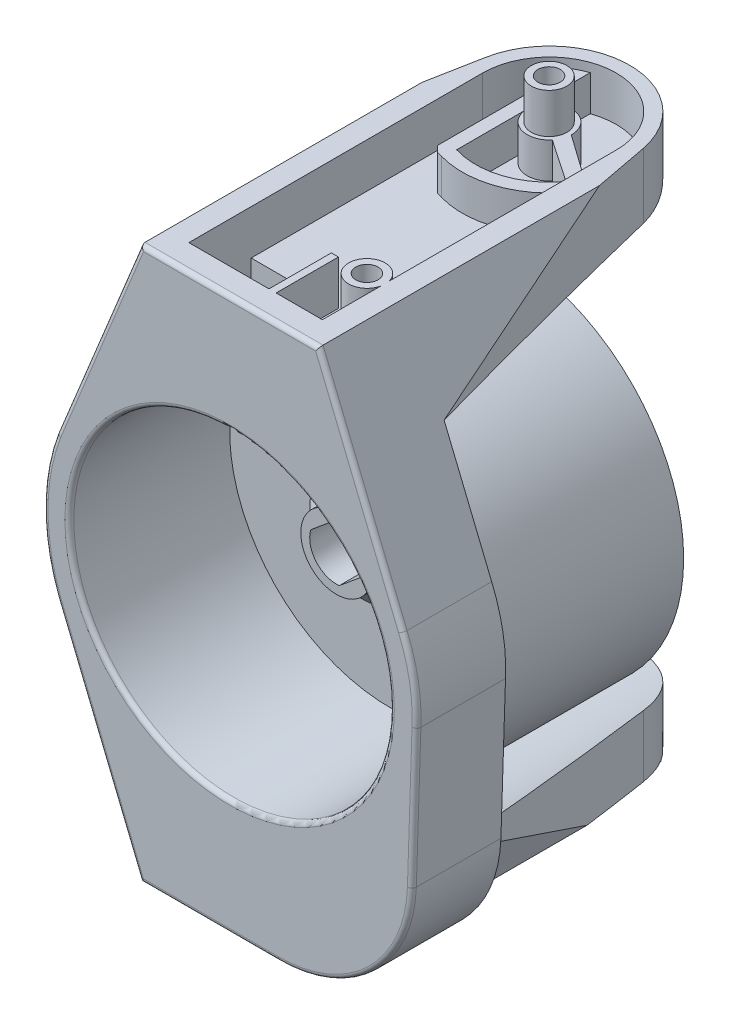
ISO-10303-21;
HEADER;
FILE_DESCRIPTION(('STEP AP214'),'2;1');
FILE_NAME('part.step','',(''),(''),'','','');
FILE_SCHEMA(('AUTOMOTIVE_DESIGN { 1 0 10303 214 1 1 1 1 }'));
ENDSEC;
DATA;
#1=APPLICATION_CONTEXT('core data for automotive mechanical design processes');
#2=APPLICATION_PROTOCOL_DEFINITION('international standard','automotive_design',2000,#1);
#3=PRODUCT_CONTEXT('',#1,'mechanical');
#4=PRODUCT('Part','Part','',(#3));
#5=PRODUCT_RELATED_PRODUCT_CATEGORY('part','',(#4));
#6=PRODUCT_DEFINITION_FORMATION('','',#4);
#7=PRODUCT_DEFINITION_CONTEXT('part definition',#1,'design');
#8=PRODUCT_DEFINITION('design','',#6,#7);
#9=PRODUCT_DEFINITION_SHAPE('','',#8);
#10=(LENGTH_UNIT() NAMED_UNIT(*) SI_UNIT(.MILLI.,.METRE.));
#11=(NAMED_UNIT(*) PLANE_ANGLE_UNIT() SI_UNIT($,.RADIAN.));
#12=(NAMED_UNIT(*) SI_UNIT($,.STERADIAN.) SOLID_ANGLE_UNIT());
#13=UNCERTAINTY_MEASURE_WITH_UNIT(LENGTH_MEASURE(1.E-05),#10,'distance_accuracy_value','');
#14=(GEOMETRIC_REPRESENTATION_CONTEXT(3) GLOBAL_UNCERTAINTY_ASSIGNED_CONTEXT((#13)) GLOBAL_UNIT_ASSIGNED_CONTEXT((#10,
#11,#12)) REPRESENTATION_CONTEXT('',''));
#15=CARTESIAN_POINT('',(0.,0.,0.));
#16=DIRECTION('',(0.,0.,1.));
#17=DIRECTION('',(1.,0.,0.));
#18=AXIS2_PLACEMENT_3D('',#15,#16,#17);
#19=CARTESIAN_POINT('',(0.,0.,-14.));
#20=DIRECTION('',(0.,0.,1.));
#21=DIRECTION('',(1.,0.,0.));
#22=AXIS2_PLACEMENT_3D('',#19,#20,#21);
#23=PLANE('',#22);
#24=DIRECTION('',(0.,-1.,0.));
#25=VECTOR('',#24,1.);
#26=CARTESIAN_POINT('',(0.,17.,-14.));
#27=LINE('',#26,#25);
#28=CARTESIAN_POINT('',(0.,17.,-14.));
#29=VERTEX_POINT('',#28);
#30=CARTESIAN_POINT('',(0.,10.,-14.));
#31=VERTEX_POINT('',#30);
#32=EDGE_CURVE('E629',#29,#31,#27,.T.);
#33=ORIENTED_EDGE('',*,*,#32,.F.);
#34=CARTESIAN_POINT('',(0.,0.,-14.));
#35=DIRECTION('',(0.,0.,-1.));
#36=DIRECTION('',(1.,0.,0.));
#37=AXIS2_PLACEMENT_3D('',#34,#35,#36);
#38=CIRCLE('',#37,17.);
#39=CARTESIAN_POINT('',(12.0208152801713,12.0208152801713,-14.));
#40=VERTEX_POINT('',#39);
#41=EDGE_CURVE('E666',#29,#40,#38,.T.);
#42=ORIENTED_EDGE('',*,*,#41,.T.);
#43=DIRECTION('',(-0.678751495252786,-0.734368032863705,0.));
#44=VECTOR('',#43,1.);
#45=CARTESIAN_POINT('',(12.0208152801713,12.0208152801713,-14.));
#46=LINE('',#45,#44);
#47=CARTESIAN_POINT('',(9.9826460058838,9.81563949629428,-14.));
#48=VERTEX_POINT('',#47);
#49=EDGE_CURVE('E673',#40,#48,#46,.T.);
#50=ORIENTED_EDGE('',*,*,#49,.T.);
#51=CARTESIAN_POINT('',(0.,0.,-14.));
#52=DIRECTION('',(0.,0.,1.));
#53=DIRECTION('',(-1.,0.,0.));
#54=AXIS2_PLACEMENT_3D('',#51,#52,#53);
#55=CIRCLE('',#54,14.);
#56=CARTESIAN_POINT('',(3.86524210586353,13.4558501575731,-14.));
#57=VERTEX_POINT('',#56);
#58=EDGE_CURVE('E684',#48,#57,#55,.T.);
#59=ORIENTED_EDGE('',*,*,#58,.T.);
#60=DIRECTION('',(-0.340555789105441,-0.94022431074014,0.));
#61=VECTOR('',#60,1.);
#62=CARTESIAN_POINT('',(3.86524210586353,13.4558501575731,-14.));
#63=LINE('',#62,#61);
#64=CARTESIAN_POINT('',(2.49862215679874,9.68281401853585,-14.));
#65=VERTEX_POINT('',#64);
#66=EDGE_CURVE('E686',#57,#65,#63,.T.);
#67=ORIENTED_EDGE('',*,*,#66,.T.);
#68=CARTESIAN_POINT('',(0.,0.,-14.));
#69=DIRECTION('',(0.,0.,1.));
#70=DIRECTION('',(-1.,0.,0.));
#71=AXIS2_PLACEMENT_3D('',#68,#69,#70);
#72=CIRCLE('',#71,10.);
#73=EDGE_CURVE('E678',#65,#31,#72,.T.);
#74=ORIENTED_EDGE('',*,*,#73,.T.);
#75=EDGE_LOOP('',(#33,#42,#50,#59,#67,#74));
#76=FACE_BOUND('',#75,.T.);
#77=ADVANCED_FACE('F32',(#76),#23,.F.);
#78=DIRECTION('',(-0.885871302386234,0.463931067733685,0.));
#79=VECTOR('',#78,1.);
#80=CARTESIAN_POINT('',(-8.75831441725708,4.82617121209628,-14.));
#81=LINE('',#80,#79);
#82=CARTESIAN_POINT('',(-8.75831441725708,4.82617121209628,-14.));
#83=VERTEX_POINT('',#82);
#84=CARTESIAN_POINT('',(-14.96023429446,8.07411851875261,-14.));
#85=VERTEX_POINT('',#84);
#86=EDGE_CURVE('E57',#83,#85,#81,.T.);
#87=ORIENTED_EDGE('',*,*,#86,.F.);
#88=CARTESIAN_POINT('',(-9.45915695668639,-3.24412540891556,-14.));
#89=VERTEX_POINT('',#88);
#90=EDGE_CURVE('E630',#83,#89,#72,.T.);
#91=ORIENTED_EDGE('',*,*,#90,.T.);
#92=DIRECTION('',(-0.94522911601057,-0.326407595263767,0.));
#93=VECTOR('',#92,1.);
#94=CARTESIAN_POINT('',(-16.0757694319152,-5.52898156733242,-14.));
#95=LINE('',#94,#93);
#96=CARTESIAN_POINT('',(-16.0757694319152,-5.52898156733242,-14.));
#97=VERTEX_POINT('',#96);
#98=EDGE_CURVE('E689',#89,#97,#95,.T.);
#99=ORIENTED_EDGE('',*,*,#98,.T.);
#100=EDGE_CURVE('E670',#97,#85,#38,.T.);
#101=ORIENTED_EDGE('',*,*,#100,.T.);
#102=EDGE_LOOP('',(#87,#91,#99,#101));
#103=FACE_BOUND('',#102,.T.);
#104=ADVANCED_FACE('F1194',(#103),#23,.F.);
#105=CARTESIAN_POINT('',(0.,0.,-11.));
#106=DIRECTION('',(0.,0.,-1.));
#107=DIRECTION('',(-1.,0.,0.));
#108=AXIS2_PLACEMENT_3D('',#105,#106,#107);
#109=PLANE('',#108);
#110=CARTESIAN_POINT('',(0.,0.,-11.));
#111=DIRECTION('',(0.,0.,-1.));
#112=DIRECTION('',(-1.,0.,0.));
#113=AXIS2_PLACEMENT_3D('',#110,#111,#112);
#114=CIRCLE('',#113,19.);
#115=CARTESIAN_POINT('',(-19.,0.,-11.));
#116=VERTEX_POINT('',#115);
#117=EDGE_CURVE('E1395',#116,#116,#114,.T.);
#118=ORIENTED_EDGE('',*,*,#117,.T.);
#119=EDGE_LOOP('',(#118));
#120=FACE_BOUND('',#119,.T.);
#121=CARTESIAN_POINT('',(-0.0330341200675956,-0.0274068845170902,-11.));
#122=DIRECTION('',(0.,0.,-1.));
#123=DIRECTION('',(-1.,0.,0.));
#124=AXIS2_PLACEMENT_3D('',#121,#122,#123);
#125=CIRCLE('',#124,3.02393818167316);
#126=CARTESIAN_POINT('',(-0.32002181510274,2.98288216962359,-11.));
#127=VERTEX_POINT('',#126);
#128=CARTESIAN_POINT('',(2.87253652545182,-0.865178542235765,-11.));
#129=VERTEX_POINT('',#128);
#130=EDGE_CURVE('E1431',#127,#129,#125,.T.);
#131=ORIENTED_EDGE('',*,*,#130,.F.);
#132=DIRECTION('',(0.769612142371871,0.638511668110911,0.));
#133=VECTOR('',#132,1.);
#134=CARTESIAN_POINT('',(-0.32002181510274,2.98288216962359,-11.));
#135=LINE('',#134,#133);
#136=CARTESIAN_POINT('',(-2.87253652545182,0.865178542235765,-11.));
#137=VERTEX_POINT('',#136);
#138=EDGE_CURVE('E1418',#137,#127,#135,.T.);
#139=ORIENTED_EDGE('',*,*,#138,.F.);
#140=CARTESIAN_POINT('',(-0.010311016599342,-0.0085545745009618,-11.));
#141=DIRECTION('',(0.,0.,-1.));
#142=DIRECTION('',(1.,0.,0.));
#143=AXIS2_PLACEMENT_3D('',#140,#141,#142);
#144=CIRCLE('',#143,2.99261498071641);
#145=CARTESIAN_POINT('',(0.320021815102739,-2.98288216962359,-11.));
#146=VERTEX_POINT('',#145);
#147=EDGE_CURVE('E1425',#146,#137,#144,.T.);
#148=ORIENTED_EDGE('',*,*,#147,.F.);
#149=DIRECTION('',(-0.769612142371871,-0.638511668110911,0.));
#150=VECTOR('',#149,1.);
#151=CARTESIAN_POINT('',(2.87253652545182,-0.865178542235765,-11.));
#152=LINE('',#151,#150);
#153=EDGE_CURVE('E1428',#129,#146,#152,.T.);
#154=ORIENTED_EDGE('',*,*,#153,.F.);
#155=EDGE_LOOP('',(#131,#139,#148,#154));
#156=FACE_BOUND('',#155,.T.);
#157=DIRECTION('',(-0.678751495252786,-0.734368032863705,0.));
#158=VECTOR('',#157,1.);
#159=CARTESIAN_POINT('',(12.0208152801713,12.0208152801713,-11.));
#160=LINE('',#159,#158);
#161=CARTESIAN_POINT('',(12.0208152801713,12.0208152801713,-11.));
#162=VERTEX_POINT('',#161);
#163=CARTESIAN_POINT('',(9.9826460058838,9.81563949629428,-11.));
#164=VERTEX_POINT('',#163);
#165=EDGE_CURVE('E2889',#162,#164,#160,.T.);
#166=ORIENTED_EDGE('',*,*,#165,.F.);
#167=CARTESIAN_POINT('',(0.,0.,-11.));
#168=DIRECTION('',(0.,0.,-1.));
#169=DIRECTION('',(1.,0.,0.));
#170=AXIS2_PLACEMENT_3D('',#167,#168,#169);
#171=CIRCLE('',#170,17.);
#172=CARTESIAN_POINT('',(-16.0757694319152,-5.52898156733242,-11.));
#173=VERTEX_POINT('',#172);
#174=EDGE_CURVE('E642',#173,#162,#171,.T.);
#175=ORIENTED_EDGE('',*,*,#174,.F.);
#176=DIRECTION('',(-0.94522911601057,-0.326407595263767,0.));
#177=VECTOR('',#176,1.);
#178=CARTESIAN_POINT('',(-16.0757694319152,-5.52898156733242,-11.));
#179=LINE('',#178,#177);
#180=CARTESIAN_POINT('',(-9.45915695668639,-3.24412540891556,-11.));
#181=VERTEX_POINT('',#180);
#182=EDGE_CURVE('E671',#181,#173,#179,.T.);
#183=ORIENTED_EDGE('',*,*,#182,.F.);
#184=CARTESIAN_POINT('',(0.,0.,-11.));
#185=DIRECTION('',(0.,0.,1.));
#186=DIRECTION('',(-1.,0.,0.));
#187=AXIS2_PLACEMENT_3D('',#184,#185,#186);
#188=CIRCLE('',#187,10.);
#189=CARTESIAN_POINT('',(2.49862215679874,9.68281401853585,-11.));
#190=VERTEX_POINT('',#189);
#191=EDGE_CURVE('E675',#190,#181,#188,.T.);
#192=ORIENTED_EDGE('',*,*,#191,.F.);
#193=DIRECTION('',(-0.340555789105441,-0.94022431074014,0.));
#194=VECTOR('',#193,1.);
#195=CARTESIAN_POINT('',(3.86524210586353,13.4558501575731,-11.));
#196=LINE('',#195,#194);
#197=CARTESIAN_POINT('',(3.86524210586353,13.4558501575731,-11.));
#198=VERTEX_POINT('',#197);
#199=EDGE_CURVE('E2895',#198,#190,#196,.T.);
#200=ORIENTED_EDGE('',*,*,#199,.F.);
#201=CARTESIAN_POINT('',(0.,0.,-11.));
#202=DIRECTION('',(0.,0.,1.));
#203=DIRECTION('',(-1.,0.,0.));
#204=AXIS2_PLACEMENT_3D('',#201,#202,#203);
#205=CIRCLE('',#204,14.);
#206=EDGE_CURVE('E2892',#164,#198,#205,.T.);
#207=ORIENTED_EDGE('',*,*,#206,.F.);
#208=EDGE_LOOP('',(#166,#175,#183,#192,#200,#207));
#209=FACE_BOUND('',#208,.T.);
#210=ADVANCED_FACE('F1191',(#120,#156,#209),#109,.T.);
#211=CARTESIAN_POINT('',(-0.00785964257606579,26.,-25.9318775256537));
#212=DIRECTION('',(0.,1.,0.));
#213=DIRECTION('',(-1.,0.,0.));
#214=AXIS2_PLACEMENT_3D('',#211,#212,#213);
#215=PLANE('',#214);
#216=DIRECTION('',(-1.,0.,0.));
#217=VECTOR('',#216,1.);
#218=CARTESIAN_POINT('',(2.29214035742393,26.,0.0681224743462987));
#219=LINE('',#218,#217);
#220=CARTESIAN_POINT('',(2.29214035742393,26.,0.0681224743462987));
#221=VERTEX_POINT('',#220);
#222=CARTESIAN_POINT('',(1.49214035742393,26.,0.0681224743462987));
#223=VERTEX_POINT('',#222);
#224=EDGE_CURVE('E710',#221,#223,#219,.T.);
#225=ORIENTED_EDGE('',*,*,#224,.F.);
#226=DIRECTION('',(0.,0.,-1.));
#227=VECTOR('',#226,1.);
#228=CARTESIAN_POINT('',(2.29214035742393,26.,7.0681224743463));
#229=LINE('',#228,#227);
#230=CARTESIAN_POINT('',(2.29214035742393,26.,7.0681224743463));
#231=VERTEX_POINT('',#230);
#232=EDGE_CURVE('E707',#231,#221,#229,.T.);
#233=ORIENTED_EDGE('',*,*,#232,.F.);
#234=DIRECTION('',(1.,0.,0.));
#235=VECTOR('',#234,1.);
#236=CARTESIAN_POINT('',(-7.50785964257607,26.,7.0681224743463));
#237=LINE('',#236,#235);
#238=CARTESIAN_POINT('',(7.49214035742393,26.,7.0681224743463));
#239=VERTEX_POINT('',#238);
#240=EDGE_CURVE('E1452',#231,#239,#237,.T.);
#241=ORIENTED_EDGE('',*,*,#240,.T.);
#242=DIRECTION('',(0.,0.,-1.));
#243=VECTOR('',#242,1.);
#244=CARTESIAN_POINT('',(7.49214035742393,26.,-25.9318775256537));
#245=LINE('',#244,#243);
#246=CARTESIAN_POINT('',(7.49214035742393,26.,0.518122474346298));
#247=VERTEX_POINT('',#246);
#248=EDGE_CURVE('E1438',#239,#247,#245,.T.);
#249=ORIENTED_EDGE('',*,*,#248,.T.);
#250=CARTESIAN_POINT('',(5.49214035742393,26.,0.0681224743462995));
#251=DIRECTION('',(0.,1.,0.));
#252=DIRECTION('',(-1.,0.,0.));
#253=AXIS2_PLACEMENT_3D('',#250,#251,#252);
#254=CIRCLE('',#253,2.05);
#255=CARTESIAN_POINT('',(7.49214035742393,26.,-0.381877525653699));
#256=VERTEX_POINT('',#255);
#257=EDGE_CURVE('E738',#256,#247,#254,.T.);
#258=ORIENTED_EDGE('',*,*,#257,.F.);
#259=CARTESIAN_POINT('',(7.49214035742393,26.,-19.6351866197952));
#260=VERTEX_POINT('',#259);
#261=EDGE_CURVE('E1447',#256,#260,#245,.T.);
#262=ORIENTED_EDGE('',*,*,#261,.T.);
#263=CARTESIAN_POINT('',(-0.00785964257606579,26.,-25.9318775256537));
#264=DIRECTION('',(0.,1.,0.));
#265=DIRECTION('',(-1.,0.,0.));
#266=AXIS2_PLACEMENT_3D('',#263,#264,#265);
#267=CIRCLE('',#266,9.79276857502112);
#268=CARTESIAN_POINT('',(-2.72617147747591,26.,-16.5239501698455));
#269=VERTEX_POINT('',#268);
#270=EDGE_CURVE('E776',#269,#260,#267,.T.);
#271=ORIENTED_EDGE('',*,*,#270,.F.);
#272=DIRECTION('',(0.965552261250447,0.,0.260209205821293));
#273=VECTOR('',#272,1.);
#274=CARTESIAN_POINT('',(-3.99785964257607,26.,-16.8666607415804));
#275=LINE('',#274,#273);
#276=CARTESIAN_POINT('',(-3.31340386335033,26.,-16.6822049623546));
#277=VERTEX_POINT('',#276);
#278=EDGE_CURVE('E774',#277,#269,#275,.T.);
#279=ORIENTED_EDGE('',*,*,#278,.F.);
#280=DIRECTION('',(0.707106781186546,0.,0.707106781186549));
#281=VECTOR('',#280,1.);
#282=CARTESIAN_POINT('',(-3.31340386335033,26.,-16.6822049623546));
#283=LINE('',#282,#281);
#284=CARTESIAN_POINT('',(-3.99785964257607,26.,-17.3666607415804));
#285=VERTEX_POINT('',#284);
#286=EDGE_CURVE('E1572',#277,#285,#283,.F.);
#287=ORIENTED_EDGE('',*,*,#286,.T.);
#288=DIRECTION('',(0.,0.,1.));
#289=VECTOR('',#288,1.);
#290=CARTESIAN_POINT('',(-3.99785964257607,26.,-20.309626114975));
#291=LINE('',#290,#289);
#292=CARTESIAN_POINT('',(-3.99785964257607,26.,-32.2824601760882));
#293=VERTEX_POINT('',#292);
#294=EDGE_CURVE('E771',#293,#285,#291,.T.);
#295=ORIENTED_EDGE('',*,*,#294,.F.);
#296=CARTESIAN_POINT('',(-0.00785964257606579,26.,-25.9318775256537));
#297=DIRECTION('',(0.,1.,0.));
#298=DIRECTION('',(-1.,0.,0.));
#299=AXIS2_PLACEMENT_3D('',#296,#297,#298);
#300=CIRCLE('',#299,7.5);
#301=CARTESIAN_POINT('',(-7.50785964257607,26.,-25.9318775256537));
#302=VERTEX_POINT('',#301);
#303=EDGE_CURVE('E1459',#293,#302,#300,.T.);
#304=ORIENTED_EDGE('',*,*,#303,.T.);
#305=DIRECTION('',(0.,0.,1.));
#306=VECTOR('',#305,1.);
#307=CARTESIAN_POINT('',(-7.50785964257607,26.,-25.9318775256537));
#308=LINE('',#307,#306);
#309=CARTESIAN_POINT('',(-7.50785964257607,26.,0.0681224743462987));
#310=VERTEX_POINT('',#309);
#311=EDGE_CURVE('E1453',#302,#310,#308,.T.);
#312=ORIENTED_EDGE('',*,*,#311,.T.);
#313=DIRECTION('',(-1.,0.,0.));
#314=VECTOR('',#313,1.);
#315=CARTESIAN_POINT('',(-7.50785964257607,26.,0.0681224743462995));
#316=LINE('',#315,#314);
#317=CARTESIAN_POINT('',(-0.507859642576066,26.,0.0681224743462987));
#318=VERTEX_POINT('',#317);
#319=EDGE_CURVE('E753',#318,#310,#316,.T.);
#320=ORIENTED_EDGE('',*,*,#319,.F.);
#321=DIRECTION('',(0.,0.,-1.));
#322=VECTOR('',#321,1.);
#323=CARTESIAN_POINT('',(-0.507859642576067,26.,7.0681224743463));
#324=LINE('',#323,#322);
#325=CARTESIAN_POINT('',(-0.507859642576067,26.,7.0681224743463));
#326=VERTEX_POINT('',#325);
#327=EDGE_CURVE('E750',#326,#318,#324,.T.);
#328=ORIENTED_EDGE('',*,*,#327,.F.);
#329=CARTESIAN_POINT('',(1.49214035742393,26.,7.0681224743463));
#330=VERTEX_POINT('',#329);
#331=EDGE_CURVE('E1449',#326,#330,#237,.T.);
#332=ORIENTED_EDGE('',*,*,#331,.T.);
#333=DIRECTION('',(0.,0.,1.));
#334=VECTOR('',#333,1.);
#335=CARTESIAN_POINT('',(1.49214035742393,26.,7.0681224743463));
#336=LINE('',#335,#334);
#337=EDGE_CURVE('E713',#223,#330,#336,.T.);
#338=ORIENTED_EDGE('',*,*,#337,.F.);
#339=EDGE_LOOP('',(#225,#233,#241,#249,#258,#262,#271,#279,#287,#295,#304,#312,#320,#328,#332,#338));
#340=FACE_BOUND('',#339,.T.);
#341=ADVANCED_FACE('F1129',(#340),#215,.T.);
#342=CARTESIAN_POINT('',(-7.50785964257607,26.,7.0681224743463));
#343=DIRECTION('',(0.,0.,1.));
#344=DIRECTION('',(1.,0.,0.));
#345=AXIS2_PLACEMENT_3D('',#342,#343,#344);
#346=PLANE('',#345);
#347=DIRECTION('',(0.,-1.,0.));
#348=VECTOR('',#347,1.);
#349=CARTESIAN_POINT('',(2.29214035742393,31.,7.0681224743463));
#350=LINE('',#349,#348);
#351=CARTESIAN_POINT('',(2.29214035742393,31.,7.0681224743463));
#352=VERTEX_POINT('',#351);
#353=EDGE_CURVE('E724',#352,#231,#350,.T.);
#354=ORIENTED_EDGE('',*,*,#353,.F.);
#355=DIRECTION('',(1.,0.,0.));
#356=VECTOR('',#355,1.);
#357=CARTESIAN_POINT('',(-7.50785964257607,31.,7.0681224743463));
#358=LINE('',#357,#356);
#359=CARTESIAN_POINT('',(7.49214035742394,31.,7.0681224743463));
#360=VERTEX_POINT('',#359);
#361=EDGE_CURVE('E1465',#352,#360,#358,.T.);
#362=ORIENTED_EDGE('',*,*,#361,.T.);
#363=DIRECTION('',(0.,1.,0.));
#364=VECTOR('',#363,1.);
#365=CARTESIAN_POINT('',(7.49214035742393,26.,7.0681224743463));
#366=LINE('',#365,#364);
#367=EDGE_CURVE('E1440',#239,#360,#366,.T.);
#368=ORIENTED_EDGE('',*,*,#367,.F.);
#369=ORIENTED_EDGE('',*,*,#240,.F.);
#370=EDGE_LOOP('',(#354,#362,#368,#369));
#371=FACE_BOUND('',#370,.T.);
#372=ADVANCED_FACE('F1137',(#371),#346,.F.);
#373=DIRECTION('',(0.,-1.,0.));
#374=VECTOR('',#373,1.);
#375=CARTESIAN_POINT('',(1.49214035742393,31.,7.0681224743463));
#376=LINE('',#375,#374);
#377=CARTESIAN_POINT('',(1.49214035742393,31.,7.0681224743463));
#378=VERTEX_POINT('',#377);
#379=EDGE_CURVE('E727',#378,#330,#376,.T.);
#380=ORIENTED_EDGE('',*,*,#379,.T.);
#381=ORIENTED_EDGE('',*,*,#331,.F.);
#382=DIRECTION('',(0.,1.,0.));
#383=VECTOR('',#382,1.);
#384=CARTESIAN_POINT('',(-0.50785964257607,8.99999999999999,7.0681224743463));
#385=LINE('',#384,#383);
#386=CARTESIAN_POINT('',(-0.507859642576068,17.9928340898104,7.0681224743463));
#387=VERTEX_POINT('',#386);
#388=EDGE_CURVE('E755',#387,#326,#385,.T.);
#389=ORIENTED_EDGE('',*,*,#388,.F.);
#390=CARTESIAN_POINT('',(0.,0.,7.0681224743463));
#391=DIRECTION('',(0.,0.,1.));
#392=DIRECTION('',(1.,0.,0.));
#393=AXIS2_PLACEMENT_3D('',#390,#391,#392);
#394=CIRCLE('',#393,18.);
#395=CARTESIAN_POINT('',(-7.50785964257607,16.3594634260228,7.0681224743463));
#396=VERTEX_POINT('',#395);
#397=EDGE_CURVE('E1574',#396,#387,#394,.F.);
#398=ORIENTED_EDGE('',*,*,#397,.F.);
#399=DIRECTION('',(0.,1.,0.));
#400=VECTOR('',#399,1.);
#401=CARTESIAN_POINT('',(-7.50785964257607,26.,7.0681224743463));
#402=LINE('',#401,#400);
#403=CARTESIAN_POINT('',(-7.50785964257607,31.,7.0681224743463));
#404=VERTEX_POINT('',#403);
#405=EDGE_CURVE('E1437',#396,#404,#402,.T.);
#406=ORIENTED_EDGE('',*,*,#405,.T.);
#407=EDGE_CURVE('E1463',#404,#378,#358,.T.);
#408=ORIENTED_EDGE('',*,*,#407,.T.);
#409=EDGE_LOOP('',(#380,#381,#389,#398,#406,#408));
#410=FACE_BOUND('',#409,.T.);
#411=ADVANCED_FACE('F1135',(#410),#346,.F.);
#412=CARTESIAN_POINT('',(7.49214035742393,26.,-25.9318775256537));
#413=DIRECTION('',(1.,0.,0.));
#414=DIRECTION('',(0.,1.,0.));
#415=AXIS2_PLACEMENT_3D('',#412,#413,#414);
#416=PLANE('',#415);
#417=DIRECTION('',(0.,-1.,0.));
#418=VECTOR('',#417,1.);
#419=CARTESIAN_POINT('',(7.49214035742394,31.,0.518122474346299));
#420=LINE('',#419,#418);
#421=CARTESIAN_POINT('',(7.49214035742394,31.,0.518122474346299));
#422=VERTEX_POINT('',#421);
#423=EDGE_CURVE('E747',#247,#422,#420,.F.);
#424=ORIENTED_EDGE('',*,*,#423,.F.);
#425=ORIENTED_EDGE('',*,*,#248,.F.);
#426=ORIENTED_EDGE('',*,*,#367,.T.);
#427=DIRECTION('',(0.,0.,-1.));
#428=VECTOR('',#427,1.);
#429=CARTESIAN_POINT('',(7.49214035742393,31.,-25.9318775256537));
#430=LINE('',#429,#428);
#431=EDGE_CURVE('E1460',#360,#422,#430,.T.);
#432=ORIENTED_EDGE('',*,*,#431,.T.);
#433=EDGE_LOOP('',(#424,#425,#426,#432));
#434=FACE_BOUND('',#433,.T.);
#435=ADVANCED_FACE('F1131',(#434),#416,.F.);
#436=DIRECTION('',(0.,-1.,0.));
#437=VECTOR('',#436,1.);
#438=CARTESIAN_POINT('',(7.49214035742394,31.,-0.3818775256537));
#439=LINE('',#438,#437);
#440=CARTESIAN_POINT('',(7.49214035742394,31.,-0.3818775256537));
#441=VERTEX_POINT('',#440);
#442=EDGE_CURVE('E744',#441,#256,#439,.T.);
#443=ORIENTED_EDGE('',*,*,#442,.F.);
#444=CARTESIAN_POINT('',(7.49214035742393,31.,-25.9318775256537));
#445=VERTEX_POINT('',#444);
#446=EDGE_CURVE('E1462',#441,#445,#430,.T.);
#447=ORIENTED_EDGE('',*,*,#446,.T.);
#448=DIRECTION('',(0.,1.,0.));
#449=VECTOR('',#448,1.);
#450=CARTESIAN_POINT('',(7.49214035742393,26.,-25.9318775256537));
#451=LINE('',#450,#449);
#452=CARTESIAN_POINT('',(7.49214035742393,26.,-25.9318775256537));
#453=VERTEX_POINT('',#452);
#454=EDGE_CURVE('E1433',#453,#445,#451,.T.);
#455=ORIENTED_EDGE('',*,*,#454,.F.);
#456=CARTESIAN_POINT('',(7.49214035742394,26.,-22.3446828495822));
#457=VERTEX_POINT('',#456);
#458=EDGE_CURVE('E1448',#457,#453,#245,.T.);
#459=ORIENTED_EDGE('',*,*,#458,.F.);
#460=DIRECTION('',(0.,-1.,0.));
#461=VECTOR('',#460,1.);
#462=CARTESIAN_POINT('',(7.49214035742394,30.,-22.3446828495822));
#463=LINE('',#462,#461);
#464=CARTESIAN_POINT('',(7.49214035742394,30.,-22.3446828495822));
#465=VERTEX_POINT('',#464);
#466=EDGE_CURVE('E817',#465,#457,#463,.T.);
#467=ORIENTED_EDGE('',*,*,#466,.F.);
#468=DIRECTION('',(0.,0.,1.));
#469=VECTOR('',#468,1.);
#470=CARTESIAN_POINT('',(7.49214035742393,30.,-25.9318775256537));
#471=LINE('',#470,#469);
#472=CARTESIAN_POINT('',(7.49214035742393,30.,-19.6351866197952));
#473=VERTEX_POINT('',#472);
#474=EDGE_CURVE('E836',#465,#473,#471,.T.);
#475=ORIENTED_EDGE('',*,*,#474,.T.);
#476=DIRECTION('',(0.,-1.,0.));
#477=VECTOR('',#476,1.);
#478=CARTESIAN_POINT('',(7.49214035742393,30.,-19.6351866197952));
#479=LINE('',#478,#477);
#480=EDGE_CURVE('E819',#473,#260,#479,.T.);
#481=ORIENTED_EDGE('',*,*,#480,.T.);
#482=ORIENTED_EDGE('',*,*,#261,.F.);
#483=EDGE_LOOP('',(#443,#447,#455,#459,#467,#475,#481,#482));
#484=FACE_BOUND('',#483,.T.);
#485=ADVANCED_FACE('F1134',(#484),#416,.F.);
#486=CARTESIAN_POINT('',(-0.00785964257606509,30.,-25.9318775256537));
#487=DIRECTION('',(0.,1.,0.));
#488=DIRECTION('',(-1.,0.,0.));
#489=AXIS2_PLACEMENT_3D('',#486,#487,#488);
#490=PLANE('',#489);
#491=DIRECTION('',(0.,0.,1.));
#492=VECTOR('',#491,1.);
#493=CARTESIAN_POINT('',(-3.99785964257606,30.,-32.2824601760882));
#494=LINE('',#493,#492);
#495=CARTESIAN_POINT('',(-3.99785964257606,30.,-32.2824601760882));
#496=VERTEX_POINT('',#495);
#497=CARTESIAN_POINT('',(-3.99785964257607,30.,-17.3666607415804));
#498=VERTEX_POINT('',#497);
#499=EDGE_CURVE('E791',#496,#498,#494,.T.);
#500=ORIENTED_EDGE('',*,*,#499,.T.);
#501=DIRECTION('',(-0.707106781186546,0.,-0.707106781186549));
#502=VECTOR('',#501,1.);
#503=CARTESIAN_POINT('',(-6.28546803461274,30.,-19.6542691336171));
#504=LINE('',#503,#502);
#505=CARTESIAN_POINT('',(-3.31340386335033,30.,-16.6822049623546));
#506=VERTEX_POINT('',#505);
#507=EDGE_CURVE('E1570',#498,#506,#504,.F.);
#508=ORIENTED_EDGE('',*,*,#507,.T.);
#509=DIRECTION('',(0.965552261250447,0.,0.260209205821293));
#510=VECTOR('',#509,1.);
#511=CARTESIAN_POINT('',(-3.99785964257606,30.,-16.8666607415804));
#512=LINE('',#511,#510);
#513=CARTESIAN_POINT('',(-2.72617147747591,30.,-16.5239501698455));
#514=VERTEX_POINT('',#513);
#515=EDGE_CURVE('E794',#506,#514,#512,.T.);
#516=ORIENTED_EDGE('',*,*,#515,.T.);
#517=CARTESIAN_POINT('',(-0.00785964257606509,30.,-25.9318775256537));
#518=DIRECTION('',(0.,1.,0.));
#519=DIRECTION('',(-1.,0.,0.));
#520=AXIS2_PLACEMENT_3D('',#517,#518,#519);
#521=CIRCLE('',#520,9.79276857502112);
#522=EDGE_CURVE('E796',#514,#473,#521,.T.);
#523=ORIENTED_EDGE('',*,*,#522,.T.);
#524=ORIENTED_EDGE('',*,*,#474,.F.);
#525=DIRECTION('',(-0.816135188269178,0.,-0.577861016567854));
#526=VECTOR('',#525,1.);
#527=CARTESIAN_POINT('',(7.49214035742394,30.,-22.3446828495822));
#528=LINE('',#527,#526);
#529=CARTESIAN_POINT('',(2.49170492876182,30.,-25.8852196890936));
#530=VERTEX_POINT('',#529);
#531=EDGE_CURVE('E798',#465,#530,#528,.T.);
#532=ORIENTED_EDGE('',*,*,#531,.T.);
#533=CARTESIAN_POINT('',(-0.00785964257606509,30.,-25.9318775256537));
#534=DIRECTION('',(0.,1.,0.));
#535=DIRECTION('',(-1.,0.,0.));
#536=AXIS2_PLACEMENT_3D('',#533,#534,#535);
#537=CIRCLE('',#536,2.5);
#538=CARTESIAN_POINT('',(-2.49785964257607,30.,-26.1552606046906));
#539=VERTEX_POINT('',#538);
#540=EDGE_CURVE('E843',#530,#539,#537,.T.);
#541=ORIENTED_EDGE('',*,*,#540,.T.);
#542=DIRECTION('',(0.,0.,-1.));
#543=VECTOR('',#542,1.);
#544=CARTESIAN_POINT('',(-2.49785964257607,30.,-33.0064729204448));
#545=LINE('',#544,#543);
#546=CARTESIAN_POINT('',(-2.49785964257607,30.,-33.0064729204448));
#547=VERTEX_POINT('',#546);
#548=EDGE_CURVE('E805',#539,#547,#545,.T.);
#549=ORIENTED_EDGE('',*,*,#548,.T.);
#550=CARTESIAN_POINT('',(-0.00785964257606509,30.,-25.9318775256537));
#551=DIRECTION('',(0.,1.,0.));
#552=DIRECTION('',(-1.,0.,0.));
#553=AXIS2_PLACEMENT_3D('',#550,#551,#552);
#554=CIRCLE('',#553,7.5);
#555=EDGE_CURVE('E788',#547,#496,#554,.T.);
#556=ORIENTED_EDGE('',*,*,#555,.T.);
#557=EDGE_LOOP('',(#500,#508,#516,#523,#524,#532,#541,#549,#556));
#558=FACE_BOUND('',#557,.T.);
#559=CARTESIAN_POINT('',(-2.49785964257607,30.,-25.7084944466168));
#560=VERTEX_POINT('',#559);
#561=CARTESIAN_POINT('',(1.91376882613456,30.,-24.3327077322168));
#562=VERTEX_POINT('',#561);
#563=EDGE_CURVE('E844',#560,#562,#537,.T.);
#564=ORIENTED_EDGE('',*,*,#563,.T.);
#565=DIRECTION('',(0.826463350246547,0.,0.562990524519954));
#566=VECTOR('',#565,1.);
#567=CARTESIAN_POINT('',(6.72000020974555,30.,-21.058681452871));
#568=LINE('',#567,#566);
#569=CARTESIAN_POINT('',(6.72000020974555,30.,-21.058681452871));
#570=VERTEX_POINT('',#569);
#571=EDGE_CURVE('E801',#562,#570,#568,.T.);
#572=ORIENTED_EDGE('',*,*,#571,.T.);
#573=CARTESIAN_POINT('',(-0.00785964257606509,30.,-25.9318775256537));
#574=DIRECTION('',(0.,-1.,0.));
#575=DIRECTION('',(-1.,0.,0.));
#576=AXIS2_PLACEMENT_3D('',#573,#574,#575);
#577=CIRCLE('',#576,8.30735446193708);
#578=CARTESIAN_POINT('',(-2.49785964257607,30.,-18.0064729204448));
#579=VERTEX_POINT('',#578);
#580=EDGE_CURVE('E803',#570,#579,#577,.T.);
#581=ORIENTED_EDGE('',*,*,#580,.T.);
#582=EDGE_CURVE('E806',#579,#560,#545,.T.);
#583=ORIENTED_EDGE('',*,*,#582,.T.);
#584=EDGE_LOOP('',(#564,#572,#581,#583));
#585=FACE_BOUND('',#584,.T.);
#586=CARTESIAN_POINT('',(0.,30.,-25.8852196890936));
#587=DIRECTION('',(0.,1.,0.));
#588=DIRECTION('',(-1.,0.,0.));
#589=AXIS2_PLACEMENT_3D('',#586,#587,#588);
#590=CIRCLE('',#589,2.);
#591=CARTESIAN_POINT('',(-2.,30.,-25.8852196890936));
#592=VERTEX_POINT('',#591);
#593=EDGE_CURVE('E765',#592,#592,#590,.T.);
#594=ORIENTED_EDGE('',*,*,#593,.F.);
#595=EDGE_LOOP('',(#594));
#596=FACE_BOUND('',#595,.T.);
#597=ADVANCED_FACE('F2145',(#558,#585,#596),#490,.T.);
#598=CARTESIAN_POINT('',(-0.00785964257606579,26.,-25.9318775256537));
#599=DIRECTION('',(0.,1.,0.));
#600=DIRECTION('',(-1.,0.,0.));
#601=AXIS2_PLACEMENT_3D('',#598,#599,#600);
#602=CIRCLE('',#601,2.5);
#603=CARTESIAN_POINT('',(2.49170492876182,26.,-25.8852196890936));
#604=VERTEX_POINT('',#603);
#605=CARTESIAN_POINT('',(-2.49785964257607,26.,-26.1552606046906));
#606=VERTEX_POINT('',#605);
#607=EDGE_CURVE('E839',#604,#606,#602,.T.);
#608=ORIENTED_EDGE('',*,*,#607,.F.);
#609=DIRECTION('',(-0.816135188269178,0.,-0.577861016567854));
#610=VECTOR('',#609,1.);
#611=CARTESIAN_POINT('',(7.49214035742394,26.,-22.3446828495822));
#612=LINE('',#611,#610);
#613=EDGE_CURVE('E779',#457,#604,#612,.T.);
#614=ORIENTED_EDGE('',*,*,#613,.F.);
#615=ORIENTED_EDGE('',*,*,#458,.T.);
#616=CARTESIAN_POINT('',(-2.49785964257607,26.,-33.0064729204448));
#617=VERTEX_POINT('',#616);
#618=EDGE_CURVE('E1456',#453,#617,#300,.T.);
#619=ORIENTED_EDGE('',*,*,#618,.T.);
#620=DIRECTION('',(0.,0.,-1.));
#621=VECTOR('',#620,1.);
#622=CARTESIAN_POINT('',(-2.49785964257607,26.,-33.0064729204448));
#623=LINE('',#622,#621);
#624=EDGE_CURVE('E785',#606,#617,#623,.T.);
#625=ORIENTED_EDGE('',*,*,#624,.F.);
#626=EDGE_LOOP('',(#608,#614,#615,#619,#625));
#627=FACE_BOUND('',#626,.T.);
#628=ADVANCED_FACE('F2167',(#627),#215,.T.);
#629=CARTESIAN_POINT('',(-0.00785964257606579,26.,-25.9318775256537));
#630=DIRECTION('',(0.,-1.,0.));
#631=DIRECTION('',(-1.,0.,0.));
#632=AXIS2_PLACEMENT_3D('',#629,#630,#631);
#633=CIRCLE('',#632,8.30735446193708);
#634=CARTESIAN_POINT('',(6.72000020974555,26.,-21.058681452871));
#635=VERTEX_POINT('',#634);
#636=CARTESIAN_POINT('',(-2.49785964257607,26.,-18.0064729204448));
#637=VERTEX_POINT('',#636);
#638=EDGE_CURVE('E783',#635,#637,#633,.T.);
#639=ORIENTED_EDGE('',*,*,#638,.F.);
#640=DIRECTION('',(0.826463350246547,0.,0.562990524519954));
#641=VECTOR('',#640,1.);
#642=CARTESIAN_POINT('',(6.72000020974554,26.,-21.058681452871));
#643=LINE('',#642,#641);
#644=CARTESIAN_POINT('',(1.91376882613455,26.,-24.3327077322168));
#645=VERTEX_POINT('',#644);
#646=EDGE_CURVE('E781',#645,#635,#643,.T.);
#647=ORIENTED_EDGE('',*,*,#646,.F.);
#648=CARTESIAN_POINT('',(-2.49785964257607,26.,-25.7084944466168));
#649=VERTEX_POINT('',#648);
#650=EDGE_CURVE('E840',#649,#645,#602,.T.);
#651=ORIENTED_EDGE('',*,*,#650,.F.);
#652=EDGE_CURVE('E786',#637,#649,#623,.T.);
#653=ORIENTED_EDGE('',*,*,#652,.F.);
#654=EDGE_LOOP('',(#639,#647,#651,#653));
#655=FACE_BOUND('',#654,.T.);
#656=ADVANCED_FACE('F1130',(#655),#215,.T.);
#657=CARTESIAN_POINT('',(-0.00785964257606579,26.,-25.9318775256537));
#658=DIRECTION('',(0.,1.,0.));
#659=DIRECTION('',(-1.,0.,0.));
#660=AXIS2_PLACEMENT_3D('',#657,#658,#659);
#661=CYLINDRICAL_SURFACE('',#660,7.5);
#662=DIRECTION('',(0.,-1.,0.));
#663=VECTOR('',#662,1.);
#664=CARTESIAN_POINT('',(-3.99785964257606,30.,-32.2824601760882));
#665=LINE('',#664,#663);
#666=EDGE_CURVE('E825',#496,#293,#665,.T.);
#667=ORIENTED_EDGE('',*,*,#666,.F.);
#668=ORIENTED_EDGE('',*,*,#555,.F.);
#669=DIRECTION('',(0.,-1.,0.));
#670=VECTOR('',#669,1.);
#671=CARTESIAN_POINT('',(-2.49785964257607,30.,-33.0064729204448));
#672=LINE('',#671,#670);
#673=EDGE_CURVE('E808',#547,#617,#672,.T.);
#674=ORIENTED_EDGE('',*,*,#673,.T.);
#675=ORIENTED_EDGE('',*,*,#618,.F.);
#676=ORIENTED_EDGE('',*,*,#454,.T.);
#677=CARTESIAN_POINT('',(-0.00785964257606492,31.,-25.9318775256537));
#678=DIRECTION('',(0.,1.,0.));
#679=DIRECTION('',(-1.,0.,0.));
#680=AXIS2_PLACEMENT_3D('',#677,#678,#679);
#681=CIRCLE('',#680,7.5);
#682=CARTESIAN_POINT('',(-7.50785964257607,31.,-25.9318775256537));
#683=VERTEX_POINT('',#682);
#684=EDGE_CURVE('E1469',#445,#683,#681,.T.);
#685=ORIENTED_EDGE('',*,*,#684,.T.);
#686=DIRECTION('',(0.,1.,0.));
#687=VECTOR('',#686,1.);
#688=CARTESIAN_POINT('',(-7.50785964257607,26.,-25.9318775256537));
#689=LINE('',#688,#687);
#690=EDGE_CURVE('E1434',#302,#683,#689,.T.);
#691=ORIENTED_EDGE('',*,*,#690,.F.);
#692=ORIENTED_EDGE('',*,*,#303,.F.);
#693=EDGE_LOOP('',(#667,#668,#674,#675,#676,#685,#691,#692));
#694=FACE_BOUND('',#693,.T.);
#695=ADVANCED_FACE('F1145',(#694),#661,.F.);
#696=CARTESIAN_POINT('',(-0.00785964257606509,30.,-25.9318775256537));
#697=DIRECTION('',(0.,-1.,0.));
#698=DIRECTION('',(1.,0.,0.));
#699=AXIS2_PLACEMENT_3D('',#696,#697,#698);
#700=CYLINDRICAL_SURFACE('',#699,2.5);
#701=DIRECTION('',(0.,-1.,0.));
#702=VECTOR('',#701,1.);
#703=CARTESIAN_POINT('',(2.49170492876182,30.,-25.8852196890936));
#704=LINE('',#703,#702);
#705=EDGE_CURVE('E834',#604,#530,#704,.F.);
#706=ORIENTED_EDGE('',*,*,#705,.F.);
#707=ORIENTED_EDGE('',*,*,#607,.T.);
#708=DIRECTION('',(0.,-1.,0.));
#709=VECTOR('',#708,1.);
#710=CARTESIAN_POINT('',(-2.49785964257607,30.,-26.1552606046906));
#711=LINE('',#710,#709);
#712=EDGE_CURVE('E830',#539,#606,#711,.T.);
#713=ORIENTED_EDGE('',*,*,#712,.F.);
#714=ORIENTED_EDGE('',*,*,#540,.F.);
#715=EDGE_LOOP('',(#706,#707,#713,#714));
#716=FACE_BOUND('',#715,.T.);
#717=ADVANCED_FACE('F1148',(#716),#700,.T.);
#718=DIRECTION('',(0.,-1.,0.));
#719=VECTOR('',#718,1.);
#720=CARTESIAN_POINT('',(1.91376882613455,30.,-24.3327077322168));
#721=LINE('',#720,#719);
#722=EDGE_CURVE('E832',#562,#645,#721,.T.);
#723=ORIENTED_EDGE('',*,*,#722,.F.);
#724=ORIENTED_EDGE('',*,*,#563,.F.);
#725=DIRECTION('',(0.,-1.,0.));
#726=VECTOR('',#725,1.);
#727=CARTESIAN_POINT('',(-2.49785964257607,30.,-25.7084944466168));
#728=LINE('',#727,#726);
#729=EDGE_CURVE('E827',#649,#560,#728,.F.);
#730=ORIENTED_EDGE('',*,*,#729,.F.);
#731=ORIENTED_EDGE('',*,*,#650,.T.);
#732=EDGE_LOOP('',(#723,#724,#730,#731));
#733=FACE_BOUND('',#732,.T.);
#734=ADVANCED_FACE('F2615',(#733),#700,.T.);
#735=CARTESIAN_POINT('',(-4.06960586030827,-30.,0.552194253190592));
#736=DIRECTION('',(0.,-1.,0.));
#737=DIRECTION('',(1.,0.,0.));
#738=AXIS2_PLACEMENT_3D('',#735,#736,#737);
#739=PLANE('',#738);
#740=DIRECTION('',(-1.,0.,0.));
#741=VECTOR('',#740,1.);
#742=CARTESIAN_POINT('',(7.49214035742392,-30.,3.0681224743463));
#743=LINE('',#742,#741);
#744=CARTESIAN_POINT('',(7.49214035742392,-30.,3.0681224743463));
#745=VERTEX_POINT('',#744);
#746=CARTESIAN_POINT('',(-1.56960586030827,-30.,3.0681224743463));
#747=VERTEX_POINT('',#746);
#748=EDGE_CURVE('E889',#745,#747,#743,.T.);
#749=ORIENTED_EDGE('',*,*,#748,.T.);
#750=DIRECTION('',(0.,0.,1.));
#751=VECTOR('',#750,1.);
#752=CARTESIAN_POINT('',(-1.56960586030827,-30.,3.0681224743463));
#753=LINE('',#752,#751);
#754=CARTESIAN_POINT('',(-1.56960586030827,-30.,0.552194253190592));
#755=VERTEX_POINT('',#754);
#756=EDGE_CURVE('E853',#755,#747,#753,.T.);
#757=ORIENTED_EDGE('',*,*,#756,.F.);
#758=CARTESIAN_POINT('',(-4.06960586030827,-30.,0.552194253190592));
#759=DIRECTION('',(0.,-1.,0.));
#760=DIRECTION('',(1.,0.,0.));
#761=AXIS2_PLACEMENT_3D('',#758,#759,#760);
#762=CIRCLE('',#761,2.5);
#763=CARTESIAN_POINT('',(-3.7878481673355,-30.,-1.9318775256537));
#764=VERTEX_POINT('',#763);
#765=EDGE_CURVE('E1560',#755,#764,#762,.F.);
#766=ORIENTED_EDGE('',*,*,#765,.T.);
#767=DIRECTION('',(1.,0.,0.));
#768=VECTOR('',#767,1.);
#769=CARTESIAN_POINT('',(-3.78784816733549,-30.,-1.9318775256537));
#770=LINE('',#769,#768);
#771=CARTESIAN_POINT('',(0.492140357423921,-30.,-1.9318775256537));
#772=VERTEX_POINT('',#771);
#773=EDGE_CURVE('E892',#764,#772,#770,.T.);
#774=ORIENTED_EDGE('',*,*,#773,.T.);
#775=DIRECTION('',(0.,0.,1.));
#776=VECTOR('',#775,1.);
#777=CARTESIAN_POINT('',(0.492140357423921,-30.,-1.9318775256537));
#778=LINE('',#777,#776);
#779=CARTESIAN_POINT('',(0.492140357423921,-30.,0.300889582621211));
#780=VERTEX_POINT('',#779);
#781=EDGE_CURVE('E894',#772,#780,#778,.T.);
#782=ORIENTED_EDGE('',*,*,#781,.T.);
#783=DIRECTION('',(1.,0.,0.));
#784=VECTOR('',#783,1.);
#785=CARTESIAN_POINT('',(4.49214035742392,-30.,0.300889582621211));
#786=LINE('',#785,#784);
#787=CARTESIAN_POINT('',(4.49214035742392,-30.,0.300889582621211));
#788=VERTEX_POINT('',#787);
#789=EDGE_CURVE('E896',#780,#788,#786,.T.);
#790=ORIENTED_EDGE('',*,*,#789,.T.);
#791=DIRECTION('',(0.,0.,-1.));
#792=VECTOR('',#791,1.);
#793=CARTESIAN_POINT('',(4.49214035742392,-30.,-1.9318775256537));
#794=LINE('',#793,#792);
#795=CARTESIAN_POINT('',(4.49214035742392,-30.,-1.9318775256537));
#796=VERTEX_POINT('',#795);
#797=EDGE_CURVE('E898',#788,#796,#794,.T.);
#798=ORIENTED_EDGE('',*,*,#797,.T.);
#799=DIRECTION('',(1.,0.,0.));
#800=VECTOR('',#799,1.);
#801=CARTESIAN_POINT('',(7.49214035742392,-30.,-1.9318775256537));
#802=LINE('',#801,#800);
#803=CARTESIAN_POINT('',(7.49214035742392,-30.,-1.9318775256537));
#804=VERTEX_POINT('',#803);
#805=EDGE_CURVE('E900',#796,#804,#802,.T.);
#806=ORIENTED_EDGE('',*,*,#805,.T.);
#807=DIRECTION('',(0.,0.,1.));
#808=VECTOR('',#807,1.);
#809=CARTESIAN_POINT('',(7.49214035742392,-30.,3.0681224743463));
#810=LINE('',#809,#808);
#811=EDGE_CURVE('E886',#804,#745,#810,.T.);
#812=ORIENTED_EDGE('',*,*,#811,.T.);
#813=EDGE_LOOP('',(#749,#757,#766,#774,#782,#790,#798,#806,#812));
#814=FACE_BOUND('',#813,.T.);
#815=ADVANCED_FACE('F1117',(#814),#739,.T.);
#816=CARTESIAN_POINT('',(7.49214035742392,-26.,7.0681224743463));
#817=DIRECTION('',(1.,0.,0.));
#818=DIRECTION('',(0.,1.,0.));
#819=AXIS2_PLACEMENT_3D('',#816,#817,#818);
#820=PLANE('',#819);
#821=DIRECTION('',(0.,-1.,0.));
#822=VECTOR('',#821,1.);
#823=CARTESIAN_POINT('',(7.49214035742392,-21.,3.0681224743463));
#824=LINE('',#823,#822);
#825=CARTESIAN_POINT('',(7.49214035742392,-21.,3.0681224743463));
#826=VERTEX_POINT('',#825);
#827=EDGE_CURVE('E990',#826,#745,#824,.T.);
#828=ORIENTED_EDGE('',*,*,#827,.T.);
#829=ORIENTED_EDGE('',*,*,#811,.F.);
#830=DIRECTION('',(0.,1.,0.));
#831=VECTOR('',#830,1.);
#832=CARTESIAN_POINT('',(7.49214035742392,-30.,-1.9318775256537));
#833=LINE('',#832,#831);
#834=CARTESIAN_POINT('',(7.49214035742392,-26.,-1.9318775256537));
#835=VERTEX_POINT('',#834);
#836=EDGE_CURVE('E902',#804,#835,#833,.T.);
#837=ORIENTED_EDGE('',*,*,#836,.T.);
#838=DIRECTION('',(0.,0.,1.));
#839=VECTOR('',#838,1.);
#840=CARTESIAN_POINT('',(7.49214035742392,-26.,7.0681224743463));
#841=LINE('',#840,#839);
#842=CARTESIAN_POINT('',(7.49214035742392,-26.,-19.9318775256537));
#843=VERTEX_POINT('',#842);
#844=EDGE_CURVE('E1489',#843,#835,#841,.T.);
#845=ORIENTED_EDGE('',*,*,#844,.F.);
#846=DIRECTION('',(0.,1.,0.));
#847=VECTOR('',#846,1.);
#848=CARTESIAN_POINT('',(7.49214035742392,-30.,-19.9318775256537));
#849=LINE('',#848,#847);
#850=CARTESIAN_POINT('',(7.49214035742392,-30.,-19.9318775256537));
#851=VERTEX_POINT('',#850);
#852=EDGE_CURVE('E972',#851,#843,#849,.T.);
#853=ORIENTED_EDGE('',*,*,#852,.F.);
#854=DIRECTION('',(0.,0.,1.));
#855=VECTOR('',#854,1.);
#856=CARTESIAN_POINT('',(7.49214035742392,-30.,-23.9318775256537));
#857=LINE('',#856,#855);
#858=CARTESIAN_POINT('',(7.49214035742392,-30.,-23.9318775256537));
#859=VERTEX_POINT('',#858);
#860=EDGE_CURVE('E945',#859,#851,#857,.T.);
#861=ORIENTED_EDGE('',*,*,#860,.F.);
#862=DIRECTION('',(0.,1.,0.));
#863=VECTOR('',#862,1.);
#864=CARTESIAN_POINT('',(7.49214035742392,-30.,-23.9318775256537));
#865=LINE('',#864,#863);
#866=CARTESIAN_POINT('',(7.49214035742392,-26.,-23.9318775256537));
#867=VERTEX_POINT('',#866);
#868=EDGE_CURVE('E958',#859,#867,#865,.T.);
#869=ORIENTED_EDGE('',*,*,#868,.T.);
#870=CARTESIAN_POINT('',(7.49214035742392,-26.,-25.9318775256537));
#871=VERTEX_POINT('',#870);
#872=EDGE_CURVE('E1486',#871,#867,#841,.T.);
#873=ORIENTED_EDGE('',*,*,#872,.F.);
#874=DIRECTION('',(0.,-1.,0.));
#875=VECTOR('',#874,1.);
#876=CARTESIAN_POINT('',(7.49214035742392,-26.,-25.9318775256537));
#877=LINE('',#876,#875);
#878=CARTESIAN_POINT('',(7.49214035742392,-30.8646059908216,-25.9318775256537));
#879=VERTEX_POINT('',#878);
#880=EDGE_CURVE('E1473',#871,#879,#877,.T.);
#881=ORIENTED_EDGE('',*,*,#880,.T.);
#882=DIRECTION('',(0.,0.,1.));
#883=VECTOR('',#882,1.);
#884=CARTESIAN_POINT('',(7.49214035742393,-30.8646059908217,-34.9445772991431));
#885=LINE('',#884,#883);
#886=CARTESIAN_POINT('',(7.49214035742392,-30.8646059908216,0.));
#887=VERTEX_POINT('',#886);
#888=EDGE_CURVE('E2816',#879,#887,#885,.T.);
#889=ORIENTED_EDGE('',*,*,#888,.T.);
#890=DIRECTION('',(0.,0.,-1.));
#891=VECTOR('',#890,1.);
#892=CARTESIAN_POINT('',(7.49214035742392,-30.8646059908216,10.));
#893=LINE('',#892,#891);
#894=CARTESIAN_POINT('',(7.49214035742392,-30.8646059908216,7.0681224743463));
#895=VERTEX_POINT('',#894);
#896=EDGE_CURVE('E1330',#887,#895,#893,.F.);
#897=ORIENTED_EDGE('',*,*,#896,.T.);
#898=DIRECTION('',(0.,-1.,0.));
#899=VECTOR('',#898,1.);
#900=CARTESIAN_POINT('',(7.49214035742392,-26.,7.0681224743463));
#901=LINE('',#900,#899);
#902=CARTESIAN_POINT('',(7.49214035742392,-21.,7.0681224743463));
#903=VERTEX_POINT('',#902);
#904=EDGE_CURVE('E1476',#903,#895,#901,.T.);
#905=ORIENTED_EDGE('',*,*,#904,.F.);
#906=DIRECTION('',(0.,0.,1.));
#907=VECTOR('',#906,1.);
#908=CARTESIAN_POINT('',(7.49214035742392,-21.,7.0681224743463));
#909=LINE('',#908,#907);
#910=EDGE_CURVE('E977',#826,#903,#909,.T.);
#911=ORIENTED_EDGE('',*,*,#910,.F.);
#912=EDGE_LOOP('',(#828,#829,#837,#845,#853,#861,#869,#873,#881,#889,#897,#905,#911));
#913=FACE_BOUND('',#912,.T.);
#914=ADVANCED_FACE('F1105',(#913),#820,.F.);
#915=CARTESIAN_POINT('',(-0.00785964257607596,-26.,-25.9318775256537));
#916=DIRECTION('',(0.,-1.,0.));
#917=DIRECTION('',(1.,0.,0.));
#918=AXIS2_PLACEMENT_3D('',#915,#916,#917);
#919=PLANE('',#918);
#920=CARTESIAN_POINT('',(2.31736593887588,-26.,-5.46262855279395));
#921=DIRECTION('',(0.,-1.,0.));
#922=DIRECTION('',(-1.,0.,0.));
#923=AXIS2_PLACEMENT_3D('',#920,#921,#922);
#924=CIRCLE('',#923,1.5);
#925=CARTESIAN_POINT('',(3.76379173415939,-26.,-5.85993500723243));
#926=VERTEX_POINT('',#925);
#927=CARTESIAN_POINT('',(0.870940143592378,-26.,-5.06532209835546));
#928=VERTEX_POINT('',#927);
#929=EDGE_CURVE('E49',#926,#928,#924,.T.);
#930=ORIENTED_EDGE('',*,*,#929,.F.);
#931=DIRECTION('',(0.264870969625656,0.,0.964283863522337));
#932=VECTOR('',#931,1.);
#933=CARTESIAN_POINT('',(3.76379173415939,-26.,-5.85993500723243));
#934=LINE('',#933,#932);
#935=CARTESIAN_POINT('',(1.11508203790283,-26.,-15.5027736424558));
#936=VERTEX_POINT('',#935);
#937=EDGE_CURVE('E604',#936,#926,#934,.T.);
#938=ORIENTED_EDGE('',*,*,#937,.F.);
#939=CARTESIAN_POINT('',(-0.331343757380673,-26.,-15.1054671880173));
#940=DIRECTION('',(0.,-1.,0.));
#941=DIRECTION('',(-1.,0.,0.));
#942=AXIS2_PLACEMENT_3D('',#939,#940,#941);
#943=CIRCLE('',#942,1.5);
#944=CARTESIAN_POINT('',(-1.77776955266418,-26.,-14.7081607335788));
#945=VERTEX_POINT('',#944);
#946=EDGE_CURVE('E586',#945,#936,#943,.T.);
#947=ORIENTED_EDGE('',*,*,#946,.F.);
#948=DIRECTION('',(-0.264870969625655,0.,-0.964283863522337));
#949=VECTOR('',#948,1.);
#950=CARTESIAN_POINT('',(0.870940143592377,-26.,-5.06532209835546));
#951=LINE('',#950,#949);
#952=EDGE_CURVE('E597',#928,#945,#951,.T.);
#953=ORIENTED_EDGE('',*,*,#952,.F.);
#954=EDGE_LOOP('',(#930,#938,#947,#953));
#955=FACE_BOUND('',#954,.T.);
#956=CARTESIAN_POINT('',(-4.06960586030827,-26.,0.552194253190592));
#957=DIRECTION('',(0.,-1.,0.));
#958=DIRECTION('',(1.,0.,0.));
#959=AXIS2_PLACEMENT_3D('',#956,#957,#958);
#960=CIRCLE('',#959,2.5);
#961=CARTESIAN_POINT('',(-6.50785964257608,-26.,0.));
#962=VERTEX_POINT('',#961);
#963=CARTESIAN_POINT('',(-3.7878481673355,-26.,-1.9318775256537));
#964=VERTEX_POINT('',#963);
#965=EDGE_CURVE('E874',#962,#964,#960,.T.);
#966=ORIENTED_EDGE('',*,*,#965,.F.);
#967=DIRECTION('',(0.,0.,-1.));
#968=VECTOR('',#967,1.);
#969=CARTESIAN_POINT('',(-6.50785964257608,-26.,3.0681224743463));
#970=LINE('',#969,#968);
#971=CARTESIAN_POINT('',(-6.50785964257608,-26.,3.0681224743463));
#972=VERTEX_POINT('',#971);
#973=EDGE_CURVE('E872',#972,#962,#970,.T.);
#974=ORIENTED_EDGE('',*,*,#973,.F.);
#975=DIRECTION('',(1.,0.,0.));
#976=VECTOR('',#975,1.);
#977=CARTESIAN_POINT('',(7.49214035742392,-26.,3.0681224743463));
#978=LINE('',#977,#976);
#979=CARTESIAN_POINT('',(-7.50785964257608,-26.,3.0681224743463));
#980=VERTEX_POINT('',#979);
#981=EDGE_CURVE('E974',#980,#972,#978,.T.);
#982=ORIENTED_EDGE('',*,*,#981,.F.);
#983=DIRECTION('',(0.,0.,-1.));
#984=VECTOR('',#983,1.);
#985=CARTESIAN_POINT('',(-7.50785964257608,-26.,-25.9318775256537));
#986=LINE('',#985,#984);
#987=CARTESIAN_POINT('',(-7.50785964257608,-26.,-25.9318775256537));
#988=VERTEX_POINT('',#987);
#989=EDGE_CURVE('E1484',#980,#988,#986,.T.);
#990=ORIENTED_EDGE('',*,*,#989,.T.);
#991=CARTESIAN_POINT('',(-0.00785964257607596,-26.,-25.9318775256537));
#992=DIRECTION('',(0.,-1.,0.));
#993=DIRECTION('',(1.,0.,0.));
#994=AXIS2_PLACEMENT_3D('',#991,#992,#993);
#995=CIRCLE('',#994,7.5);
#996=EDGE_CURVE('E1490',#988,#871,#995,.T.);
#997=ORIENTED_EDGE('',*,*,#996,.T.);
#998=ORIENTED_EDGE('',*,*,#872,.T.);
#999=DIRECTION('',(0.968880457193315,0.,0.247529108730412));
#1000=VECTOR('',#999,1.);
#1001=CARTESIAN_POINT('',(2.3929383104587,-26.,-25.2346191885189));
#1002=LINE('',#1001,#1000);
#1003=CARTESIAN_POINT('',(2.3929383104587,-26.,-25.2346191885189));
#1004=VERTEX_POINT('',#1003);
#1005=EDGE_CURVE('E943',#1004,#867,#1002,.T.);
#1006=ORIENTED_EDGE('',*,*,#1005,.F.);
#1007=CARTESIAN_POINT('',(-0.0299436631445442,-26.,-25.950259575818));
#1008=DIRECTION('',(0.,-1.,0.));
#1009=DIRECTION('',(1.,0.,0.));
#1010=AXIS2_PLACEMENT_3D('',#1007,#1008,#1009);
#1011=CIRCLE('',#1010,2.52636066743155);
#1012=CARTESIAN_POINT('',(1.11344470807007,-26.,-23.6974477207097));
#1013=VERTEX_POINT('',#1012);
#1014=EDGE_CURVE('E940',#1013,#1004,#1011,.T.);
#1015=ORIENTED_EDGE('',*,*,#1014,.F.);
#1016=DIRECTION('',(-0.886286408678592,0.,-0.463137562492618));
#1017=VECTOR('',#1016,1.);
#1018=CARTESIAN_POINT('',(4.49214035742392,-26.,-21.9318775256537));
#1019=LINE('',#1018,#1017);
#1020=CARTESIAN_POINT('',(4.49214035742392,-26.,-21.9318775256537));
#1021=VERTEX_POINT('',#1020);
#1022=EDGE_CURVE('E938',#1021,#1013,#1019,.T.);
#1023=ORIENTED_EDGE('',*,*,#1022,.F.);
#1024=DIRECTION('',(0.,0.,-1.));
#1025=VECTOR('',#1024,1.);
#1026=CARTESIAN_POINT('',(4.49214035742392,-26.,-19.9318775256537));
#1027=LINE('',#1026,#1025);
#1028=CARTESIAN_POINT('',(4.49214035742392,-26.,-19.9318775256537));
#1029=VERTEX_POINT('',#1028);
#1030=EDGE_CURVE('E936',#1029,#1021,#1027,.T.);
#1031=ORIENTED_EDGE('',*,*,#1030,.F.);
#1032=DIRECTION('',(-1.,0.,0.));
#1033=VECTOR('',#1032,1.);
#1034=CARTESIAN_POINT('',(7.49214035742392,-26.,-19.9318775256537));
#1035=LINE('',#1034,#1033);
#1036=EDGE_CURVE('E934',#843,#1029,#1035,.T.);
#1037=ORIENTED_EDGE('',*,*,#1036,.F.);
#1038=ORIENTED_EDGE('',*,*,#844,.T.);
#1039=DIRECTION('',(1.,0.,0.));
#1040=VECTOR('',#1039,1.);
#1041=CARTESIAN_POINT('',(7.49214035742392,-26.,-1.9318775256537));
#1042=LINE('',#1041,#1040);
#1043=CARTESIAN_POINT('',(4.49214035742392,-26.,-1.9318775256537));
#1044=VERTEX_POINT('',#1043);
#1045=EDGE_CURVE('E884',#1044,#835,#1042,.T.);
#1046=ORIENTED_EDGE('',*,*,#1045,.F.);
#1047=DIRECTION('',(0.,0.,-1.));
#1048=VECTOR('',#1047,1.);
#1049=CARTESIAN_POINT('',(4.49214035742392,-26.,-1.9318775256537));
#1050=LINE('',#1049,#1048);
#1051=CARTESIAN_POINT('',(4.49214035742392,-26.,0.300889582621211));
#1052=VERTEX_POINT('',#1051);
#1053=EDGE_CURVE('E882',#1052,#1044,#1050,.T.);
#1054=ORIENTED_EDGE('',*,*,#1053,.F.);
#1055=DIRECTION('',(1.,0.,0.));
#1056=VECTOR('',#1055,1.);
#1057=CARTESIAN_POINT('',(4.49214035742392,-26.,0.300889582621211));
#1058=LINE('',#1057,#1056);
#1059=CARTESIAN_POINT('',(0.492140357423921,-26.,0.300889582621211));
#1060=VERTEX_POINT('',#1059);
#1061=EDGE_CURVE('E880',#1060,#1052,#1058,.T.);
#1062=ORIENTED_EDGE('',*,*,#1061,.F.);
#1063=DIRECTION('',(0.,0.,1.));
#1064=VECTOR('',#1063,1.);
#1065=CARTESIAN_POINT('',(0.492140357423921,-26.,-1.9318775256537));
#1066=LINE('',#1065,#1064);
#1067=CARTESIAN_POINT('',(0.492140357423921,-26.,-1.9318775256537));
#1068=VERTEX_POINT('',#1067);
#1069=EDGE_CURVE('E878',#1068,#1060,#1066,.T.);
#1070=ORIENTED_EDGE('',*,*,#1069,.F.);
#1071=DIRECTION('',(1.,0.,0.));
#1072=VECTOR('',#1071,1.);
#1073=CARTESIAN_POINT('',(-3.78784816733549,-26.,-1.9318775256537));
#1074=LINE('',#1073,#1072);
#1075=EDGE_CURVE('E876',#964,#1068,#1074,.T.);
#1076=ORIENTED_EDGE('',*,*,#1075,.F.);
#1077=EDGE_LOOP('',(#966,#974,#982,#990,#997,#998,#1006,#1015,#1023,#1031,#1037,#1038,#1046,
#1054,#1062,#1070,#1076));
#1078=FACE_BOUND('',#1077,.T.);
#1079=ADVANCED_FACE('F601',(#955,#1078),#919,.T.);
#1080=CARTESIAN_POINT('',(-0.0299436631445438,-30.,-25.950259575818));
#1081=DIRECTION('',(0.,-1.,0.));
#1082=DIRECTION('',(1.,0.,0.));
#1083=AXIS2_PLACEMENT_3D('',#1080,#1081,#1082);
#1084=PLANE('',#1083);
#1085=ORIENTED_EDGE('',*,*,#860,.T.);
#1086=DIRECTION('',(-1.,0.,0.));
#1087=VECTOR('',#1086,1.);
#1088=CARTESIAN_POINT('',(7.49214035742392,-30.,-19.9318775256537));
#1089=LINE('',#1088,#1087);
#1090=CARTESIAN_POINT('',(4.49214035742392,-30.,-19.9318775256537));
#1091=VERTEX_POINT('',#1090);
#1092=EDGE_CURVE('E948',#851,#1091,#1089,.T.);
#1093=ORIENTED_EDGE('',*,*,#1092,.T.);
#1094=DIRECTION('',(0.,0.,-1.));
#1095=VECTOR('',#1094,1.);
#1096=CARTESIAN_POINT('',(4.49214035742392,-30.,-19.9318775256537));
#1097=LINE('',#1096,#1095);
#1098=CARTESIAN_POINT('',(4.49214035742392,-30.,-21.9318775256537));
#1099=VERTEX_POINT('',#1098);
#1100=EDGE_CURVE('E950',#1091,#1099,#1097,.T.);
#1101=ORIENTED_EDGE('',*,*,#1100,.T.);
#1102=DIRECTION('',(-0.886286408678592,0.,-0.463137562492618));
#1103=VECTOR('',#1102,1.);
#1104=CARTESIAN_POINT('',(4.49214035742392,-30.,-21.9318775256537));
#1105=LINE('',#1104,#1103);
#1106=CARTESIAN_POINT('',(1.11344470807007,-30.,-23.6974477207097));
#1107=VERTEX_POINT('',#1106);
#1108=EDGE_CURVE('E952',#1099,#1107,#1105,.T.);
#1109=ORIENTED_EDGE('',*,*,#1108,.T.);
#1110=CARTESIAN_POINT('',(-0.0299436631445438,-30.,-25.950259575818));
#1111=DIRECTION('',(0.,-1.,0.));
#1112=DIRECTION('',(1.,0.,0.));
#1113=AXIS2_PLACEMENT_3D('',#1110,#1111,#1112);
#1114=CIRCLE('',#1113,2.52636066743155);
#1115=CARTESIAN_POINT('',(2.3929383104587,-30.,-25.2346191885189));
#1116=VERTEX_POINT('',#1115);
#1117=EDGE_CURVE('E954',#1107,#1116,#1114,.T.);
#1118=ORIENTED_EDGE('',*,*,#1117,.T.);
#1119=DIRECTION('',(0.968880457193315,0.,0.247529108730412));
#1120=VECTOR('',#1119,1.);
#1121=CARTESIAN_POINT('',(2.3929383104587,-30.,-25.2346191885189));
#1122=LINE('',#1121,#1120);
#1123=EDGE_CURVE('E956',#1116,#859,#1122,.T.);
#1124=ORIENTED_EDGE('',*,*,#1123,.T.);
#1125=EDGE_LOOP('',(#1085,#1093,#1101,#1109,#1118,#1124));
#1126=FACE_BOUND('',#1125,.T.);
#1127=CARTESIAN_POINT('',(-0.00785964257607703,-30.,-25.9318775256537));
#1128=DIRECTION('',(0.,-1.,0.));
#1129=DIRECTION('',(1.,0.,0.));
#1130=AXIS2_PLACEMENT_3D('',#1127,#1128,#1129);
#1131=CIRCLE('',#1130,2.);
#1132=CARTESIAN_POINT('',(1.99214035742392,-30.,-25.9318775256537));
#1133=VERTEX_POINT('',#1132);
#1134=EDGE_CURVE('E928',#1133,#1133,#1131,.T.);
#1135=ORIENTED_EDGE('',*,*,#1134,.F.);
#1136=EDGE_LOOP('',(#1135));
#1137=FACE_BOUND('',#1136,.T.);
#1138=ADVANCED_FACE('F1104',(#1126,#1137),#1084,.T.);
#1139=CARTESIAN_POINT('',(0.,0.,-8.));
#1140=DIRECTION('',(0.,0.,1.));
#1141=DIRECTION('',(1.,0.,0.));
#1142=AXIS2_PLACEMENT_3D('',#1139,#1140,#1141);
#1143=PLANE('',#1142);
#1144=CARTESIAN_POINT('',(0.,0.,-8.));
#1145=DIRECTION('',(0.,0.,1.));
#1146=DIRECTION('',(1.,0.,0.));
#1147=AXIS2_PLACEMENT_3D('',#1144,#1145,#1146);
#1148=CIRCLE('',#1147,18.);
#1149=CARTESIAN_POINT('',(18.,0.,-8.));
#1150=VERTEX_POINT('',#1149);
#1151=EDGE_CURVE('E1401',#1150,#1150,#1148,.T.);
#1152=ORIENTED_EDGE('',*,*,#1151,.T.);
#1153=EDGE_LOOP('',(#1152));
#1154=FACE_BOUND('',#1153,.T.);
#1155=CARTESIAN_POINT('',(0.,0.,-8.));
#1156=DIRECTION('',(0.,0.,1.));
#1157=DIRECTION('',(1.,0.,0.));
#1158=AXIS2_PLACEMENT_3D('',#1155,#1156,#1157);
#1159=CIRCLE('',#1158,6.);
#1160=CARTESIAN_POINT('',(6.,0.,-8.));
#1161=VERTEX_POINT('',#1160);
#1162=EDGE_CURVE('E1404',#1161,#1161,#1159,.T.);
#1163=ORIENTED_EDGE('',*,*,#1162,.F.);
#1164=EDGE_LOOP('',(#1163));
#1165=FACE_BOUND('',#1164,.T.);
#1166=ADVANCED_FACE('F1182',(#1154,#1165),#1143,.T.);
#1167=CARTESIAN_POINT('',(1.5048960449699,0.,0.));
#1168=DIRECTION('',(0.,0.,1.));
#1169=DIRECTION('',(1.,0.,0.));
#1170=AXIS2_PLACEMENT_3D('',#1167,#1168,#1169);
#1171=PLANE('',#1170);
#1172=CARTESIAN_POINT('',(1.11508203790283,0.20060173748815,0.));
#1173=DIRECTION('',(0.,0.,1.));
#1174=DIRECTION('',(1.,0.,0.));
#1175=AXIS2_PLACEMENT_3D('',#1172,#1173,#1174);
#1176=CIRCLE('',#1175,19.8934604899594);
#1177=CARTESIAN_POINT('',(20.9888373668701,-0.684621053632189,0.));
#1178=VERTEX_POINT('',#1177);
#1179=CARTESIAN_POINT('',(19.4342783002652,7.9566844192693,0.));
#1180=VERTEX_POINT('',#1179);
#1181=EDGE_CURVE('E1291',#1178,#1180,#1176,.T.);
#1182=ORIENTED_EDGE('',*,*,#1181,.F.);
#1183=DIRECTION('',(0.0326010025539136,0.999468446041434,0.));
#1184=VECTOR('',#1183,1.);
#1185=CARTESIAN_POINT('',(20.,-31.,0.));
#1186=LINE('',#1185,#1184);
#1187=CARTESIAN_POINT('',(20.4733242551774,-16.4890150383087,0.));
#1188=VERTEX_POINT('',#1187);
#1189=EDGE_CURVE('E1358',#1188,#1178,#1186,.T.);
#1190=ORIENTED_EDGE('',*,*,#1189,.F.);
#1191=CARTESIAN_POINT('',(5.48129756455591,-16.,0.));
#1192=DIRECTION('',(0.,0.,1.));
#1193=DIRECTION('',(1.,0.,0.));
#1194=AXIS2_PLACEMENT_3D('',#1191,#1192,#1193);
#1195=CIRCLE('',#1194,15.);
#1196=CARTESIAN_POINT('',(10.329643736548,-30.1948419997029,0.));
#1197=VERTEX_POINT('',#1196);
#1198=EDGE_CURVE('E1313',#1188,#1197,#1195,.F.);
#1199=ORIENTED_EDGE('',*,*,#1198,.T.);
#1200=DIRECTION('',(-0.378889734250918,-0.92544182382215,0.));
#1201=VECTOR('',#1200,1.);
#1202=CARTESIAN_POINT('',(10.,-31.,0.));
#1203=LINE('',#1202,#1201);
#1204=CARTESIAN_POINT('',(14.0941496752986,-21.,0.));
#1205=VERTEX_POINT('',#1204);
#1206=EDGE_CURVE('E1270',#1205,#1197,#1203,.T.);
#1207=ORIENTED_EDGE('',*,*,#1206,.F.);
#1208=CARTESIAN_POINT('',(0.,0.,0.));
#1209=DIRECTION('',(0.,0.,-1.));
#1210=DIRECTION('',(-1.,0.,0.));
#1211=AXIS2_PLACEMENT_3D('',#1208,#1209,#1210);
#1212=CIRCLE('',#1211,25.2912050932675);
#1213=CARTESIAN_POINT('',(-14.0941496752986,-21.,0.));
#1214=VERTEX_POINT('',#1213);
#1215=EDGE_CURVE('E1340',#1205,#1214,#1212,.T.);
#1216=ORIENTED_EDGE('',*,*,#1215,.T.);
#1217=DIRECTION('',(0.37888973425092,-0.92544182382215,0.));
#1218=VECTOR('',#1217,1.);
#1219=CARTESIAN_POINT('',(-19.4342783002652,-7.95668441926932,0.));
#1220=LINE('',#1219,#1218);
#1221=CARTESIAN_POINT('',(-19.4342783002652,-7.95668441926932,0.));
#1222=VERTEX_POINT('',#1221);
#1223=EDGE_CURVE('E1344',#1222,#1214,#1220,.T.);
#1224=ORIENTED_EDGE('',*,*,#1223,.F.);
#1225=CARTESIAN_POINT('',(1.5048960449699,0.,0.));
#1226=DIRECTION('',(0.,0.,1.));
#1227=DIRECTION('',(1.,0.,0.));
#1228=AXIS2_PLACEMENT_3D('',#1225,#1226,#1227);
#1229=CIRCLE('',#1228,22.3999519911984);
#1230=CARTESIAN_POINT('',(-19.4342783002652,7.95668441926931,0.));
#1231=VERTEX_POINT('',#1230);
#1232=EDGE_CURVE('E1278',#1231,#1222,#1229,.T.);
#1233=ORIENTED_EDGE('',*,*,#1232,.F.);
#1234=DIRECTION('',(-0.378889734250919,-0.92544182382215,0.));
#1235=VECTOR('',#1234,1.);
#1236=CARTESIAN_POINT('',(-10.,31.,0.));
#1237=LINE('',#1236,#1235);
#1238=CARTESIAN_POINT('',(-14.0941496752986,21.,0.));
#1239=VERTEX_POINT('',#1238);
#1240=EDGE_CURVE('E1275',#1239,#1231,#1237,.T.);
#1241=ORIENTED_EDGE('',*,*,#1240,.F.);
#1242=CARTESIAN_POINT('',(14.0941496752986,21.,0.));
#1243=VERTEX_POINT('',#1242);
#1244=EDGE_CURVE('E1346',#1239,#1243,#1212,.T.);
#1245=ORIENTED_EDGE('',*,*,#1244,.T.);
#1246=DIRECTION('',(-0.378889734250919,0.92544182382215,0.));
#1247=VECTOR('',#1246,1.);
#1248=CARTESIAN_POINT('',(10.,31.,0.));
#1249=LINE('',#1248,#1247);
#1250=EDGE_CURVE('E1286',#1180,#1243,#1249,.T.);
#1251=ORIENTED_EDGE('',*,*,#1250,.F.);
#1252=EDGE_LOOP('',(#1182,#1190,#1199,#1207,#1216,#1224,#1233,#1241,#1245,#1251));
#1253=FACE_BOUND('',#1252,.T.);
#1254=CARTESIAN_POINT('',(0.,0.,0.));
#1255=DIRECTION('',(0.,0.,1.));
#1256=DIRECTION('',(1.,0.,0.));
#1257=AXIS2_PLACEMENT_3D('',#1254,#1255,#1256);
#1258=CIRCLE('',#1257,20.);
#1259=CARTESIAN_POINT('',(20.,0.,0.));
#1260=VERTEX_POINT('',#1259);
#1261=EDGE_CURVE('E2857',#1260,#1260,#1258,.F.);
#1262=ORIENTED_EDGE('',*,*,#1261,.F.);
#1263=EDGE_LOOP('',(#1262));
#1264=FACE_BOUND('',#1263,.T.);
#1265=ADVANCED_FACE('F1185',(#1253,#1264),#1171,.F.);
#1266=CARTESIAN_POINT('',(-14.0941496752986,-31.,0.));
#1267=DIRECTION('',(0.982520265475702,0.,0.186155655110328));
#1268=DIRECTION('',(0.186155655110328,0.,-0.982520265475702));
#1269=AXIS2_PLACEMENT_3D('',#1266,#1267,#1268);
#1270=PLANE('',#1269);
#1271=CARTESIAN_POINT('',(0.,0.,-74.3882192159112));
#1272=DIRECTION('',(0.982520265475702,0.,0.186155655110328));
#1273=DIRECTION('',(-0.186155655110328,0.,0.982520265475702));
#1274=AXIS2_PLACEMENT_3D('',#1271,#1272,#1273);
#1275=ELLIPSE('',#1274,135.86052531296,25.2912050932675);
#1276=CARTESIAN_POINT('',(-8.8630198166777,-23.6873792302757,-27.6096425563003));
#1277=VERTEX_POINT('',#1276);
#1278=EDGE_CURVE('E1235',#1277,#1214,#1275,.F.);
#1279=ORIENTED_EDGE('',*,*,#1278,.F.);
#1280=DIRECTION('',(0.,1.,0.));
#1281=VECTOR('',#1280,1.);
#1282=CARTESIAN_POINT('',(-8.8630198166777,-31.,-27.6096425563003));
#1283=LINE('',#1282,#1281);
#1284=CARTESIAN_POINT('',(-8.8630198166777,-31.,-27.6096425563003));
#1285=VERTEX_POINT('',#1284);
#1286=EDGE_CURVE('E1257',#1285,#1277,#1283,.T.);
#1287=ORIENTED_EDGE('',*,*,#1286,.F.);
#1288=DIRECTION('',(0.186155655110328,0.,-0.982520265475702));
#1289=VECTOR('',#1288,1.);
#1290=CARTESIAN_POINT('',(-14.0941496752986,-31.,0.));
#1291=LINE('',#1290,#1289);
#1292=CARTESIAN_POINT('',(-10.,-31.,-21.6087178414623));
#1293=VERTEX_POINT('',#1292);
#1294=EDGE_CURVE('E1246',#1293,#1285,#1291,.T.);
#1295=ORIENTED_EDGE('',*,*,#1294,.F.);
#1296=DIRECTION('',(0.169460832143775,-0.413909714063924,-0.894405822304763));
#1297=VECTOR('',#1296,1.);
#1298=CARTESIAN_POINT('',(-16.6780470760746,-14.6888057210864,13.6376816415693));
#1299=LINE('',#1298,#1297);
#1300=EDGE_CURVE('E1262',#1214,#1293,#1299,.T.);
#1301=ORIENTED_EDGE('',*,*,#1300,.F.);
#1302=EDGE_LOOP('',(#1279,#1287,#1295,#1301));
#1303=FACE_BOUND('',#1302,.T.);
#1304=ADVANCED_FACE('F1351',(#1303),#1270,.F.);
#1305=CARTESIAN_POINT('',(14.0941496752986,-31.,0.));
#1306=DIRECTION('',(-0.982417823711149,0.,0.186695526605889));
#1307=DIRECTION('',(0.186695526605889,0.,0.982417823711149));
#1308=AXIS2_PLACEMENT_3D('',#1305,#1306,#1307);
#1309=PLANE('',#1308);
#1310=DIRECTION('',(0.169867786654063,0.414903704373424,0.893867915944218));
#1311=VECTOR('',#1310,1.);
#1312=CARTESIAN_POINT('',(7.95684722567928,-35.9904203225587,-32.2953389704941));
#1313=LINE('',#1312,#1311);
#1314=CARTESIAN_POINT('',(10.329643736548,-30.1948419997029,-19.8093537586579));
#1315=VERTEX_POINT('',#1314);
#1316=EDGE_CURVE('E1292',#1315,#1205,#1313,.T.);
#1317=ORIENTED_EDGE('',*,*,#1316,.F.);
#1318=CARTESIAN_POINT('',(5.76958773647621,-17.2213620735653,-43.8050025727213));
#1319=DIRECTION('',(-0.982417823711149,0.,0.186695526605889));
#1320=DIRECTION('',(0.186695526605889,0.,0.982417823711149));
#1321=AXIS2_PLACEMENT_3D('',#1318,#1319,#1320);
#1322=ELLIPSE('',#1321,73.6576619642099,13.7515559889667);
#1323=CARTESIAN_POINT('',(8.84637725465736,-30.6242967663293,-27.6145082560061));
#1324=VERTEX_POINT('',#1323);
#1325=EDGE_CURVE('E1092',#1315,#1324,#1322,.F.);
#1326=ORIENTED_EDGE('',*,*,#1325,.T.);
#1327=DIRECTION('',(0.,1.,0.));
#1328=VECTOR('',#1327,1.);
#1329=CARTESIAN_POINT('',(8.84637725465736,-31.,-27.6145082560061));
#1330=LINE('',#1329,#1328);
#1331=CARTESIAN_POINT('',(8.84637725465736,-23.6935996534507,-27.6145082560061));
#1332=VERTEX_POINT('',#1331);
#1333=EDGE_CURVE('E1253',#1324,#1332,#1330,.T.);
#1334=ORIENTED_EDGE('',*,*,#1333,.T.);
#1335=CARTESIAN_POINT('',(0.,0.,-74.1653755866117));
#1336=DIRECTION('',(-0.982417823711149,0.,0.186695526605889));
#1337=DIRECTION('',(0.186695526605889,0.,0.982417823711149));
#1338=AXIS2_PLACEMENT_3D('',#1335,#1336,#1337);
#1339=ELLIPSE('',#1338,135.46765449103,25.2912050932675);
#1340=EDGE_CURVE('E1230',#1205,#1332,#1339,.F.);
#1341=ORIENTED_EDGE('',*,*,#1340,.F.);
#1342=EDGE_LOOP('',(#1317,#1326,#1334,#1341));
#1343=FACE_BOUND('',#1342,.T.);
#1344=ADVANCED_FACE('F1212',(#1343),#1309,.F.);
#1345=CARTESIAN_POINT('',(-0.00785964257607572,-31.,-25.9318775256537));
#1346=DIRECTION('',(0.,1.,0.));
#1347=DIRECTION('',(-1.,0.,0.));
#1348=AXIS2_PLACEMENT_3D('',#1345,#1346,#1347);
#1349=CYLINDRICAL_SURFACE('',#1348,9.01269977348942);
#1350=ORIENTED_EDGE('',*,*,#1333,.F.);
#1351=CARTESIAN_POINT('',(8.84637725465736,-30.6242967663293,-27.6145082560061));
#1352=CARTESIAN_POINT('',(8.79873086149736,-30.6351898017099,-27.8653771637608));
#1353=CARTESIAN_POINT('',(8.74039231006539,-30.6483588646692,-28.1140968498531));
#1354=CARTESIAN_POINT('',(8.60287794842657,-30.6780713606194,-28.6056350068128));
#1355=CARTESIAN_POINT('',(8.52369209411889,-30.6946164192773,-28.8484505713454));
#1356=CARTESIAN_POINT('',(8.34654551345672,-30.7296004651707,-29.3224040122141));
#1357=CARTESIAN_POINT('',(8.24891484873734,-30.748003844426,-29.5536682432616));
#1358=CARTESIAN_POINT('',(8.0347911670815,-30.7855046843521,-30.0070838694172));
#1359=CARTESIAN_POINT('',(7.91831116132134,-30.804601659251,-30.2292414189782));
#1360=CARTESIAN_POINT('',(7.7453342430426,-30.8303302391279,-30.5281514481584));
#1361=CARTESIAN_POINT('',(7.69657453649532,-30.8373293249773,-30.60942375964));
#1362=CARTESIAN_POINT('',(7.59634994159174,-30.8511382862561,-30.7706570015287));
#1363=CARTESIAN_POINT('',(7.5448770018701,-30.8579474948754,-30.8506129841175));
#1364=CARTESIAN_POINT('',(7.49214035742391,-30.8646059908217,-30.9297527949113));
#1365=B_SPLINE_CURVE_WITH_KNOTS('',3,(#1351,#1352,#1353,#1354,#1355,#1356,#1357,#1358,#1359,
#1360,#1361,#1362,#1363,#1364),.UNSPECIFIED.,.F.,.F.,(4,2,2,2,2,2,4),(0.,0.766493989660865,
1.53335794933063,2.28761463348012,3.04135287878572,3.32642184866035,3.61239043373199),.UNSPECIFIED.);
#1366=CARTESIAN_POINT('',(7.49214035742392,-30.8646059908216,-30.9297527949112));
#1367=VERTEX_POINT('',#1366);
#1368=EDGE_CURVE('E1079',#1324,#1367,#1365,.T.);
#1369=ORIENTED_EDGE('',*,*,#1368,.T.);
#1370=DIRECTION('',(0.,1.,0.));
#1371=VECTOR('',#1370,1.);
#1372=CARTESIAN_POINT('',(7.49214035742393,-30.9999999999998,-30.9297527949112));
#1373=LINE('',#1372,#1371);
#1374=CARTESIAN_POINT('',(7.49214035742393,-31.,-30.9297527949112));
#1375=VERTEX_POINT('',#1374);
#1376=EDGE_CURVE('E1500',#1367,#1375,#1373,.F.);
#1377=ORIENTED_EDGE('',*,*,#1376,.T.);
#1378=CARTESIAN_POINT('',(-0.00785964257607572,-31.,-25.9318775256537));
#1379=DIRECTION('',(0.,-1.,0.));
#1380=DIRECTION('',(-1.,0.,0.));
#1381=AXIS2_PLACEMENT_3D('',#1378,#1379,#1380);
#1382=CIRCLE('',#1381,9.01269977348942);
#1383=EDGE_CURVE('E1249',#1285,#1375,#1382,.T.);
#1384=ORIENTED_EDGE('',*,*,#1383,.F.);
#1385=ORIENTED_EDGE('',*,*,#1286,.T.);
#1386=CARTESIAN_POINT('',(8.84637725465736,-23.6935996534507,-27.6145082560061));
#1387=CARTESIAN_POINT('',(8.7993656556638,-23.7111276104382,-27.8620547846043));
#1388=CARTESIAN_POINT('',(8.74197066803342,-23.7324219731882,-28.107321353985));
#1389=CARTESIAN_POINT('',(8.60713703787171,-23.7816673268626,-28.5914944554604));
#1390=CARTESIAN_POINT('',(8.52970657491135,-23.8096156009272,-28.8304035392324));
#1391=CARTESIAN_POINT('',(8.35570594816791,-23.8712302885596,-29.2996720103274));
#1392=CARTESIAN_POINT('',(8.25918468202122,-23.9048820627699,-29.530051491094));
#1393=CARTESIAN_POINT('',(8.04769777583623,-23.9769078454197,-29.9814287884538));
#1394=CARTESIAN_POINT('',(7.932730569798,-24.015282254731,-30.2024258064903));
#1395=CARTESIAN_POINT('',(7.68540881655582,-24.0955683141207,-30.6333686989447));
#1396=CARTESIAN_POINT('',(7.5530783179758,-24.1374750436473,-30.8433293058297));
#1397=CARTESIAN_POINT('',(7.27177726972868,-24.2237064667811,-31.2513771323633));
#1398=CARTESIAN_POINT('',(7.12280050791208,-24.2680320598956,-31.4494598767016));
#1399=CARTESIAN_POINT('',(6.80913153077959,-24.3579022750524,-31.8326160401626));
#1400=CARTESIAN_POINT('',(6.64443244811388,-24.4034474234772,-32.0176837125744));
#1401=CARTESIAN_POINT('',(6.30036490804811,-24.4945325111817,-32.3736424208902));
#1402=CARTESIAN_POINT('',(6.12099625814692,-24.5400724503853,-32.5445332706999));
#1403=CARTESIAN_POINT('',(5.74190899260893,-24.6315834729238,-32.8770013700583));
#1404=CARTESIAN_POINT('',(5.54168977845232,-24.6775108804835,-33.0380205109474));
#1405=CARTESIAN_POINT('',(5.12795569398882,-24.7667899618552,-33.3425526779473));
#1406=CARTESIAN_POINT('',(4.91444695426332,-24.8101428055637,-33.4860736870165));
#1407=CARTESIAN_POINT('',(4.47532845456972,-24.8930999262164,-33.7546673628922));
#1408=CARTESIAN_POINT('',(4.2497148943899,-24.9327030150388,-33.8797341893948));
#1409=CARTESIAN_POINT('',(3.78804010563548,-25.0070077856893,-34.1102907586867));
#1410=CARTESIAN_POINT('',(3.55198355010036,-25.0417116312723,-34.2157891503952));
#1411=CARTESIAN_POINT('',(3.07479622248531,-25.1047341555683,-34.4048227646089));
#1412=CARTESIAN_POINT('',(2.83380514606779,-25.133145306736,-34.4886795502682));
#1413=CARTESIAN_POINT('',(2.3449453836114,-25.1834599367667,-34.6357971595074));
#1414=CARTESIAN_POINT('',(2.09707673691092,-25.2053634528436,-34.6990581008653));
#1415=CARTESIAN_POINT('',(1.59642944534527,-25.2420173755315,-34.8043305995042));
#1416=CARTESIAN_POINT('',(1.34365247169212,-25.2567701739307,-34.8463492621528));
#1417=CARTESIAN_POINT('',(0.835117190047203,-25.2786944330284,-34.9087234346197));
#1418=CARTESIAN_POINT('',(0.579359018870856,-25.2858662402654,-34.9290799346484));
#1419=CARTESIAN_POINT('',(0.080599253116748,-25.2922402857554,-34.9474115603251));
#1420=CARTESIAN_POINT('',(-0.162356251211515,-25.2918466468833,-34.9465209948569));
#1421=CARTESIAN_POINT('',(-0.647284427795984,-25.2840834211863,-34.92514114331));
#1422=CARTESIAN_POINT('',(-0.889257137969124,-25.2767141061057,-34.9046526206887));
#1423=CARTESIAN_POINT('',(-1.37044947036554,-25.2551960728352,-34.8442792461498));
#1424=CARTESIAN_POINT('',(-1.60966921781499,-25.2410476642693,-34.8043952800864));
#1425=CARTESIAN_POINT('',(-2.08367327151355,-25.2063451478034,-34.7056091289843));
#1426=CARTESIAN_POINT('',(-2.31845753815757,-25.185790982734,-34.6467067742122));
#1427=CARTESIAN_POINT('',(-2.77950117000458,-25.1390641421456,-34.5111477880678));
#1428=CARTESIAN_POINT('',(-3.00582494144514,-25.1129540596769,-34.4346882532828));
#1429=CARTESIAN_POINT('',(-3.45121001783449,-25.055630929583,-34.2642823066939));
#1430=CARTESIAN_POINT('',(-3.67026870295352,-25.0244160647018,-34.1703296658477));
#1431=CARTESIAN_POINT('',(-4.09970506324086,-24.9576580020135,-33.9656890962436));
#1432=CARTESIAN_POINT('',(-4.31008355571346,-24.9221152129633,-33.8550027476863));
#1433=CARTESIAN_POINT('',(-4.7209990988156,-24.8475519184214,-33.6176680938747));
#1434=CARTESIAN_POINT('',(-4.92153546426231,-24.8085311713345,-33.4910186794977));
#1435=CARTESIAN_POINT('',(-5.32058707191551,-24.7260953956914,-33.216449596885));
#1436=CARTESIAN_POINT('',(-5.51859105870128,-24.6825610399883,-33.0678223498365));
#1437=CARTESIAN_POINT('',(-5.90149130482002,-24.593822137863,-32.7549989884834));
#1438=CARTESIAN_POINT('',(-6.0863872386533,-24.548617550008,-32.5908024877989));
#1439=CARTESIAN_POINT('',(-6.44213138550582,-24.4576722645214,-32.2477312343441));
#1440=CARTESIAN_POINT('',(-6.61296984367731,-24.4119312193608,-32.0688464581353));
#1441=CARTESIAN_POINT('',(-6.93944687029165,-24.321139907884,-31.6975491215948));
#1442=CARTESIAN_POINT('',(-7.09508564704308,-24.276089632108,-31.5051367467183));
#1443=CARTESIAN_POINT('',(-7.39632466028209,-24.1860532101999,-31.0996379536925));
#1444=CARTESIAN_POINT('',(-7.54124132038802,-24.1411471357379,-30.8860251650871));
#1445=CARTESIAN_POINT('',(-7.81243682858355,-24.0547529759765,-30.4467344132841));
#1446=CARTESIAN_POINT('',(-7.9387229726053,-24.0132635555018,-30.2210612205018));
#1447=CARTESIAN_POINT('',(-8.17153080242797,-23.9350413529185,-29.7594042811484));
#1448=CARTESIAN_POINT('',(-8.2780832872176,-23.8983011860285,-29.5234373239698));
#1449=CARTESIAN_POINT('',(-8.47067781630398,-23.8307174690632,-29.0425815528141));
#1450=CARTESIAN_POINT('',(-8.55673190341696,-23.7998704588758,-28.7976980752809));
#1451=CARTESIAN_POINT('',(-8.67894614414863,-23.755492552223,-28.3950083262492));
#1452=CARTESIAN_POINT('',(-8.7216526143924,-23.7398307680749,-28.2393917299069));
#1453=CARTESIAN_POINT('',(-8.79865431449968,-23.7113975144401,-27.9260420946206));
#1454=CARTESIAN_POINT('',(-8.83296011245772,-23.6986224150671,-27.768311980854));
#1455=CARTESIAN_POINT('',(-8.8630198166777,-23.6873792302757,-27.6096425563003));
#1456=B_SPLINE_CURVE_WITH_KNOTS('',3,(#1386,#1387,#1388,#1389,#1390,#1391,#1392,#1393,#1394,
#1395,#1396,#1397,#1398,#1399,#1400,#1401,#1402,#1403,#1404,#1405,#1406,#1407,#1408,#1409,#1410,
#1411,#1412,#1413,#1414,#1415,#1416,#1417,#1418,#1419,#1420,#1421,#1422,#1423,#1424,#1425,#1426,
#1427,#1428,#1429,#1430,#1431,#1432,#1433,#1434,#1435,#1436,#1437,#1438,#1439,#1440,#1441,#1442,
#1443,#1444,#1445,#1446,#1447,#1448,#1449,#1450,#1451,#1452,#1453,#1454,#1455),.UNSPECIFIED.,
.F.,.F.,(4,2,2,2,2,2,2,2,2,2,2,2,2,2,2,2,2,2,2,2,2,2,2,2,2,2,2,2,2,2,2,2,2,2,4),(0.,
0.757432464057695,1.51455618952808,2.26976522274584,3.0250384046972,3.77927634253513,
4.53379669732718,5.28864814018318,6.04350949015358,6.82559277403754,7.6073179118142,
8.38928991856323,9.17091547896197,9.94015435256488,10.7093888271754,11.4783658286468,
12.2473076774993,12.9752948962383,13.7032537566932,14.4311793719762,15.1591114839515,
15.8792400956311,16.5996256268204,17.3199431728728,18.0403107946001,18.7936017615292,
19.5469114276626,20.3007395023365,21.0545572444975,21.8396232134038,22.6243809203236,
23.4079033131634,24.1909642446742,24.6771130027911,25.1626470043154),.UNSPECIFIED.);
#1457=EDGE_CURVE('E1223',#1332,#1277,#1456,.T.);
#1458=ORIENTED_EDGE('',*,*,#1457,.F.);
#1459=EDGE_LOOP('',(#1350,#1369,#1377,#1384,#1385,#1458));
#1460=FACE_BOUND('',#1459,.T.);
#1461=ADVANCED_FACE('F1094',(#1460),#1349,.T.);
#1462=CARTESIAN_POINT('',(-8.86301981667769,23.6873792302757,-27.6096425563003));
#1463=CARTESIAN_POINT('',(-8.81614990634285,23.7048917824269,-27.8571852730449));
#1464=CARTESIAN_POINT('',(-8.75889784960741,23.7261794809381,-28.1024537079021));
#1465=CARTESIAN_POINT('',(-8.62435221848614,23.7754293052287,-28.5866410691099));
#1466=CARTESIAN_POINT('',(-8.54706684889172,23.8033886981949,-28.8255625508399));
#1467=CARTESIAN_POINT('',(-8.37335889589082,23.86504334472,-29.2948632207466));
#1468=CARTESIAN_POINT('',(-8.27698544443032,23.8987238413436,-29.5252625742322));
#1469=CARTESIAN_POINT('',(-8.06579619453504,23.9708250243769,-29.9766901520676));
#1470=CARTESIAN_POINT('',(-7.95097882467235,24.0092461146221,-30.197717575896));
#1471=CARTESIAN_POINT('',(-7.70395913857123,24.0896430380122,-30.6287306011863));
#1472=CARTESIAN_POINT('',(-7.57178098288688,24.1316139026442,-30.8387309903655));
#1473=CARTESIAN_POINT('',(-7.29078627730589,24.2179912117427,-31.2468699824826));
#1474=CARTESIAN_POINT('',(-7.14196351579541,24.2623985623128,-31.4450041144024));
#1475=CARTESIAN_POINT('',(-6.82860288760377,24.3524499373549,-31.8282763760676));
#1476=CARTESIAN_POINT('',(-6.66405809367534,24.3980945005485,-32.0134087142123));
#1477=CARTESIAN_POINT('',(-6.32029876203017,24.4893956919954,-32.3695103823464));
#1478=CARTESIAN_POINT('',(-6.14108402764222,24.5350523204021,-32.5404795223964));
#1479=CARTESIAN_POINT('',(-5.76226714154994,24.6268282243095,-32.8731580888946));
#1480=CARTESIAN_POINT('',(-5.56216120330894,24.6729041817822,-33.0343064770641));
#1481=CARTESIAN_POINT('',(-5.14864378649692,24.7624968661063,-33.3391064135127));
#1482=CARTESIAN_POINT('',(-4.9352384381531,24.8060147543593,-33.4827659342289));
#1483=CARTESIAN_POINT('',(-4.4963148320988,24.8893172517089,-33.7516462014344));
#1484=CARTESIAN_POINT('',(-4.27079275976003,24.9291006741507,-33.8768610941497));
#1485=CARTESIAN_POINT('',(-3.8092868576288,25.0037796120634,-34.1077227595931));
#1486=CARTESIAN_POINT('',(-3.57330770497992,25.0386772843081,-34.2133781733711));
#1487=CARTESIAN_POINT('',(-3.09620133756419,25.102103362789,-34.4027536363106));
#1488=CARTESIAN_POINT('',(-2.85521202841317,25.1307227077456,-34.4867904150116));
#1489=CARTESIAN_POINT('',(-2.36633478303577,25.1814594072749,-34.6342642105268));
#1490=CARTESIAN_POINT('',(-2.1184468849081,25.203576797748,-34.6977013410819));
#1491=CARTESIAN_POINT('',(-1.61773983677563,25.2406610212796,-34.8033196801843));
#1492=CARTESIAN_POINT('',(-1.36492236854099,25.2556302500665,-34.8455080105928));
#1493=CARTESIAN_POINT('',(-0.856285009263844,25.2779868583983,-34.9082121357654));
#1494=CARTESIAN_POINT('',(-0.600465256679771,25.2853745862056,-34.9287289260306));
#1495=CARTESIAN_POINT('',(-0.101592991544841,25.2921650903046,-34.9473595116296));
#1496=CARTESIAN_POINT('',(0.141412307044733,25.2919729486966,-34.9466104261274));
#1497=CARTESIAN_POINT('',(0.626456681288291,25.2846085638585,-34.9255043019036));
#1498=CARTESIAN_POINT('',(0.868495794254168,25.277436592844,-34.9051480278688));
#1499=CARTESIAN_POINT('',(1.34983546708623,25.2563068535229,-34.8450277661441));
#1500=CARTESIAN_POINT('',(1.58913615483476,25.2423494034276,-34.8052646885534));
#1501=CARTESIAN_POINT('',(2.0633146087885,25.2080205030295,-34.7067071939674));
#1502=CARTESIAN_POINT('',(2.29819233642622,25.1876489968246,-34.6479126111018));
#1503=CARTESIAN_POINT('',(2.75936223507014,25.1412827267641,-34.5125741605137));
#1504=CARTESIAN_POINT('',(2.98572049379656,25.1153524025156,-34.436233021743));
#1505=CARTESIAN_POINT('',(3.43118642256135,25.0583810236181,-34.2660596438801));
#1506=CARTESIAN_POINT('',(3.65029147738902,25.0273381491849,-34.1722211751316));
#1507=CARTESIAN_POINT('',(4.07983067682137,24.9609147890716,-33.967804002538));
#1508=CARTESIAN_POINT('',(4.29026564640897,24.9255347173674,-33.8572268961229));
#1509=CARTESIAN_POINT('',(4.7013029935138,24.8512863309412,-33.6201053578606));
#1510=CARTESIAN_POINT('',(4.90190468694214,24.8124177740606,-33.4935598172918));
#1511=CARTESIAN_POINT('',(5.30106002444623,24.7302891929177,-33.2192235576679));
#1512=CARTESIAN_POINT('',(5.4991049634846,24.6869098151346,-33.0707280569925));
#1513=CARTESIAN_POINT('',(5.88209911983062,24.5984674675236,-32.7581681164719));
#1514=CARTESIAN_POINT('',(6.06704801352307,24.5534044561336,-32.5941032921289));
#1515=CARTESIAN_POINT('',(6.42290970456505,24.4627273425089,-32.2512953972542));
#1516=CARTESIAN_POINT('',(6.59381276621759,24.4171128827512,-32.0725423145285));
#1517=CARTESIAN_POINT('',(6.9204308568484,24.32655788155,-31.7015079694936));
#1518=CARTESIAN_POINT('',(7.07614609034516,24.2816173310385,-31.5092268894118));
#1519=CARTESIAN_POINT('',(7.37756663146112,24.1917820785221,-31.1039779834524));
#1520=CARTESIAN_POINT('',(7.52258740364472,24.1469668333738,-30.8904826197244));
#1521=CARTESIAN_POINT('',(7.79400195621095,24.0607328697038,-30.4514231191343));
#1522=CARTESIAN_POINT('',(7.9204030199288,24.0193128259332,-30.2258637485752));
#1523=CARTESIAN_POINT('',(8.15345241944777,23.9412062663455,-29.7644289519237));
#1524=CARTESIAN_POINT('',(8.26013146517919,23.9045124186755,-29.5285702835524));
#1525=CARTESIAN_POINT('',(8.45299112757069,23.836997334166,-29.0479247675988));
#1526=CARTESIAN_POINT('',(8.53918376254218,23.8061726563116,-28.8031432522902));
#1527=CARTESIAN_POINT('',(8.66168278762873,23.7617928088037,-28.40044670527));
#1528=CARTESIAN_POINT('',(8.70452290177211,23.7461171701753,-28.2447211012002));
#1529=CARTESIAN_POINT('',(8.78177835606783,23.7176531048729,-27.9311454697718));
#1530=CARTESIAN_POINT('',(8.8162042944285,23.7048610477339,-27.7732983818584));
#1531=CARTESIAN_POINT('',(8.84637725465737,23.6935996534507,-27.6145082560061));
#1532=B_SPLINE_CURVE_WITH_KNOTS('',3,(#1462,#1463,#1464,#1465,#1466,#1467,#1468,#1469,#1470,
#1471,#1472,#1473,#1474,#1475,#1476,#1477,#1478,#1479,#1480,#1481,#1482,#1483,#1484,#1485,#1486,
#1487,#1488,#1489,#1490,#1491,#1492,#1493,#1494,#1495,#1496,#1497,#1498,#1499,#1500,#1501,#1502,
#1503,#1504,#1505,#1506,#1507,#1508,#1509,#1510,#1511,#1512,#1513,#1514,#1515,#1516,#1517,#1518,
#1519,#1520,#1521,#1522,#1523,#1524,#1525,#1526,#1527,#1528,#1529,#1530,#1531),.UNSPECIFIED.,
.F.,.F.,(4,2,2,2,2,2,2,2,2,2,2,2,2,2,2,2,2,2,2,2,2,2,2,2,2,2,2,2,2,2,2,2,2,2,4),(0.,
0.757338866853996,1.51436804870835,2.26947341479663,3.0246431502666,3.778772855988,
4.53318494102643,5.28793097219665,6.04268712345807,6.82482790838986,7.60661080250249,
8.38864127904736,9.17032543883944,9.93980483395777,10.7092799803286,11.478497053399,
12.2476787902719,12.9758127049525,13.7039182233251,14.4319895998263,15.1600673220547,
15.8801219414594,16.6004334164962,17.3206761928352,18.0409690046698,18.7940430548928,
19.5471357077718,20.3007460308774,21.0543462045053,21.8392517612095,22.6238494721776,
23.4072149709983,24.1901197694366,24.6766915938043,25.1626473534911),.UNSPECIFIED.);
#1533=CARTESIAN_POINT('',(-8.86301981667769,23.6873792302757,-27.6096425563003));
#1534=VERTEX_POINT('',#1533);
#1535=CARTESIAN_POINT('',(8.84637725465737,23.6935996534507,-27.6145082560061));
#1536=VERTEX_POINT('',#1535);
#1537=EDGE_CURVE('E1215',#1534,#1536,#1532,.T.);
#1538=ORIENTED_EDGE('',*,*,#1537,.F.);
#1539=CARTESIAN_POINT('',(-8.86301981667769,31.,-27.6096425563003));
#1540=VERTEX_POINT('',#1539);
#1541=EDGE_CURVE('E1252',#1534,#1540,#1283,.T.);
#1542=ORIENTED_EDGE('',*,*,#1541,.T.);
#1543=CARTESIAN_POINT('',(-0.00785964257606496,31.,-25.9318775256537));
#1544=DIRECTION('',(0.,-1.,0.));
#1545=DIRECTION('',(-1.,0.,0.));
#1546=AXIS2_PLACEMENT_3D('',#1543,#1544,#1545);
#1547=CIRCLE('',#1546,9.01269977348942);
#1548=CARTESIAN_POINT('',(8.84637725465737,31.,-27.6145082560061));
#1549=VERTEX_POINT('',#1548);
#1550=EDGE_CURVE('E1240',#1540,#1549,#1547,.T.);
#1551=ORIENTED_EDGE('',*,*,#1550,.T.);
#1552=EDGE_CURVE('E1256',#1536,#1549,#1330,.T.);
#1553=ORIENTED_EDGE('',*,*,#1552,.F.);
#1554=EDGE_LOOP('',(#1538,#1542,#1551,#1553));
#1555=FACE_BOUND('',#1554,.T.);
#1556=ADVANCED_FACE('F1385',(#1555),#1349,.T.);
#1557=CARTESIAN_POINT('',(0.,0.,-74.3882192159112));
#1558=DIRECTION('',(0.982520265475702,0.,0.186155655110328));
#1559=DIRECTION('',(-0.186155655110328,0.,0.982520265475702));
#1560=AXIS2_PLACEMENT_3D('',#1557,#1558,#1559);
#1561=ELLIPSE('',#1560,135.86052531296,25.2912050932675);
#1562=EDGE_CURVE('E1231',#1239,#1534,#1561,.F.);
#1563=ORIENTED_EDGE('',*,*,#1562,.F.);
#1564=DIRECTION('',(-0.169460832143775,-0.413909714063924,0.894405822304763));
#1565=VECTOR('',#1564,1.);
#1566=CARTESIAN_POINT('',(-14.7908307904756,19.2983496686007,3.67704818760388));
#1567=LINE('',#1566,#1565);
#1568=CARTESIAN_POINT('',(-10.,31.,-21.6087178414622));
#1569=VERTEX_POINT('',#1568);
#1570=EDGE_CURVE('E1267',#1569,#1239,#1567,.T.);
#1571=ORIENTED_EDGE('',*,*,#1570,.F.);
#1572=DIRECTION('',(0.186155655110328,0.,-0.982520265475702));
#1573=VECTOR('',#1572,1.);
#1574=CARTESIAN_POINT('',(-14.0941496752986,31.,0.));
#1575=LINE('',#1574,#1573);
#1576=EDGE_CURVE('E1237',#1569,#1540,#1575,.T.);
#1577=ORIENTED_EDGE('',*,*,#1576,.T.);
#1578=ORIENTED_EDGE('',*,*,#1541,.F.);
#1579=EDGE_LOOP('',(#1563,#1571,#1577,#1578));
#1580=FACE_BOUND('',#1579,.T.);
#1581=ADVANCED_FACE('F1374',(#1580),#1270,.F.);
#1582=CARTESIAN_POINT('',(0.,0.,-74.1653755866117));
#1583=DIRECTION('',(-0.982417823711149,0.,0.186695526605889));
#1584=DIRECTION('',(0.186695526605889,0.,0.982417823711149));
#1585=AXIS2_PLACEMENT_3D('',#1582,#1583,#1584);
#1586=ELLIPSE('',#1585,135.46765449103,25.2912050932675);
#1587=EDGE_CURVE('E2856',#1536,#1243,#1586,.F.);
#1588=ORIENTED_EDGE('',*,*,#1587,.F.);
#1589=ORIENTED_EDGE('',*,*,#1552,.T.);
#1590=DIRECTION('',(0.186695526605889,0.,0.982417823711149));
#1591=VECTOR('',#1590,1.);
#1592=CARTESIAN_POINT('',(14.0941496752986,31.,0.));
#1593=LINE('',#1592,#1591);
#1594=CARTESIAN_POINT('',(10.,31.,-21.5439849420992));
#1595=VERTEX_POINT('',#1594);
#1596=EDGE_CURVE('E1243',#1549,#1595,#1593,.T.);
#1597=ORIENTED_EDGE('',*,*,#1596,.T.);
#1598=DIRECTION('',(-0.169867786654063,0.414903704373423,-0.893867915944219));
#1599=VECTOR('',#1598,1.);
#1600=CARTESIAN_POINT('',(14.7896186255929,19.3013103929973,3.65965433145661));
#1601=LINE('',#1600,#1599);
#1602=EDGE_CURVE('E1255',#1243,#1595,#1601,.T.);
#1603=ORIENTED_EDGE('',*,*,#1602,.F.);
#1604=EDGE_LOOP('',(#1588,#1589,#1597,#1603));
#1605=FACE_BOUND('',#1604,.T.);
#1606=ADVANCED_FACE('F1697',(#1605),#1309,.F.);
#1607=CARTESIAN_POINT('',(-10.,31.,10.));
#1608=DIRECTION('',(0.92544182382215,-0.378889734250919,0.));
#1609=DIRECTION('',(0.378889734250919,0.92544182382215,0.));
#1610=AXIS2_PLACEMENT_3D('',#1607,#1608,#1609);
#1611=PLANE('',#1610);
#1612=DIRECTION('',(0.,0.,-1.));
#1613=VECTOR('',#1612,1.);
#1614=CARTESIAN_POINT('',(-19.4342783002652,7.95668441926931,10.));
#1615=LINE('',#1614,#1613);
#1616=CARTESIAN_POINT('',(-19.4342783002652,7.95668441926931,9.5));
#1617=VERTEX_POINT('',#1616);
#1618=EDGE_CURVE('E1309',#1617,#1231,#1615,.T.);
#1619=ORIENTED_EDGE('',*,*,#1618,.F.);
#1620=DIRECTION('',(-0.378889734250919,-0.92544182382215,0.));
#1621=VECTOR('',#1620,1.);
#1622=CARTESIAN_POINT('',(-10.,31.,9.5));
#1623=LINE('',#1622,#1621);
#1624=CARTESIAN_POINT('',(-10.,31.,9.5));
#1625=VERTEX_POINT('',#1624);
#1626=EDGE_CURVE('E1541',#1617,#1625,#1623,.F.);
#1627=ORIENTED_EDGE('',*,*,#1626,.T.);
#1628=DIRECTION('',(0.,0.,-1.));
#1629=VECTOR('',#1628,1.);
#1630=CARTESIAN_POINT('',(-10.,31.,10.));
#1631=LINE('',#1630,#1629);
#1632=EDGE_CURVE('E1290',#1625,#1569,#1631,.T.);
#1633=ORIENTED_EDGE('',*,*,#1632,.T.);
#1634=ORIENTED_EDGE('',*,*,#1570,.T.);
#1635=ORIENTED_EDGE('',*,*,#1240,.T.);
#1636=EDGE_LOOP('',(#1619,#1627,#1633,#1634,#1635));
#1637=FACE_BOUND('',#1636,.T.);
#1638=ADVANCED_FACE('F34',(#1637),#1611,.F.);
#1639=CARTESIAN_POINT('',(1.5048960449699,0.,10.));
#1640=DIRECTION('',(0.,0.,-1.));
#1641=DIRECTION('',(-1.,0.,0.));
#1642=AXIS2_PLACEMENT_3D('',#1639,#1640,#1641);
#1643=CYLINDRICAL_SURFACE('',#1642,22.3999519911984);
#1644=DIRECTION('',(0.,0.,-1.));
#1645=VECTOR('',#1644,1.);
#1646=CARTESIAN_POINT('',(-19.4342783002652,-7.95668441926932,10.));
#1647=LINE('',#1646,#1645);
#1648=CARTESIAN_POINT('',(-19.4342783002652,-7.95668441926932,9.5));
#1649=VERTEX_POINT('',#1648);
#1650=EDGE_CURVE('E1307',#1649,#1222,#1647,.T.);
#1651=ORIENTED_EDGE('',*,*,#1650,.F.);
#1652=CARTESIAN_POINT('',(1.5048960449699,0.,9.5));
#1653=DIRECTION('',(0.,0.,1.));
#1654=DIRECTION('',(1.,0.,0.));
#1655=AXIS2_PLACEMENT_3D('',#1652,#1653,#1654);
#1656=CIRCLE('',#1655,22.3999519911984);
#1657=EDGE_CURVE('E1519',#1649,#1617,#1656,.F.);
#1658=ORIENTED_EDGE('',*,*,#1657,.T.);
#1659=ORIENTED_EDGE('',*,*,#1618,.T.);
#1660=ORIENTED_EDGE('',*,*,#1232,.T.);
#1661=EDGE_LOOP('',(#1651,#1658,#1659,#1660));
#1662=FACE_BOUND('',#1661,.T.);
#1663=ADVANCED_FACE('F1361',(#1662),#1643,.T.);
#1664=CARTESIAN_POINT('',(-19.4342783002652,-7.95668441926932,10.));
#1665=DIRECTION('',(0.92544182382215,0.37888973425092,0.));
#1666=DIRECTION('',(-0.37888973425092,0.92544182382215,0.));
#1667=AXIS2_PLACEMENT_3D('',#1664,#1665,#1666);
#1668=PLANE('',#1667);
#1669=DIRECTION('',(0.,0.,-1.));
#1670=VECTOR('',#1669,1.);
#1671=CARTESIAN_POINT('',(-10.,-31.,10.));
#1672=LINE('',#1671,#1670);
#1673=CARTESIAN_POINT('',(-10.,-31.,9.5));
#1674=VERTEX_POINT('',#1673);
#1675=EDGE_CURVE('E1305',#1674,#1293,#1672,.T.);
#1676=ORIENTED_EDGE('',*,*,#1675,.F.);
#1677=DIRECTION('',(0.37888973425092,-0.92544182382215,0.));
#1678=VECTOR('',#1677,1.);
#1679=CARTESIAN_POINT('',(-19.4342783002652,-7.95668441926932,9.5));
#1680=LINE('',#1679,#1678);
#1681=EDGE_CURVE('E1513',#1674,#1649,#1680,.F.);
#1682=ORIENTED_EDGE('',*,*,#1681,.T.);
#1683=ORIENTED_EDGE('',*,*,#1650,.T.);
#1684=ORIENTED_EDGE('',*,*,#1223,.T.);
#1685=ORIENTED_EDGE('',*,*,#1300,.T.);
#1686=EDGE_LOOP('',(#1676,#1682,#1683,#1684,#1685));
#1687=FACE_BOUND('',#1686,.T.);
#1688=ADVANCED_FACE('F1354',(#1687),#1668,.F.);
#1689=CARTESIAN_POINT('',(-10.,-31.,10.));
#1690=DIRECTION('',(0.,1.,0.));
#1691=DIRECTION('',(-1.,0.,0.));
#1692=AXIS2_PLACEMENT_3D('',#1689,#1690,#1691);
#1693=PLANE('',#1692);
#1694=DIRECTION('',(0.,0.,-1.));
#1695=VECTOR('',#1694,1.);
#1696=CARTESIAN_POINT('',(5.48129756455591,-31.,10.));
#1697=LINE('',#1696,#1695);
#1698=CARTESIAN_POINT('',(5.48129756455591,-31.,7.0681224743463));
#1699=VERTEX_POINT('',#1698);
#1700=CARTESIAN_POINT('',(5.48129756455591,-31.,9.5));
#1701=VERTEX_POINT('',#1700);
#1702=EDGE_CURVE('E1284',#1699,#1701,#1697,.F.);
#1703=ORIENTED_EDGE('',*,*,#1702,.T.);
#1704=DIRECTION('',(1.,0.,0.));
#1705=VECTOR('',#1704,1.);
#1706=CARTESIAN_POINT('',(-10.,-31.,9.5));
#1707=LINE('',#1706,#1705);
#1708=EDGE_CURVE('E1511',#1701,#1674,#1707,.F.);
#1709=ORIENTED_EDGE('',*,*,#1708,.T.);
#1710=ORIENTED_EDGE('',*,*,#1675,.T.);
#1711=ORIENTED_EDGE('',*,*,#1294,.T.);
#1712=ORIENTED_EDGE('',*,*,#1383,.T.);
#1713=DIRECTION('',(0.,0.,1.));
#1714=VECTOR('',#1713,1.);
#1715=CARTESIAN_POINT('',(7.49214035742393,-31.,-34.9445772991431));
#1716=LINE('',#1715,#1714);
#1717=CARTESIAN_POINT('',(7.49214035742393,-31.,-25.9318775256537));
#1718=VERTEX_POINT('',#1717);
#1719=EDGE_CURVE('E1080',#1375,#1718,#1716,.T.);
#1720=ORIENTED_EDGE('',*,*,#1719,.T.);
#1721=CARTESIAN_POINT('',(-0.00785964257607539,-31.,-25.9318775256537));
#1722=DIRECTION('',(0.,-1.,0.));
#1723=DIRECTION('',(1.,0.,0.));
#1724=AXIS2_PLACEMENT_3D('',#1721,#1722,#1723);
#1725=CIRCLE('',#1724,7.5);
#1726=CARTESIAN_POINT('',(-7.50785964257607,-31.,-25.9318775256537));
#1727=VERTEX_POINT('',#1726);
#1728=EDGE_CURVE('E1498',#1727,#1718,#1725,.T.);
#1729=ORIENTED_EDGE('',*,*,#1728,.F.);
#1730=DIRECTION('',(0.,0.,-1.));
#1731=VECTOR('',#1730,1.);
#1732=CARTESIAN_POINT('',(-7.50785964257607,-31.,-25.9318775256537));
#1733=LINE('',#1732,#1731);
#1734=CARTESIAN_POINT('',(-7.50785964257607,-31.,7.0681224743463));
#1735=VERTEX_POINT('',#1734);
#1736=EDGE_CURVE('E1493',#1735,#1727,#1733,.T.);
#1737=ORIENTED_EDGE('',*,*,#1736,.F.);
#1738=DIRECTION('',(-1.,0.,0.));
#1739=VECTOR('',#1738,1.);
#1740=CARTESIAN_POINT('',(-7.50785964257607,-31.,7.0681224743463));
#1741=LINE('',#1740,#1739);
#1742=EDGE_CURVE('E1496',#1699,#1735,#1741,.T.);
#1743=ORIENTED_EDGE('',*,*,#1742,.F.);
#1744=EDGE_LOOP('',(#1703,#1709,#1710,#1711,#1712,#1720,#1729,#1737,#1743));
#1745=FACE_BOUND('',#1744,.T.);
#1746=ADVANCED_FACE('F1509',(#1745),#1693,.F.);
#1747=CARTESIAN_POINT('',(20.,-31.,10.));
#1748=DIRECTION('',(-0.999468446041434,0.0326010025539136,0.));
#1749=DIRECTION('',(-0.0326010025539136,-0.999468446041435,0.));
#1750=AXIS2_PLACEMENT_3D('',#1747,#1748,#1749);
#1751=PLANE('',#1750);
#1752=DIRECTION('',(0.,0.,-1.));
#1753=VECTOR('',#1752,1.);
#1754=CARTESIAN_POINT('',(20.9888373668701,-0.684621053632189,10.));
#1755=LINE('',#1754,#1753);
#1756=CARTESIAN_POINT('',(20.9888373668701,-0.684621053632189,9.5));
#1757=VERTEX_POINT('',#1756);
#1758=EDGE_CURVE('E1303',#1757,#1178,#1755,.T.);
#1759=ORIENTED_EDGE('',*,*,#1758,.F.);
#1760=DIRECTION('',(0.0326010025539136,0.999468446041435,0.));
#1761=VECTOR('',#1760,1.);
#1762=CARTESIAN_POINT('',(20.4733242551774,-16.4890150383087,9.5));
#1763=LINE('',#1762,#1761);
#1764=CARTESIAN_POINT('',(20.4733242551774,-16.4890150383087,9.5));
#1765=VERTEX_POINT('',#1764);
#1766=EDGE_CURVE('E1549',#1757,#1765,#1763,.F.);
#1767=ORIENTED_EDGE('',*,*,#1766,.T.);
#1768=DIRECTION('',(0.,0.,-1.));
#1769=VECTOR('',#1768,1.);
#1770=CARTESIAN_POINT('',(20.4733242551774,-16.4890150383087,10.));
#1771=LINE('',#1770,#1769);
#1772=EDGE_CURVE('E1311',#1765,#1188,#1771,.T.);
#1773=ORIENTED_EDGE('',*,*,#1772,.T.);
#1774=ORIENTED_EDGE('',*,*,#1189,.T.);
#1775=EDGE_LOOP('',(#1759,#1767,#1773,#1774));
#1776=FACE_BOUND('',#1775,.T.);
#1777=ADVANCED_FACE('F1685',(#1776),#1751,.F.);
#1778=CARTESIAN_POINT('',(1.11508203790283,0.20060173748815,10.));
#1779=DIRECTION('',(0.,0.,-1.));
#1780=DIRECTION('',(-1.,0.,0.));
#1781=AXIS2_PLACEMENT_3D('',#1778,#1779,#1780);
#1782=CYLINDRICAL_SURFACE('',#1781,19.8934604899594);
#1783=DIRECTION('',(0.,0.,-1.));
#1784=VECTOR('',#1783,1.);
#1785=CARTESIAN_POINT('',(19.4342783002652,7.9566844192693,10.));
#1786=LINE('',#1785,#1784);
#1787=CARTESIAN_POINT('',(19.4342783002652,7.9566844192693,9.5));
#1788=VERTEX_POINT('',#1787);
#1789=EDGE_CURVE('E1301',#1788,#1180,#1786,.T.);
#1790=ORIENTED_EDGE('',*,*,#1789,.F.);
#1791=CARTESIAN_POINT('',(1.11508203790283,0.20060173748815,9.5));
#1792=DIRECTION('',(0.,0.,1.));
#1793=DIRECTION('',(1.,0.,0.));
#1794=AXIS2_PLACEMENT_3D('',#1791,#1792,#1793);
#1795=CIRCLE('',#1794,19.8934604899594);
#1796=EDGE_CURVE('E1547',#1788,#1757,#1795,.F.);
#1797=ORIENTED_EDGE('',*,*,#1796,.T.);
#1798=ORIENTED_EDGE('',*,*,#1758,.T.);
#1799=ORIENTED_EDGE('',*,*,#1181,.T.);
#1800=EDGE_LOOP('',(#1790,#1797,#1798,#1799));
#1801=FACE_BOUND('',#1800,.T.);
#1802=ADVANCED_FACE('F1678',(#1801),#1782,.T.);
#1803=CARTESIAN_POINT('',(10.,31.,10.));
#1804=DIRECTION('',(-0.92544182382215,-0.378889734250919,0.));
#1805=DIRECTION('',(0.378889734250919,-0.92544182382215,0.));
#1806=AXIS2_PLACEMENT_3D('',#1803,#1804,#1805);
#1807=PLANE('',#1806);
#1808=DIRECTION('',(0.,0.,-1.));
#1809=VECTOR('',#1808,1.);
#1810=CARTESIAN_POINT('',(10.,31.,10.));
#1811=LINE('',#1810,#1809);
#1812=CARTESIAN_POINT('',(10.,31.,9.5));
#1813=VERTEX_POINT('',#1812);
#1814=EDGE_CURVE('E1299',#1813,#1595,#1811,.T.);
#1815=ORIENTED_EDGE('',*,*,#1814,.F.);
#1816=DIRECTION('',(-0.378889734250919,0.92544182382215,0.));
#1817=VECTOR('',#1816,1.);
#1818=CARTESIAN_POINT('',(19.4342783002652,7.95668441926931,9.5));
#1819=LINE('',#1818,#1817);
#1820=EDGE_CURVE('E1545',#1813,#1788,#1819,.F.);
#1821=ORIENTED_EDGE('',*,*,#1820,.T.);
#1822=ORIENTED_EDGE('',*,*,#1789,.T.);
#1823=ORIENTED_EDGE('',*,*,#1250,.T.);
#1824=ORIENTED_EDGE('',*,*,#1602,.T.);
#1825=EDGE_LOOP('',(#1815,#1821,#1822,#1823,#1824));
#1826=FACE_BOUND('',#1825,.T.);
#1827=ADVANCED_FACE('F1671',(#1826),#1807,.F.);
#1828=CARTESIAN_POINT('',(10.,31.,10.));
#1829=DIRECTION('',(0.,-1.,0.));
#1830=DIRECTION('',(1.,0.,0.));
#1831=AXIS2_PLACEMENT_3D('',#1828,#1829,#1830);
#1832=PLANE('',#1831);
#1833=ORIENTED_EDGE('',*,*,#446,.F.);
#1834=CARTESIAN_POINT('',(5.49214035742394,31.,0.0681224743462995));
#1835=DIRECTION('',(0.,1.,0.));
#1836=DIRECTION('',(-1.,0.,0.));
#1837=AXIS2_PLACEMENT_3D('',#1834,#1835,#1836);
#1838=CIRCLE('',#1837,2.05);
#1839=EDGE_CURVE('E741',#441,#422,#1838,.T.);
#1840=ORIENTED_EDGE('',*,*,#1839,.T.);
#1841=ORIENTED_EDGE('',*,*,#431,.F.);
#1842=ORIENTED_EDGE('',*,*,#361,.F.);
#1843=DIRECTION('',(0.,0.,-1.));
#1844=VECTOR('',#1843,1.);
#1845=CARTESIAN_POINT('',(2.29214035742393,31.,7.0681224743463));
#1846=LINE('',#1845,#1844);
#1847=CARTESIAN_POINT('',(2.29214035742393,31.,0.0681224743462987));
#1848=VERTEX_POINT('',#1847);
#1849=EDGE_CURVE('E716',#352,#1848,#1846,.T.);
#1850=ORIENTED_EDGE('',*,*,#1849,.T.);
#1851=DIRECTION('',(-1.,0.,0.));
#1852=VECTOR('',#1851,1.);
#1853=CARTESIAN_POINT('',(2.29214035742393,31.,0.0681224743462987));
#1854=LINE('',#1853,#1852);
#1855=CARTESIAN_POINT('',(1.49214035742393,31.,0.0681224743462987));
#1856=VERTEX_POINT('',#1855);
#1857=EDGE_CURVE('E719',#1848,#1856,#1854,.T.);
#1858=ORIENTED_EDGE('',*,*,#1857,.T.);
#1859=DIRECTION('',(0.,0.,1.));
#1860=VECTOR('',#1859,1.);
#1861=CARTESIAN_POINT('',(1.49214035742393,31.,7.0681224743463));
#1862=LINE('',#1861,#1860);
#1863=EDGE_CURVE('E721',#1856,#378,#1862,.T.);
#1864=ORIENTED_EDGE('',*,*,#1863,.T.);
#1865=ORIENTED_EDGE('',*,*,#407,.F.);
#1866=DIRECTION('',(0.,0.,1.));
#1867=VECTOR('',#1866,1.);
#1868=CARTESIAN_POINT('',(-7.50785964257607,31.,-25.9318775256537));
#1869=LINE('',#1868,#1867);
#1870=EDGE_CURVE('E1466',#683,#404,#1869,.T.);
#1871=ORIENTED_EDGE('',*,*,#1870,.F.);
#1872=ORIENTED_EDGE('',*,*,#684,.F.);
#1873=EDGE_LOOP('',(#1833,#1840,#1841,#1842,#1850,#1858,#1864,#1865,#1871,#1872));
#1874=FACE_BOUND('',#1873,.T.);
#1875=ORIENTED_EDGE('',*,*,#1632,.F.);
#1876=DIRECTION('',(-1.,0.,0.));
#1877=VECTOR('',#1876,1.);
#1878=CARTESIAN_POINT('',(10.,31.,9.5));
#1879=LINE('',#1878,#1877);
#1880=EDGE_CURVE('E1543',#1625,#1813,#1879,.F.);
#1881=ORIENTED_EDGE('',*,*,#1880,.T.);
#1882=ORIENTED_EDGE('',*,*,#1814,.T.);
#1883=ORIENTED_EDGE('',*,*,#1596,.F.);
#1884=ORIENTED_EDGE('',*,*,#1550,.F.);
#1885=ORIENTED_EDGE('',*,*,#1576,.F.);
#1886=EDGE_LOOP('',(#1875,#1881,#1882,#1883,#1884,#1885));
#1887=FACE_BOUND('',#1886,.T.);
#1888=CARTESIAN_POINT('',(5.49214035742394,31.,0.0681224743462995));
#1889=DIRECTION('',(0.,1.,0.));
#1890=DIRECTION('',(-1.,0.,0.));
#1891=AXIS2_PLACEMENT_3D('',#1888,#1889,#1890);
#1892=CIRCLE('',#1891,1.25);
#1893=CARTESIAN_POINT('',(4.24214035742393,31.,0.0681224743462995));
#1894=VERTEX_POINT('',#1893);
#1895=EDGE_CURVE('E735',#1894,#1894,#1892,.T.);
#1896=ORIENTED_EDGE('',*,*,#1895,.F.);
#1897=EDGE_LOOP('',(#1896));
#1898=FACE_BOUND('',#1897,.T.);
#1899=ADVANCED_FACE('F1378',(#1874,#1887,#1898),#1832,.F.);
#1900=CARTESIAN_POINT('',(1.5048960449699,0.,10.));
#1901=DIRECTION('',(0.,0.,1.));
#1902=DIRECTION('',(1.,0.,0.));
#1903=AXIS2_PLACEMENT_3D('',#1900,#1901,#1902);
#1904=PLANE('',#1903);
#1905=CARTESIAN_POINT('',(1.5048960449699,0.,10.));
#1906=DIRECTION('',(0.,0.,1.));
#1907=DIRECTION('',(1.,0.,0.));
#1908=AXIS2_PLACEMENT_3D('',#1905,#1906,#1907);
#1909=CIRCLE('',#1908,21.8999519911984);
#1910=CARTESIAN_POINT('',(-18.9691322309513,7.77316302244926,10.));
#1911=VERTEX_POINT('',#1910);
#1912=CARTESIAN_POINT('',(-18.9691322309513,-7.77316302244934,10.));
#1913=VERTEX_POINT('',#1912);
#1914=EDGE_CURVE('E1534',#1911,#1913,#1909,.T.);
#1915=ORIENTED_EDGE('',*,*,#1914,.T.);
#1916=DIRECTION('',(0.37888973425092,-0.92544182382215,0.));
#1917=VECTOR('',#1916,1.);
#1918=CARTESIAN_POINT('',(-9.53727908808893,-30.8105551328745,10.));
#1919=LINE('',#1918,#1917);
#1920=CARTESIAN_POINT('',(-9.66442500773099,-30.5,10.));
#1921=VERTEX_POINT('',#1920);
#1922=EDGE_CURVE('E1520',#1913,#1921,#1919,.T.);
#1923=ORIENTED_EDGE('',*,*,#1922,.T.);
#1924=DIRECTION('',(1.,0.,0.));
#1925=VECTOR('',#1924,1.);
#1926=CARTESIAN_POINT('',(5.48129756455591,-30.5,10.));
#1927=LINE('',#1926,#1925);
#1928=CARTESIAN_POINT('',(5.48129756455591,-30.5,10.));
#1929=VERTEX_POINT('',#1928);
#1930=EDGE_CURVE('E1523',#1921,#1929,#1927,.T.);
#1931=ORIENTED_EDGE('',*,*,#1930,.T.);
#1932=CARTESIAN_POINT('',(5.48129756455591,-16.,10.));
#1933=DIRECTION('',(0.,0.,1.));
#1934=DIRECTION('',(1.,0.,0.));
#1935=AXIS2_PLACEMENT_3D('',#1932,#1933,#1934);
#1936=CIRCLE('',#1935,14.5);
#1937=CARTESIAN_POINT('',(19.9735900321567,-16.4727145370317,10.));
#1938=VERTEX_POINT('',#1937);
#1939=EDGE_CURVE('E1528',#1929,#1938,#1936,.T.);
#1940=ORIENTED_EDGE('',*,*,#1939,.T.);
#1941=DIRECTION('',(0.0326010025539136,0.999468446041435,0.));
#1942=VECTOR('',#1941,1.);
#1943=CARTESIAN_POINT('',(20.4891031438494,-0.668320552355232,10.));
#1944=LINE('',#1943,#1942);
#1945=CARTESIAN_POINT('',(20.4892008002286,-0.665326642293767,10.));
#1946=VERTEX_POINT('',#1945);
#1947=EDGE_CURVE('E2827',#1938,#1946,#1944,.T.);
#1948=ORIENTED_EDGE('',*,*,#1947,.T.);
#1949=CARTESIAN_POINT('',(1.11508203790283,0.20060173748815,10.));
#1950=DIRECTION('',(0.,0.,1.));
#1951=DIRECTION('',(1.,0.,0.));
#1952=AXIS2_PLACEMENT_3D('',#1949,#1950,#1951);
#1953=CIRCLE('',#1952,19.3934604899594);
#1954=CARTESIAN_POINT('',(18.9726923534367,7.76446738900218,10.));
#1955=VERTEX_POINT('',#1954);
#1956=EDGE_CURVE('E2829',#1946,#1955,#1953,.T.);
#1957=ORIENTED_EDGE('',*,*,#1956,.T.);
#1958=DIRECTION('',(-0.378889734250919,0.92544182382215,0.));
#1959=VECTOR('',#1958,1.);
#1960=CARTESIAN_POINT('',(9.53727908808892,30.8105551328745,10.));
#1961=LINE('',#1960,#1959);
#1962=CARTESIAN_POINT('',(9.66442500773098,30.5,10.));
#1963=VERTEX_POINT('',#1962);
#1964=EDGE_CURVE('E2831',#1955,#1963,#1961,.T.);
#1965=ORIENTED_EDGE('',*,*,#1964,.T.);
#1966=DIRECTION('',(-1.,0.,0.));
#1967=VECTOR('',#1966,1.);
#1968=CARTESIAN_POINT('',(-10.,30.5,10.));
#1969=LINE('',#1968,#1967);
#1970=CARTESIAN_POINT('',(-9.66442500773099,30.5,10.));
#1971=VERTEX_POINT('',#1970);
#1972=EDGE_CURVE('E2833',#1963,#1971,#1969,.T.);
#1973=ORIENTED_EDGE('',*,*,#1972,.T.);
#1974=DIRECTION('',(-0.378889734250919,-0.92544182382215,0.));
#1975=VECTOR('',#1974,1.);
#1976=CARTESIAN_POINT('',(-18.9715573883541,7.76723955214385,10.));
#1977=LINE('',#1976,#1975);
#1978=EDGE_CURVE('E1536',#1971,#1911,#1977,.T.);
#1979=ORIENTED_EDGE('',*,*,#1978,.T.);
#1980=EDGE_LOOP('',(#1915,#1923,#1931,#1940,#1948,#1957,#1965,#1973,#1979));
#1981=FACE_BOUND('',#1980,.T.);
#1982=CARTESIAN_POINT('',(0.,0.,10.));
#1983=DIRECTION('',(0.,0.,1.));
#1984=DIRECTION('',(1.,0.,0.));
#1985=AXIS2_PLACEMENT_3D('',#1982,#1983,#1984);
#1986=CIRCLE('',#1985,18.5);
#1987=CARTESIAN_POINT('',(18.5,0.,10.));
#1988=VERTEX_POINT('',#1987);
#1989=EDGE_CURVE('E1529',#1988,#1988,#1986,.F.);
#1990=ORIENTED_EDGE('',*,*,#1989,.T.);
#1991=EDGE_LOOP('',(#1990));
#1992=FACE_BOUND('',#1991,.T.);
#1993=ADVANCED_FACE('F1531',(#1981,#1992),#1904,.T.);
#1994=CARTESIAN_POINT('',(5.48129756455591,-16.,10.));
#1995=DIRECTION('',(0.,0.,-1.));
#1996=DIRECTION('',(-1.,0.,0.));
#1997=AXIS2_PLACEMENT_3D('',#1994,#1995,#1996);
#1998=CYLINDRICAL_SURFACE('',#1997,15.);
#1999=ORIENTED_EDGE('',*,*,#1772,.F.);
#2000=CARTESIAN_POINT('',(5.48129756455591,-16.,9.5));
#2001=DIRECTION('',(0.,0.,1.));
#2002=DIRECTION('',(1.,0.,0.));
#2003=AXIS2_PLACEMENT_3D('',#2000,#2001,#2002);
#2004=CIRCLE('',#2003,15.);
#2005=EDGE_CURVE('E1551',#1765,#1701,#2004,.F.);
#2006=ORIENTED_EDGE('',*,*,#2005,.T.);
#2007=ORIENTED_EDGE('',*,*,#1702,.F.);
#2008=CARTESIAN_POINT('',(5.48129756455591,-16.,7.0681224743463));
#2009=DIRECTION('',(0.,0.,1.));
#2010=DIRECTION('',(1.,0.,0.));
#2011=AXIS2_PLACEMENT_3D('',#2008,#2009,#2010);
#2012=CIRCLE('',#2011,15.);
#2013=EDGE_CURVE('E2818',#895,#1699,#2012,.F.);
#2014=ORIENTED_EDGE('',*,*,#2013,.F.);
#2015=ORIENTED_EDGE('',*,*,#896,.F.);
#2016=EDGE_CURVE('E1312',#1197,#887,#1195,.F.);
#2017=ORIENTED_EDGE('',*,*,#2016,.F.);
#2018=ORIENTED_EDGE('',*,*,#1198,.F.);
#2019=EDGE_LOOP('',(#1999,#2006,#2007,#2014,#2015,#2017,#2018));
#2020=FACE_BOUND('',#2019,.T.);
#2021=ADVANCED_FACE('F1328',(#2020),#1998,.T.);
#2022=CARTESIAN_POINT('',(10.,-31.,-35.));
#2023=DIRECTION('',(-0.925441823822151,0.378889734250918,0.));
#2024=DIRECTION('',(-0.378889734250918,-0.925441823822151,0.));
#2025=AXIS2_PLACEMENT_3D('',#2022,#2023,#2024);
#2026=PLANE('',#2025);
#2027=ORIENTED_EDGE('',*,*,#1206,.T.);
#2028=DIRECTION('',(0.,0.,1.));
#2029=VECTOR('',#2028,1.);
#2030=CARTESIAN_POINT('',(10.329643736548,-30.1948419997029,-34.9445772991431));
#2031=LINE('',#2030,#2029);
#2032=EDGE_CURVE('E1077',#1315,#1197,#2031,.T.);
#2033=ORIENTED_EDGE('',*,*,#2032,.F.);
#2034=ORIENTED_EDGE('',*,*,#1316,.T.);
#2035=EDGE_LOOP('',(#2027,#2033,#2034));
#2036=FACE_BOUND('',#2035,.T.);
#2037=ADVANCED_FACE('F1333',(#2036),#2026,.F.);
#2038=CARTESIAN_POINT('',(14.0941496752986,-21.,0.));
#2039=DIRECTION('',(0.,0.,1.));
#2040=DIRECTION('',(1.,0.,0.));
#2041=AXIS2_PLACEMENT_3D('',#2038,#2039,#2040);
#2042=PLANE('',#2041);
#2043=CARTESIAN_POINT('',(5.76958773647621,-17.2213620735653,0.));
#2044=DIRECTION('',(0.,0.,-1.));
#2045=DIRECTION('',(1.,0.,0.));
#2046=AXIS2_PLACEMENT_3D('',#2043,#2044,#2045);
#2047=CIRCLE('',#2046,13.7515559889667);
#2048=EDGE_CURVE('E1074',#1197,#887,#2047,.T.);
#2049=ORIENTED_EDGE('',*,*,#2048,.F.);
#2050=ORIENTED_EDGE('',*,*,#2016,.T.);
#2051=EDGE_LOOP('',(#2049,#2050));
#2052=FACE_BOUND('',#2051,.T.);
#2053=ADVANCED_FACE('F1324',(#2052),#2042,.T.);
#2054=CARTESIAN_POINT('',(0.,0.,-40.));
#2055=DIRECTION('',(0.,0.,1.));
#2056=DIRECTION('',(1.,0.,0.));
#2057=AXIS2_PLACEMENT_3D('',#2054,#2055,#2056);
#2058=CYLINDRICAL_SURFACE('',#2057,25.2912050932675);
#2059=ORIENTED_EDGE('',*,*,#1562,.T.);
#2060=ORIENTED_EDGE('',*,*,#1537,.T.);
#2061=ORIENTED_EDGE('',*,*,#1587,.T.);
#2062=ORIENTED_EDGE('',*,*,#1244,.F.);
#2063=EDGE_LOOP('',(#2059,#2060,#2061,#2062));
#2064=FACE_BOUND('',#2063,.T.);
#2065=ADVANCED_FACE('F1210',(#2064),#2058,.F.);
#2066=ORIENTED_EDGE('',*,*,#1278,.T.);
#2067=ORIENTED_EDGE('',*,*,#1215,.F.);
#2068=ORIENTED_EDGE('',*,*,#1340,.T.);
#2069=ORIENTED_EDGE('',*,*,#1457,.T.);
#2070=EDGE_LOOP('',(#2066,#2067,#2068,#2069));
#2071=FACE_BOUND('',#2070,.T.);
#2072=ADVANCED_FACE('F1206',(#2071),#2058,.F.);
#2073=CARTESIAN_POINT('',(0.,0.,-21.));
#2074=DIRECTION('',(0.,0.,1.));
#2075=DIRECTION('',(1.,0.,0.));
#2076=AXIS2_PLACEMENT_3D('',#2073,#2074,#2075);
#2077=CYLINDRICAL_SURFACE('',#2076,20.);
#2078=CARTESIAN_POINT('',(0.,0.,-21.));
#2079=DIRECTION('',(0.,0.,-1.));
#2080=DIRECTION('',(-1.,0.,0.));
#2081=AXIS2_PLACEMENT_3D('',#2078,#2079,#2080);
#2082=CIRCLE('',#2081,20.);
#2083=CARTESIAN_POINT('',(20.,0.,-21.));
#2084=VERTEX_POINT('',#2083);
#2085=EDGE_CURVE('E1347',#2084,#2084,#2082,.T.);
#2086=CARTESIAN_POINT('',(20.,0.,-21.));
#2087=CARTESIAN_POINT('',(20.,0.,-20.78125));
#2088=CARTESIAN_POINT('',(20.,0.,-20.5625));
#2089=CARTESIAN_POINT('',(20.,0.,-20.125));
#2090=CARTESIAN_POINT('',(20.,0.,-19.90625));
#2091=CARTESIAN_POINT('',(20.,0.,-19.46875));
#2092=CARTESIAN_POINT('',(20.,0.,-19.25));
#2093=CARTESIAN_POINT('',(20.,0.,-18.8125));
#2094=CARTESIAN_POINT('',(20.,0.,-18.59375));
#2095=CARTESIAN_POINT('',(20.,0.,-18.15625));
#2096=CARTESIAN_POINT('',(20.,0.,-17.9375));
#2097=CARTESIAN_POINT('',(20.,0.,-17.5));
#2098=CARTESIAN_POINT('',(20.,0.,-17.28125));
#2099=CARTESIAN_POINT('',(20.,0.,-16.84375));
#2100=CARTESIAN_POINT('',(20.,0.,-16.625));
#2101=CARTESIAN_POINT('',(20.,0.,-16.1875));
#2102=CARTESIAN_POINT('',(20.,0.,-15.96875));
#2103=CARTESIAN_POINT('',(20.,0.,-15.53125));
#2104=CARTESIAN_POINT('',(20.,0.,-15.3125));
#2105=CARTESIAN_POINT('',(20.,0.,-14.875));
#2106=CARTESIAN_POINT('',(20.,0.,-14.65625));
#2107=CARTESIAN_POINT('',(20.,0.,-14.21875));
#2108=CARTESIAN_POINT('',(20.,0.,-14.));
#2109=CARTESIAN_POINT('',(20.,0.,-13.5625));
#2110=CARTESIAN_POINT('',(20.,0.,-13.34375));
#2111=CARTESIAN_POINT('',(20.,0.,-12.90625));
#2112=CARTESIAN_POINT('',(20.,0.,-12.6875));
#2113=CARTESIAN_POINT('',(20.,0.,-12.25));
#2114=CARTESIAN_POINT('',(20.,0.,-12.03125));
#2115=CARTESIAN_POINT('',(20.,0.,-11.59375));
#2116=CARTESIAN_POINT('',(20.,0.,-11.375));
#2117=CARTESIAN_POINT('',(20.,0.,-10.9375));
#2118=CARTESIAN_POINT('',(20.,0.,-10.71875));
#2119=CARTESIAN_POINT('',(20.,0.,-10.28125));
#2120=CARTESIAN_POINT('',(20.,0.,-10.0625));
#2121=CARTESIAN_POINT('',(20.,0.,-9.625));
#2122=CARTESIAN_POINT('',(20.,0.,-9.40625));
#2123=CARTESIAN_POINT('',(20.,0.,-8.96875));
#2124=CARTESIAN_POINT('',(20.,0.,-8.75));
#2125=CARTESIAN_POINT('',(20.,0.,-8.3125));
#2126=CARTESIAN_POINT('',(20.,0.,-8.09375));
#2127=CARTESIAN_POINT('',(20.,0.,-7.65625));
#2128=CARTESIAN_POINT('',(20.,0.,-7.4375));
#2129=CARTESIAN_POINT('',(20.,0.,-7.));
#2130=CARTESIAN_POINT('',(20.,0.,-6.78125));
#2131=CARTESIAN_POINT('',(20.,0.,-6.34375));
#2132=CARTESIAN_POINT('',(20.,0.,-6.125));
#2133=CARTESIAN_POINT('',(20.,0.,-5.6875));
#2134=CARTESIAN_POINT('',(20.,0.,-5.46875));
#2135=CARTESIAN_POINT('',(20.,0.,-5.03125));
#2136=CARTESIAN_POINT('',(20.,0.,-4.8125));
#2137=CARTESIAN_POINT('',(20.,0.,-4.375));
#2138=CARTESIAN_POINT('',(20.,0.,-4.15625));
#2139=CARTESIAN_POINT('',(20.,0.,-3.71875));
#2140=CARTESIAN_POINT('',(20.,0.,-3.5));
#2141=CARTESIAN_POINT('',(20.,0.,-3.0625));
#2142=CARTESIAN_POINT('',(20.,0.,-2.84375));
#2143=CARTESIAN_POINT('',(20.,0.,-2.40625));
#2144=CARTESIAN_POINT('',(20.,0.,-2.1875));
#2145=CARTESIAN_POINT('',(20.,0.,-1.75));
#2146=CARTESIAN_POINT('',(20.,0.,-1.53125));
#2147=CARTESIAN_POINT('',(20.,0.,-1.09375));
#2148=CARTESIAN_POINT('',(20.,0.,-0.875000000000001));
#2149=CARTESIAN_POINT('',(20.,0.,-0.4375));
#2150=CARTESIAN_POINT('',(20.,0.,-0.21875));
#2151=CARTESIAN_POINT('',(20.,0.,0.));
#2152=B_SPLINE_CURVE_WITH_KNOTS('',3,(#2086,#2087,#2088,#2089,#2090,#2091,#2092,#2093,#2094,
#2095,#2096,#2097,#2098,#2099,#2100,#2101,#2102,#2103,#2104,#2105,#2106,#2107,#2108,#2109,#2110,
#2111,#2112,#2113,#2114,#2115,#2116,#2117,#2118,#2119,#2120,#2121,#2122,#2123,#2124,#2125,#2126,
#2127,#2128,#2129,#2130,#2131,#2132,#2133,#2134,#2135,#2136,#2137,#2138,#2139,#2140,#2141,#2142,
#2143,#2144,#2145,#2146,#2147,#2148,#2149,#2150,#2151),.UNSPECIFIED.,.F.,.F.,(4,2,2,2,2,2,2,2,2,
2,2,2,2,2,2,2,2,2,2,2,2,2,2,2,2,2,2,2,2,2,2,2,4),(0.,0.656250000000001,1.3125,1.96875,2.625,
3.28125,3.9375,4.59375,5.25,5.90625,6.5625,7.21875,7.875,8.53125,9.1875,9.84375,10.5,11.15625,
11.8125,12.46875,13.125,13.78125,14.4375,15.09375,15.75,16.40625,17.0625,17.71875,18.375,
19.03125,19.6875,20.34375,21.),.UNSPECIFIED.);
#2153=EDGE_CURVE('BSEAM1202',#2084,#1260,#2152,.T.);
#2154=ORIENTED_EDGE('',*,*,#2085,.F.);
#2155=ORIENTED_EDGE('',*,*,#1261,.T.);
#2156=ORIENTED_EDGE('',*,*,#2153,.T.);
#2157=ORIENTED_EDGE('',*,*,#2153,.F.);
#2158=EDGE_LOOP('',(#2154,#2156,#2155,#2157));
#2159=FACE_BOUND('',#2158,.T.);
#2160=ADVANCED_FACE('F1202',(#2159),#2077,.T.);
#2161=CARTESIAN_POINT('',(0.,0.,-21.));
#2162=DIRECTION('',(0.,0.,-1.));
#2163=DIRECTION('',(-1.,0.,0.));
#2164=AXIS2_PLACEMENT_3D('',#2161,#2162,#2163);
#2165=PLANE('',#2164);
#2166=CARTESIAN_POINT('',(0.,0.,-21.));
#2167=DIRECTION('',(0.,0.,-1.));
#2168=DIRECTION('',(-1.,0.,0.));
#2169=AXIS2_PLACEMENT_3D('',#2166,#2167,#2168);
#2170=CIRCLE('',#2169,19.);
#2171=CARTESIAN_POINT('',(-19.,0.,-21.));
#2172=VERTEX_POINT('',#2171);
#2173=EDGE_CURVE('E1398',#2172,#2172,#2170,.T.);
#2174=ORIENTED_EDGE('',*,*,#2173,.F.);
#2175=EDGE_LOOP('',(#2174));
#2176=FACE_BOUND('',#2175,.T.);
#2177=ORIENTED_EDGE('',*,*,#2085,.T.);
#2178=EDGE_LOOP('',(#2177));
#2179=FACE_BOUND('',#2178,.T.);
#2180=ADVANCED_FACE('F1198',(#2176,#2179),#2165,.T.);
#2181=CARTESIAN_POINT('',(0.,0.,-11.));
#2182=DIRECTION('',(0.,0.,-1.));
#2183=DIRECTION('',(-1.,0.,0.));
#2184=AXIS2_PLACEMENT_3D('',#2181,#2182,#2183);
#2185=CYLINDRICAL_SURFACE('',#2184,19.);
#2186=ORIENTED_EDGE('',*,*,#117,.F.);
#2187=EDGE_LOOP('',(#2186));
#2188=FACE_BOUND('',#2187,.T.);
#2189=ORIENTED_EDGE('',*,*,#2173,.T.);
#2190=EDGE_LOOP('',(#2189));
#2191=FACE_BOUND('',#2190,.T.);
#2192=ADVANCED_FACE('F1189',(#2188,#2191),#2185,.F.);
#2193=CARTESIAN_POINT('',(0.,0.,-8.));
#2194=DIRECTION('',(0.,0.,1.));
#2195=DIRECTION('',(1.,0.,0.));
#2196=AXIS2_PLACEMENT_3D('',#2193,#2194,#2195);
#2197=CYLINDRICAL_SURFACE('',#2196,18.);
#2198=CARTESIAN_POINT('',(0.,0.,0.0681224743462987));
#2199=DIRECTION('',(0.,0.,-1.));
#2200=DIRECTION('',(-1.,0.,0.));
#2201=AXIS2_PLACEMENT_3D('',#2198,#2199,#2200);
#2202=CIRCLE('',#2201,18.);
#2203=CARTESIAN_POINT('',(-0.507859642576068,17.9928340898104,0.0681224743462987));
#2204=VERTEX_POINT('',#2203);
#2205=CARTESIAN_POINT('',(-7.50785964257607,16.3594634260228,0.0681224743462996));
#2206=VERTEX_POINT('',#2205);
#2207=EDGE_CURVE('E1580',#2204,#2206,#2202,.F.);
#2208=ORIENTED_EDGE('',*,*,#2207,.T.);
#2209=DIRECTION('',(0.,0.,1.));
#2210=VECTOR('',#2209,1.);
#2211=CARTESIAN_POINT('',(-7.50785964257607,16.3594634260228,-8.));
#2212=LINE('',#2211,#2210);
#2213=EDGE_CURVE('E41',#2206,#396,#2212,.T.);
#2214=ORIENTED_EDGE('',*,*,#2213,.T.);
#2215=ORIENTED_EDGE('',*,*,#397,.T.);
#2216=DIRECTION('',(0.,0.,1.));
#2217=VECTOR('',#2216,1.);
#2218=CARTESIAN_POINT('',(-0.507859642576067,17.9928340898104,-8.));
#2219=LINE('',#2218,#2217);
#2220=EDGE_CURVE('E1577',#387,#2204,#2219,.F.);
#2221=ORIENTED_EDGE('',*,*,#2220,.T.);
#2222=EDGE_LOOP('',(#2208,#2214,#2215,#2221));
#2223=FACE_BOUND('',#2222,.T.);
#2224=CARTESIAN_POINT('',(0.,0.,9.5));
#2225=DIRECTION('',(0.,0.,1.));
#2226=DIRECTION('',(1.,0.,0.));
#2227=AXIS2_PLACEMENT_3D('',#2224,#2225,#2226);
#2228=CIRCLE('',#2227,18.);
#2229=CARTESIAN_POINT('',(18.,0.,9.5));
#2230=VERTEX_POINT('',#2229);
#2231=EDGE_CURVE('E1554',#2230,#2230,#2228,.T.);
#2232=ORIENTED_EDGE('',*,*,#2231,.T.);
#2233=EDGE_LOOP('',(#2232));
#2234=FACE_BOUND('',#2233,.T.);
#2235=ORIENTED_EDGE('',*,*,#1151,.F.);
#2236=EDGE_LOOP('',(#2235));
#2237=FACE_BOUND('',#2236,.T.);
#2238=ADVANCED_FACE('F1180',(#2223,#2234,#2237),#2197,.F.);
#2239=CARTESIAN_POINT('',(0.,0.,-3.));
#2240=DIRECTION('',(0.,0.,-1.));
#2241=DIRECTION('',(-1.,0.,0.));
#2242=AXIS2_PLACEMENT_3D('',#2239,#2240,#2241);
#2243=CYLINDRICAL_SURFACE('',#2242,6.);
#2244=CARTESIAN_POINT('',(0.,0.,-5.00000000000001));
#2245=DIRECTION('',(0.,0.,1.));
#2246=DIRECTION('',(1.,0.,0.));
#2247=AXIS2_PLACEMENT_3D('',#2244,#2245,#2246);
#2248=CIRCLE('',#2247,6.);
#2249=CARTESIAN_POINT('',(6.,0.,-5.00000000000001));
#2250=VERTEX_POINT('',#2249);
#2251=EDGE_CURVE('E2859',#2250,#2250,#2248,.F.);
#2252=ORIENTED_EDGE('',*,*,#2251,.T.);
#2253=EDGE_LOOP('',(#2252));
#2254=FACE_BOUND('',#2253,.T.);
#2255=ORIENTED_EDGE('',*,*,#1162,.T.);
#2256=EDGE_LOOP('',(#2255));
#2257=FACE_BOUND('',#2256,.T.);
#2258=ADVANCED_FACE('F1176',(#2254,#2257),#2243,.T.);
#2259=CARTESIAN_POINT('',(0.,0.,-2.));
#2260=DIRECTION('',(0.,0.,-1.));
#2261=DIRECTION('',(-1.,0.,0.));
#2262=AXIS2_PLACEMENT_3D('',#2259,#2260,#2261);
#2263=CYLINDRICAL_SURFACE('',#2262,4.);
#2264=CARTESIAN_POINT('',(0.,0.,-2.));
#2265=DIRECTION('',(0.,0.,1.));
#2266=DIRECTION('',(1.,0.,0.));
#2267=AXIS2_PLACEMENT_3D('',#2264,#2265,#2266);
#2268=CIRCLE('',#2267,4.);
#2269=CARTESIAN_POINT('',(4.,0.,-2.));
#2270=VERTEX_POINT('',#2269);
#2271=EDGE_CURVE('E1407',#2270,#2270,#2268,.T.);
#2272=ORIENTED_EDGE('',*,*,#2271,.F.);
#2273=EDGE_LOOP('',(#2272));
#2274=FACE_BOUND('',#2273,.T.);
#2275=CARTESIAN_POINT('',(0.,0.,-3.));
#2276=DIRECTION('',(0.,0.,1.));
#2277=DIRECTION('',(1.,0.,0.));
#2278=AXIS2_PLACEMENT_3D('',#2275,#2276,#2277);
#2279=CIRCLE('',#2278,4.);
#2280=CARTESIAN_POINT('',(4.,0.,-3.));
#2281=VERTEX_POINT('',#2280);
#2282=EDGE_CURVE('E1410',#2281,#2281,#2279,.T.);
#2283=ORIENTED_EDGE('',*,*,#2282,.T.);
#2284=EDGE_LOOP('',(#2283));
#2285=FACE_BOUND('',#2284,.T.);
#2286=ADVANCED_FACE('F1172',(#2274,#2285),#2263,.T.);
#2287=CARTESIAN_POINT('',(0.,0.,-2.));
#2288=DIRECTION('',(0.,0.,1.));
#2289=DIRECTION('',(1.,0.,0.));
#2290=AXIS2_PLACEMENT_3D('',#2287,#2288,#2289);
#2291=PLANE('',#2290);
#2292=CARTESIAN_POINT('',(-0.0330341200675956,-0.0274068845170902,-2.));
#2293=DIRECTION('',(0.,0.,1.));
#2294=DIRECTION('',(1.,0.,0.));
#2295=AXIS2_PLACEMENT_3D('',#2292,#2293,#2294);
#2296=CIRCLE('',#2295,3.02393818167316);
#2297=CARTESIAN_POINT('',(2.87253652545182,-0.865178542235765,-1.99999999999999));
#2298=VERTEX_POINT('',#2297);
#2299=CARTESIAN_POINT('',(-0.32002181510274,2.98288216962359,-1.99999999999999));
#2300=VERTEX_POINT('',#2299);
#2301=EDGE_CURVE('E2822',#2298,#2300,#2296,.T.);
#2302=ORIENTED_EDGE('',*,*,#2301,.F.);
#2303=DIRECTION('',(0.769612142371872,0.638511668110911,0.));
#2304=VECTOR('',#2303,1.);
#2305=CARTESIAN_POINT('',(1.59627917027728,-1.92403035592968,-2.));
#2306=LINE('',#2305,#2304);
#2307=CARTESIAN_POINT('',(0.320021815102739,-2.98288216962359,-2.));
#2308=VERTEX_POINT('',#2307);
#2309=EDGE_CURVE('E2866',#2308,#2298,#2306,.T.);
#2310=ORIENTED_EDGE('',*,*,#2309,.F.);
#2311=CARTESIAN_POINT('',(-0.010311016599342,-0.0085545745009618,-2.));
#2312=DIRECTION('',(0.,0.,1.));
#2313=DIRECTION('',(1.,0.,0.));
#2314=AXIS2_PLACEMENT_3D('',#2311,#2312,#2313);
#2315=CIRCLE('',#2314,2.99261498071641);
#2316=CARTESIAN_POINT('',(-2.87253652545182,0.865178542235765,-1.99999999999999));
#2317=VERTEX_POINT('',#2316);
#2318=EDGE_CURVE('E2868',#2317,#2308,#2315,.T.);
#2319=ORIENTED_EDGE('',*,*,#2318,.F.);
#2320=DIRECTION('',(-0.769612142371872,-0.638511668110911,0.));
#2321=VECTOR('',#2320,1.);
#2322=CARTESIAN_POINT('',(-1.59627917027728,1.92403035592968,-2.));
#2323=LINE('',#2322,#2321);
#2324=EDGE_CURVE('E2871',#2300,#2317,#2323,.T.);
#2325=ORIENTED_EDGE('',*,*,#2324,.F.);
#2326=EDGE_LOOP('',(#2302,#2310,#2319,#2325));
#2327=FACE_BOUND('',#2326,.T.);
#2328=ORIENTED_EDGE('',*,*,#2271,.T.);
#2329=EDGE_LOOP('',(#2328));
#2330=FACE_BOUND('',#2329,.T.);
#2331=ADVANCED_FACE('F1168',(#2327,#2330),#2291,.T.);
#2332=CARTESIAN_POINT('',(0.,0.,-3.));
#2333=DIRECTION('',(0.,0.,-1.));
#2334=DIRECTION('',(-1.,0.,0.));
#2335=AXIS2_PLACEMENT_3D('',#2332,#2333,#2334);
#2336=CONICAL_SURFACE('',#2335,4.,0.785398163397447);
#2337=ORIENTED_EDGE('',*,*,#2251,.F.);
#2338=EDGE_LOOP('',(#2337));
#2339=FACE_BOUND('',#2338,.T.);
#2340=ORIENTED_EDGE('',*,*,#2282,.F.);
#2341=EDGE_LOOP('',(#2340));
#2342=FACE_BOUND('',#2341,.T.);
#2343=ADVANCED_FACE('F1164',(#2339,#2342),#2336,.T.);
#2344=CARTESIAN_POINT('',(-0.0330341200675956,-0.0274068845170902,10.));
#2345=DIRECTION('',(0.,0.,-1.));
#2346=DIRECTION('',(-1.,0.,0.));
#2347=AXIS2_PLACEMENT_3D('',#2344,#2345,#2346);
#2348=CYLINDRICAL_SURFACE('',#2347,3.02393818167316);
#2349=ORIENTED_EDGE('',*,*,#2301,.T.);
#2350=DIRECTION('',(0.,0.,-1.));
#2351=VECTOR('',#2350,1.);
#2352=CARTESIAN_POINT('',(-0.32002181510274,2.98288216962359,10.));
#2353=LINE('',#2352,#2351);
#2354=EDGE_CURVE('E1413',#2300,#127,#2353,.T.);
#2355=ORIENTED_EDGE('',*,*,#2354,.T.);
#2356=ORIENTED_EDGE('',*,*,#130,.T.);
#2357=DIRECTION('',(0.,0.,-1.));
#2358=VECTOR('',#2357,1.);
#2359=CARTESIAN_POINT('',(2.87253652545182,-0.865178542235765,10.));
#2360=LINE('',#2359,#2358);
#2361=EDGE_CURVE('E1414',#2298,#129,#2360,.T.);
#2362=ORIENTED_EDGE('',*,*,#2361,.F.);
#2363=EDGE_LOOP('',(#2349,#2355,#2356,#2362));
#2364=FACE_BOUND('',#2363,.T.);
#2365=ADVANCED_FACE('F1154',(#2364),#2348,.F.);
#2366=CARTESIAN_POINT('',(-0.32002181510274,2.98288216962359,10.));
#2367=DIRECTION('',(-0.638511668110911,0.769612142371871,0.));
#2368=DIRECTION('',(-0.769612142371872,-0.638511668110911,0.));
#2369=AXIS2_PLACEMENT_3D('',#2366,#2367,#2368);
#2370=PLANE('',#2369);
#2371=ORIENTED_EDGE('',*,*,#2324,.T.);
#2372=DIRECTION('',(0.,0.,-1.));
#2373=VECTOR('',#2372,1.);
#2374=CARTESIAN_POINT('',(-2.87253652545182,0.865178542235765,10.));
#2375=LINE('',#2374,#2373);
#2376=EDGE_CURVE('E1420',#2317,#137,#2375,.T.);
#2377=ORIENTED_EDGE('',*,*,#2376,.T.);
#2378=ORIENTED_EDGE('',*,*,#138,.T.);
#2379=ORIENTED_EDGE('',*,*,#2354,.F.);
#2380=EDGE_LOOP('',(#2371,#2377,#2378,#2379));
#2381=FACE_BOUND('',#2380,.T.);
#2382=ADVANCED_FACE('F1150',(#2381),#2370,.F.);
#2383=CARTESIAN_POINT('',(-0.010311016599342,-0.0085545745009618,10.));
#2384=DIRECTION('',(0.,0.,-1.));
#2385=DIRECTION('',(-1.,0.,0.));
#2386=AXIS2_PLACEMENT_3D('',#2383,#2384,#2385);
#2387=CYLINDRICAL_SURFACE('',#2386,2.99261498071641);
#2388=ORIENTED_EDGE('',*,*,#2318,.T.);
#2389=DIRECTION('',(0.,0.,-1.));
#2390=VECTOR('',#2389,1.);
#2391=CARTESIAN_POINT('',(0.320021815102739,-2.98288216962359,10.));
#2392=LINE('',#2391,#2390);
#2393=EDGE_CURVE('E1417',#2308,#146,#2392,.T.);
#2394=ORIENTED_EDGE('',*,*,#2393,.T.);
#2395=ORIENTED_EDGE('',*,*,#147,.T.);
#2396=ORIENTED_EDGE('',*,*,#2376,.F.);
#2397=EDGE_LOOP('',(#2388,#2394,#2395,#2396));
#2398=FACE_BOUND('',#2397,.T.);
#2399=ADVANCED_FACE('F1153',(#2398),#2387,.F.);
#2400=CARTESIAN_POINT('',(2.87253652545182,-0.865178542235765,10.));
#2401=DIRECTION('',(0.638511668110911,-0.769612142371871,0.));
#2402=DIRECTION('',(0.769612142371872,0.638511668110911,0.));
#2403=AXIS2_PLACEMENT_3D('',#2400,#2401,#2402);
#2404=PLANE('',#2403);
#2405=ORIENTED_EDGE('',*,*,#2309,.T.);
#2406=ORIENTED_EDGE('',*,*,#2361,.T.);
#2407=ORIENTED_EDGE('',*,*,#153,.T.);
#2408=ORIENTED_EDGE('',*,*,#2393,.F.);
#2409=EDGE_LOOP('',(#2405,#2406,#2407,#2408));
#2410=FACE_BOUND('',#2409,.T.);
#2411=ADVANCED_FACE('F1143',(#2410),#2404,.F.);
#2412=CARTESIAN_POINT('',(-7.50785964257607,26.,-25.9318775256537));
#2413=DIRECTION('',(-1.,0.,0.));
#2414=DIRECTION('',(0.,-1.,0.));
#2415=AXIS2_PLACEMENT_3D('',#2412,#2413,#2414);
#2416=PLANE('',#2415);
#2417=ORIENTED_EDGE('',*,*,#1870,.T.);
#2418=ORIENTED_EDGE('',*,*,#405,.F.);
#2419=ORIENTED_EDGE('',*,*,#2213,.F.);
#2420=DIRECTION('',(0.,1.,0.));
#2421=VECTOR('',#2420,1.);
#2422=CARTESIAN_POINT('',(-7.50785964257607,8.99999999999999,0.0681224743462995));
#2423=LINE('',#2422,#2421);
#2424=EDGE_CURVE('E756',#2206,#310,#2423,.T.);
#2425=ORIENTED_EDGE('',*,*,#2424,.T.);
#2426=ORIENTED_EDGE('',*,*,#311,.F.);
#2427=ORIENTED_EDGE('',*,*,#690,.T.);
#2428=EDGE_LOOP('',(#2417,#2418,#2419,#2425,#2426,#2427));
#2429=FACE_BOUND('',#2428,.T.);
#2430=ADVANCED_FACE('F1121',(#2429),#2416,.F.);
#2431=CARTESIAN_POINT('',(-0.00785964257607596,-26.,-25.9318775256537));
#2432=DIRECTION('',(0.,-1.,0.));
#2433=DIRECTION('',(1.,0.,0.));
#2434=AXIS2_PLACEMENT_3D('',#2431,#2432,#2433);
#2435=CYLINDRICAL_SURFACE('',#2434,7.5);
#2436=ORIENTED_EDGE('',*,*,#1728,.T.);
#2437=EDGE_CURVE('E1477',#879,#1718,#877,.T.);
#2438=ORIENTED_EDGE('',*,*,#2437,.F.);
#2439=ORIENTED_EDGE('',*,*,#880,.F.);
#2440=ORIENTED_EDGE('',*,*,#996,.F.);
#2441=DIRECTION('',(0.,-1.,0.));
#2442=VECTOR('',#2441,1.);
#2443=CARTESIAN_POINT('',(-7.50785964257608,-26.,-25.9318775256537));
#2444=LINE('',#2443,#2442);
#2445=EDGE_CURVE('E1472',#988,#1727,#2444,.T.);
#2446=ORIENTED_EDGE('',*,*,#2445,.T.);
#2447=EDGE_LOOP('',(#2436,#2438,#2439,#2440,#2446));
#2448=FACE_BOUND('',#2447,.T.);
#2449=ADVANCED_FACE('F1110',(#2448),#2435,.F.);
#2450=CARTESIAN_POINT('',(-7.50785964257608,-26.,-25.9318775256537));
#2451=DIRECTION('',(-1.,0.,0.));
#2452=DIRECTION('',(0.,-1.,0.));
#2453=AXIS2_PLACEMENT_3D('',#2450,#2451,#2452);
#2454=PLANE('',#2453);
#2455=ORIENTED_EDGE('',*,*,#1736,.T.);
#2456=ORIENTED_EDGE('',*,*,#2445,.F.);
#2457=ORIENTED_EDGE('',*,*,#989,.F.);
#2458=DIRECTION('',(0.,-1.,0.));
#2459=VECTOR('',#2458,1.);
#2460=CARTESIAN_POINT('',(-7.50785964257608,-21.,3.0681224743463));
#2461=LINE('',#2460,#2459);
#2462=CARTESIAN_POINT('',(-7.50785964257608,-21.,3.0681224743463));
#2463=VERTEX_POINT('',#2462);
#2464=EDGE_CURVE('E989',#2463,#980,#2461,.T.);
#2465=ORIENTED_EDGE('',*,*,#2464,.F.);
#2466=DIRECTION('',(0.,0.,-1.));
#2467=VECTOR('',#2466,1.);
#2468=CARTESIAN_POINT('',(-7.50785964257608,-21.,7.0681224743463));
#2469=LINE('',#2468,#2467);
#2470=CARTESIAN_POINT('',(-7.50785964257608,-21.,7.0681224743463));
#2471=VERTEX_POINT('',#2470);
#2472=EDGE_CURVE('E983',#2471,#2463,#2469,.T.);
#2473=ORIENTED_EDGE('',*,*,#2472,.F.);
#2474=DIRECTION('',(0.,-1.,0.));
#2475=VECTOR('',#2474,1.);
#2476=CARTESIAN_POINT('',(-7.50785964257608,-26.,7.0681224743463));
#2477=LINE('',#2476,#2475);
#2478=EDGE_CURVE('E1480',#2471,#1735,#2477,.T.);
#2479=ORIENTED_EDGE('',*,*,#2478,.T.);
#2480=EDGE_LOOP('',(#2455,#2456,#2457,#2465,#2473,#2479));
#2481=FACE_BOUND('',#2480,.T.);
#2482=ADVANCED_FACE('F1106',(#2481),#2454,.F.);
#2483=CARTESIAN_POINT('',(-7.50785964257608,-26.,7.0681224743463));
#2484=DIRECTION('',(0.,0.,1.));
#2485=DIRECTION('',(1.,0.,0.));
#2486=AXIS2_PLACEMENT_3D('',#2483,#2484,#2485);
#2487=PLANE('',#2486);
#2488=ORIENTED_EDGE('',*,*,#2013,.T.);
#2489=ORIENTED_EDGE('',*,*,#1742,.T.);
#2490=ORIENTED_EDGE('',*,*,#2478,.F.);
#2491=DIRECTION('',(-1.,0.,0.));
#2492=VECTOR('',#2491,1.);
#2493=CARTESIAN_POINT('',(7.49214035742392,-21.,7.0681224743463));
#2494=LINE('',#2493,#2492);
#2495=EDGE_CURVE('E980',#903,#2471,#2494,.T.);
#2496=ORIENTED_EDGE('',*,*,#2495,.F.);
#2497=ORIENTED_EDGE('',*,*,#904,.T.);
#2498=EDGE_LOOP('',(#2488,#2489,#2490,#2496,#2497));
#2499=FACE_BOUND('',#2498,.T.);
#2500=ADVANCED_FACE('F1109',(#2499),#2487,.F.);
#2501=CARTESIAN_POINT('',(7.49214035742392,-30.8646059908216,-34.9445772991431));
#2502=DIRECTION('',(-1.,0.,0.));
#2503=DIRECTION('',(0.,-1.,0.));
#2504=AXIS2_PLACEMENT_3D('',#2501,#2502,#2503);
#2505=PLANE('',#2504);
#2506=DIRECTION('',(0.,0.,1.));
#2507=VECTOR('',#2506,1.);
#2508=CARTESIAN_POINT('',(7.49214035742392,-30.8646059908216,-34.9445772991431));
#2509=LINE('',#2508,#2507);
#2510=EDGE_CURVE('E1076',#1367,#879,#2509,.T.);
#2511=ORIENTED_EDGE('',*,*,#2510,.T.);
#2512=ORIENTED_EDGE('',*,*,#2437,.T.);
#2513=ORIENTED_EDGE('',*,*,#1719,.F.);
#2514=ORIENTED_EDGE('',*,*,#1376,.F.);
#2515=EDGE_LOOP('',(#2511,#2512,#2513,#2514));
#2516=FACE_BOUND('',#2515,.T.);
#2517=ADVANCED_FACE('F1065',(#2516),#2505,.F.);
#2518=CARTESIAN_POINT('',(5.76958773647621,-17.2213620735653,-34.9445772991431));
#2519=DIRECTION('',(0.,0.,1.));
#2520=DIRECTION('',(1.,0.,0.));
#2521=AXIS2_PLACEMENT_3D('',#2518,#2519,#2520);
#2522=CYLINDRICAL_SURFACE('',#2521,13.7515559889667);
#2523=ORIENTED_EDGE('',*,*,#2032,.T.);
#2524=ORIENTED_EDGE('',*,*,#2048,.T.);
#2525=ORIENTED_EDGE('',*,*,#888,.F.);
#2526=ORIENTED_EDGE('',*,*,#2510,.F.);
#2527=ORIENTED_EDGE('',*,*,#1368,.F.);
#2528=ORIENTED_EDGE('',*,*,#1325,.F.);
#2529=EDGE_LOOP('',(#2523,#2524,#2525,#2526,#2527,#2528));
#2530=FACE_BOUND('',#2529,.T.);
#2531=ADVANCED_FACE('F1063',(#2530),#2522,.T.);
#2532=CARTESIAN_POINT('',(19.1875963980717,7.23956219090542,9.5));
#2533=DIRECTION('',(0.378889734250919,-0.92544182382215,0.));
#2534=DIRECTION('',(0.92544182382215,0.378889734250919,0.));
#2535=AXIS2_PLACEMENT_3D('',#2532,#2533,#2534);
#2536=CYLINDRICAL_SURFACE('',#2535,0.5);
#2537=CARTESIAN_POINT('',(9.66442500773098,30.5,9.5));
#2538=DIRECTION('',(0.830328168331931,-0.557274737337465,0.));
#2539=DIRECTION('',(-0.557274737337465,-0.830328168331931,0.));
#2540=AXIS2_PLACEMENT_3D('',#2537,#2538,#2539);
#2541=ELLIPSE('',#2540,0.602171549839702,0.5);
#2542=EDGE_CURVE('E1047',#1963,#1813,#2541,.F.);
#2543=ORIENTED_EDGE('',*,*,#2542,.F.);
#2544=ORIENTED_EDGE('',*,*,#1964,.F.);
#2545=CARTESIAN_POINT('',(19.4342783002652,7.9566844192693,9.5));
#2546=CARTESIAN_POINT('',(19.4343003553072,7.95669359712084,9.52812755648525));
#2547=CARTESIAN_POINT('',(19.4320884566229,7.95577260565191,9.55624797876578));
#2548=CARTESIAN_POINT('',(19.4233591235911,7.95213785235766,9.61167431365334));
#2549=CARTESIAN_POINT('',(19.4168446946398,7.94942534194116,9.63898078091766));
#2550=CARTESIAN_POINT('',(19.3996680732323,7.94227320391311,9.69203331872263));
#2551=CARTESIAN_POINT('',(19.3890038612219,7.93783273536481,9.71777862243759));
#2552=CARTESIAN_POINT('',(19.3638410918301,7.92735511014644,9.76695772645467));
#2553=CARTESIAN_POINT('',(19.3493435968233,7.92131839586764,9.79039216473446));
#2554=CARTESIAN_POINT('',(19.316924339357,7.9078189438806,9.83428994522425));
#2555=CARTESIAN_POINT('',(19.2990029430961,7.90035635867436,9.85475360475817));
#2556=CARTESIAN_POINT('',(19.2602337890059,7.88421239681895,9.89214190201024));
#2557=CARTESIAN_POINT('',(19.2393845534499,7.87553040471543,9.90906474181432));
#2558=CARTESIAN_POINT('',(19.1953468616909,7.85719202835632,9.93888604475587));
#2559=CARTESIAN_POINT('',(19.1721570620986,7.84753508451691,9.95178217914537));
#2560=CARTESIAN_POINT('',(19.1241431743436,7.82754027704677,9.97315373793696));
#2561=CARTESIAN_POINT('',(19.0993218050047,7.81720354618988,9.98163631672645));
#2562=CARTESIAN_POINT('',(19.0530358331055,7.79792763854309,9.99291850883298));
#2563=CARTESIAN_POINT('',(19.0317192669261,7.78905017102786,9.99643982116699));
#2564=CARTESIAN_POINT('',(18.9977811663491,7.77491614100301,9.99944686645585));
#2565=CARTESIAN_POINT('',(18.9852351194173,7.76969110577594,10.0000024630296));
#2566=CARTESIAN_POINT('',(18.9726923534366,7.76446738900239,10.));
#2567=B_SPLINE_CURVE_WITH_KNOTS('',3,(#2545,#2546,#2547,#2548,#2549,#2550,#2551,#2552,#2553,
#2554,#2555,#2556,#2557,#2558,#2559,#2560,#2561,#2562,#2563,#2564,#2565,#2566),.UNSPECIFIED.,
.F.,.F.,(4,2,2,2,2,2,2,2,2,2,4),(0.,0.0842705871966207,0.168482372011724,0.252735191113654,
0.336964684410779,0.421185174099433,0.505448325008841,0.589760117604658,0.673934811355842,
0.743777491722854,0.784537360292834),.UNSPECIFIED.);
#2568=EDGE_CURVE('E1067',#1788,#1955,#2567,.T.);
#2569=ORIENTED_EDGE('',*,*,#2568,.F.);
#2570=ORIENTED_EDGE('',*,*,#1820,.F.);
#2571=EDGE_LOOP('',(#2543,#2544,#2569,#2570));
#2572=FACE_BOUND('',#2571,.T.);
#2573=ADVANCED_FACE('F1059',(#2572),#2536,.T.);
#2574=CARTESIAN_POINT('',(1.11508203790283,0.20060173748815,9.5));
#2575=DIRECTION('',(0.,0.,1.));
#2576=DIRECTION('',(1.,0.,0.));
#2577=AXIS2_PLACEMENT_3D('',#2574,#2575,#2576);
#2578=TOROIDAL_SURFACE('',#2577,19.3934604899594,0.5);
#2579=ORIENTED_EDGE('',*,*,#2568,.T.);
#2580=ORIENTED_EDGE('',*,*,#1956,.F.);
#2581=CARTESIAN_POINT('',(20.9888373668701,-0.684621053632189,9.5));
#2582=CARTESIAN_POINT('',(20.9888612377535,-0.684621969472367,9.52812755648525));
#2583=CARTESIAN_POINT('',(20.9864670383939,-0.684529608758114,9.55624797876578));
#2584=CARTESIAN_POINT('',(20.977018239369,-0.684165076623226,9.61167431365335));
#2585=CARTESIAN_POINT('',(20.9699668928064,-0.683893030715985,9.63898078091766));
#2586=CARTESIAN_POINT('',(20.9513745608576,-0.683175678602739,9.69203331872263));
#2587=CARTESIAN_POINT('',(20.9398313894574,-0.682730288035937,9.71777862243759));
#2588=CARTESIAN_POINT('',(20.9125946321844,-0.681679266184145,9.76695772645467));
#2589=CARTESIAN_POINT('',(20.8969021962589,-0.681073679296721,9.79039216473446));
#2590=CARTESIAN_POINT('',(20.8618107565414,-0.679719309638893,9.83428994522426));
#2591=CARTESIAN_POINT('',(20.8424121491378,-0.678970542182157,9.85475360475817));
#2592=CARTESIAN_POINT('',(20.8004472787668,-0.677350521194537,9.89214190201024));
#2593=CARTESIAN_POINT('',(20.7778794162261,-0.676479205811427,9.90906474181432));
#2594=CARTESIAN_POINT('',(20.7302115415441,-0.674638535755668,9.93888604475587));
#2595=CARTESIAN_POINT('',(20.7051100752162,-0.673669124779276,9.95178217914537));
#2596=CARTESIAN_POINT('',(20.6531380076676,-0.671661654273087,9.97315373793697));
#2597=CARTESIAN_POINT('',(20.626270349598,-0.670623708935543,9.98163631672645));
#2598=CARTESIAN_POINT('',(20.5761684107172,-0.668687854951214,9.99291850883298));
#2599=CARTESIAN_POINT('',(20.5530943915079,-0.667796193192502,9.99643982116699));
#2600=CARTESIAN_POINT('',(20.5163581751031,-0.666376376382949,9.99944686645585));
#2601=CARTESIAN_POINT('',(20.5027777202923,-0.665851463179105,10.0000024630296));
#2602=CARTESIAN_POINT('',(20.4892008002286,-0.665326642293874,10.));
#2603=B_SPLINE_CURVE_WITH_KNOTS('',3,(#2581,#2582,#2583,#2584,#2585,#2586,#2587,#2588,#2589,
#2590,#2591,#2592,#2593,#2594,#2595,#2596,#2597,#2598,#2599,#2600,#2601,#2602),.UNSPECIFIED.,
.F.,.F.,(4,2,2,2,2,2,2,2,2,2,4),(0.,0.0842705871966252,0.168482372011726,0.252735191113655,
0.336964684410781,0.421185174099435,0.505448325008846,0.589760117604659,0.673934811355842,
0.743777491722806,0.784537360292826),.UNSPECIFIED.);
#2604=EDGE_CURVE('E1039',#1757,#1946,#2603,.T.);
#2605=ORIENTED_EDGE('',*,*,#2604,.F.);
#2606=ORIENTED_EDGE('',*,*,#1796,.F.);
#2607=EDGE_LOOP('',(#2579,#2580,#2605,#2606));
#2608=FACE_BOUND('',#2607,.T.);
#2609=ADVANCED_FACE('F1049',(#2608),#2578,.T.);
#2610=CARTESIAN_POINT('',(1.50489604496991,30.5,9.5));
#2611=DIRECTION('',(1.,0.,0.));
#2612=DIRECTION('',(0.,1.,0.));
#2613=AXIS2_PLACEMENT_3D('',#2610,#2611,#2612);
#2614=CYLINDRICAL_SURFACE('',#2613,0.5);
#2615=ORIENTED_EDGE('',*,*,#2542,.T.);
#2616=ORIENTED_EDGE('',*,*,#1880,.F.);
#2617=CARTESIAN_POINT('',(-9.66442500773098,30.5,9.5));
#2618=DIRECTION('',(0.830328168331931,0.557274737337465,0.));
#2619=DIRECTION('',(0.557274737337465,-0.830328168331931,0.));
#2620=AXIS2_PLACEMENT_3D('',#2617,#2618,#2619);
#2621=ELLIPSE('',#2620,0.602171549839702,0.5);
#2622=EDGE_CURVE('E1036',#1971,#1625,#2621,.F.);
#2623=ORIENTED_EDGE('',*,*,#2622,.F.);
#2624=ORIENTED_EDGE('',*,*,#1972,.F.);
#2625=EDGE_LOOP('',(#2615,#2616,#2623,#2624));
#2626=FACE_BOUND('',#2625,.T.);
#2627=ADVANCED_FACE('F1054',(#2626),#2614,.T.);
#2628=CARTESIAN_POINT('',(20.4907025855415,-0.619285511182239,9.5));
#2629=DIRECTION('',(-0.0326010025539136,-0.999468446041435,0.));
#2630=DIRECTION('',(0.999468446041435,-0.0326010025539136,0.));
#2631=AXIS2_PLACEMENT_3D('',#2628,#2629,#2630);
#2632=CYLINDRICAL_SURFACE('',#2631,0.5);
#2633=ORIENTED_EDGE('',*,*,#2604,.T.);
#2634=ORIENTED_EDGE('',*,*,#1947,.F.);
#2635=CARTESIAN_POINT('',(19.9735900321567,-16.4727145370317,9.5));
#2636=DIRECTION('',(-0.0326010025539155,-0.999468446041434,0.));
#2637=DIRECTION('',(0.999468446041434,-0.0326010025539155,0.));
#2638=AXIS2_PLACEMENT_3D('',#2635,#2636,#2637);
#2639=CIRCLE('',#2638,0.5);
#2640=EDGE_CURVE('E1033',#1765,#1938,#2639,.T.);
#2641=ORIENTED_EDGE('',*,*,#2640,.F.);
#2642=ORIENTED_EDGE('',*,*,#1766,.F.);
#2643=EDGE_LOOP('',(#2633,#2634,#2641,#2642));
#2644=FACE_BOUND('',#2643,.T.);
#2645=ADVANCED_FACE('F1023',(#2644),#2632,.T.);
#2646=CARTESIAN_POINT('',(-18.7555183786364,8.29491691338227,9.5));
#2647=DIRECTION('',(0.378889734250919,0.92544182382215,0.));
#2648=DIRECTION('',(-0.92544182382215,0.378889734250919,0.));
#2649=AXIS2_PLACEMENT_3D('',#2646,#2647,#2648);
#2650=CYLINDRICAL_SURFACE('',#2649,0.5);
#2651=ORIENTED_EDGE('',*,*,#2622,.T.);
#2652=ORIENTED_EDGE('',*,*,#1626,.F.);
#2653=CARTESIAN_POINT('',(-19.4342783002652,7.95668441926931,9.5));
#2654=CARTESIAN_POINT('',(-19.4343005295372,7.95669320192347,9.52812636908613));
#2655=CARTESIAN_POINT('',(-19.4320718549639,7.95581369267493,9.55624559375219));
#2656=CARTESIAN_POINT('',(-19.4232763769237,7.95234275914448,9.61166928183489));
#2657=CARTESIAN_POINT('',(-19.4167126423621,7.94975254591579,9.63897430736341));
#2658=CARTESIAN_POINT('',(-19.3994061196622,7.94292305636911,9.69202392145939));
#2659=CARTESIAN_POINT('',(-19.3886613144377,7.93868298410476,9.7177677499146));
#2660=CARTESIAN_POINT('',(-19.3633081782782,7.92867843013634,9.76694449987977));
#2661=CARTESIAN_POINT('',(-19.3487008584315,7.92291434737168,9.79037802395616));
#2662=CARTESIAN_POINT('',(-19.3160353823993,7.91002479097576,9.8342753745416));
#2663=CARTESIAN_POINT('',(-19.2979774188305,7.90289939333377,9.85473936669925));
#2664=CARTESIAN_POINT('',(-19.258912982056,7.88748560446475,9.8921273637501));
#2665=CARTESIAN_POINT('',(-19.2379051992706,7.87919669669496,9.90904978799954));
#2666=CARTESIAN_POINT('',(-19.1935365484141,7.86169100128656,9.93887015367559));
#2667=CARTESIAN_POINT('',(-19.1701744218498,7.85247371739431,9.9517659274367));
#2668=CARTESIAN_POINT('',(-19.1217853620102,7.83338297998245,9.97314200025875));
#2669=CARTESIAN_POINT('',(-19.0967607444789,7.82351043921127,9.98162830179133));
#2670=CARTESIAN_POINT('',(-19.0587409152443,7.80851165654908,9.99082987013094));
#2671=CARTESIAN_POINT('',(-19.0460926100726,7.80352199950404,9.99330282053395));
#2672=CARTESIAN_POINT('',(-19.0206589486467,7.7934887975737,9.99711389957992));
#2673=CARTESIAN_POINT('',(-19.0078737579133,7.78844531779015,9.99845326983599));
#2674=CARTESIAN_POINT('',(-18.9864256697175,7.77998466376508,9.99974111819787));
#2675=CARTESIAN_POINT('',(-18.9777780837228,7.77657348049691,10.0000007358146));
#2676=CARTESIAN_POINT('',(-18.9691322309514,7.77316302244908,10.));
#2677=B_SPLINE_CURVE_WITH_KNOTS('',3,(#2653,#2654,#2655,#2656,#2657,#2658,#2659,#2660,#2661,
#2662,#2663,#2664,#2665,#2666,#2667,#2668,#2669,#2670,#2671,#2672,#2673,#2674,#2675,#2676),
.UNSPECIFIED.,.F.,.F.,(4,2,2,2,2,2,2,2,2,2,2,4),(0.,0.0842670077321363,0.168474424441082,
0.252722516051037,0.336948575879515,0.421169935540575,0.505428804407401,0.589732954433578,
0.673922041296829,0.715343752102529,0.756720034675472,0.784603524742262),.UNSPECIFIED.);
#2678=EDGE_CURVE('E1026',#1911,#1617,#2677,.F.);
#2679=ORIENTED_EDGE('',*,*,#2678,.F.);
#2680=ORIENTED_EDGE('',*,*,#1978,.F.);
#2681=EDGE_LOOP('',(#2651,#2652,#2679,#2680));
#2682=FACE_BOUND('',#2681,.T.);
#2683=ADVANCED_FACE('F1018',(#2682),#2650,.T.);
#2684=CARTESIAN_POINT('',(5.48129756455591,-16.,9.5));
#2685=DIRECTION('',(0.,0.,1.));
#2686=DIRECTION('',(1.,0.,0.));
#2687=AXIS2_PLACEMENT_3D('',#2684,#2685,#2686);
#2688=TOROIDAL_SURFACE('',#2687,14.5,0.5);
#2689=ORIENTED_EDGE('',*,*,#2640,.T.);
#2690=ORIENTED_EDGE('',*,*,#1939,.F.);
#2691=CARTESIAN_POINT('',(5.48129756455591,-30.5,9.5));
#2692=DIRECTION('',(-1.,0.,0.));
#2693=DIRECTION('',(0.,0.,1.));
#2694=AXIS2_PLACEMENT_3D('',#2691,#2692,#2693);
#2695=CIRCLE('',#2694,0.5);
#2696=EDGE_CURVE('E1003',#1701,#1929,#2695,.T.);
#2697=ORIENTED_EDGE('',*,*,#2696,.F.);
#2698=ORIENTED_EDGE('',*,*,#2005,.F.);
#2699=EDGE_LOOP('',(#2689,#2690,#2697,#2698));
#2700=FACE_BOUND('',#2699,.T.);
#2701=ADVANCED_FACE('F1022',(#2700),#2688,.T.);
#2702=CARTESIAN_POINT('',(1.5048960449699,0.,9.5));
#2703=DIRECTION('',(0.,0.,1.));
#2704=DIRECTION('',(1.,0.,0.));
#2705=AXIS2_PLACEMENT_3D('',#2702,#2703,#2704);
#2706=TOROIDAL_SURFACE('',#2705,21.8999519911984,0.5);
#2707=ORIENTED_EDGE('',*,*,#2678,.T.);
#2708=ORIENTED_EDGE('',*,*,#1657,.F.);
#2709=CARTESIAN_POINT('',(-19.4342783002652,-7.95668441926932,9.5));
#2710=CARTESIAN_POINT('',(-19.4343005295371,-7.95669320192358,9.52812636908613));
#2711=CARTESIAN_POINT('',(-19.4320718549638,-7.95581369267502,9.55624559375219));
#2712=CARTESIAN_POINT('',(-19.4232763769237,-7.95234275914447,9.61166928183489));
#2713=CARTESIAN_POINT('',(-19.4167126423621,-7.94975254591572,9.63897430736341));
#2714=CARTESIAN_POINT('',(-19.3994061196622,-7.94292305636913,9.69202392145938));
#2715=CARTESIAN_POINT('',(-19.3886613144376,-7.93868298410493,9.7177677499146));
#2716=CARTESIAN_POINT('',(-19.3633081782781,-7.92867843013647,9.76694449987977));
#2717=CARTESIAN_POINT('',(-19.3487008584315,-7.92291434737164,9.79037802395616));
#2718=CARTESIAN_POINT('',(-19.3160353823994,-7.91002479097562,9.8342753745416));
#2719=CARTESIAN_POINT('',(-19.2979774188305,-7.90289939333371,9.85473936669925));
#2720=CARTESIAN_POINT('',(-19.258912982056,-7.88748560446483,9.8921273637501));
#2721=CARTESIAN_POINT('',(-19.2379051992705,-7.8791966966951,9.90904978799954));
#2722=CARTESIAN_POINT('',(-19.1935365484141,-7.86169100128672,9.93887015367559));
#2723=CARTESIAN_POINT('',(-19.1701744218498,-7.85247371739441,9.9517659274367));
#2724=CARTESIAN_POINT('',(-19.1217853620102,-7.83338297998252,9.97314200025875));
#2725=CARTESIAN_POINT('',(-19.0967607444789,-7.82351043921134,9.98162830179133));
#2726=CARTESIAN_POINT('',(-19.0587409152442,-7.80851165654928,9.99082987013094));
#2727=CARTESIAN_POINT('',(-19.0460926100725,-7.80352199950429,9.99330282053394));
#2728=CARTESIAN_POINT('',(-19.0206589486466,-7.79348879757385,9.99711389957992));
#2729=CARTESIAN_POINT('',(-19.0078737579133,-7.78844531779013,9.99845326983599));
#2730=CARTESIAN_POINT('',(-18.9864256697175,-7.77998466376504,9.99974111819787));
#2731=CARTESIAN_POINT('',(-18.9777780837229,-7.77657348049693,10.0000007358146));
#2732=CARTESIAN_POINT('',(-18.9691322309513,-7.77316302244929,10.));
#2733=B_SPLINE_CURVE_WITH_KNOTS('',3,(#2709,#2710,#2711,#2712,#2713,#2714,#2715,#2716,#2717,
#2718,#2719,#2720,#2721,#2722,#2723,#2724,#2725,#2726,#2727,#2728,#2729,#2730,#2731,#2732),
.UNSPECIFIED.,.F.,.F.,(4,2,2,2,2,2,2,2,2,2,2,4),(0.,0.0842670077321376,0.168474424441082,
0.252722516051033,0.336948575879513,0.421169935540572,0.505428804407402,0.589732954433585,
0.673922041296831,0.715343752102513,0.756720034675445,0.784603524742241),.UNSPECIFIED.);
#2734=EDGE_CURVE('E995',#1913,#1649,#2733,.F.);
#2735=ORIENTED_EDGE('',*,*,#2734,.F.);
#2736=ORIENTED_EDGE('',*,*,#1914,.F.);
#2737=EDGE_LOOP('',(#2707,#2708,#2735,#2736));
#2738=FACE_BOUND('',#2737,.T.);
#2739=ADVANCED_FACE('F1005',(#2738),#2706,.T.);
#2740=CARTESIAN_POINT('',(1.5048960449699,-30.5,9.5));
#2741=DIRECTION('',(-1.,0.,0.));
#2742=DIRECTION('',(0.,-1.,0.));
#2743=AXIS2_PLACEMENT_3D('',#2740,#2741,#2742);
#2744=CYLINDRICAL_SURFACE('',#2743,0.5);
#2745=ORIENTED_EDGE('',*,*,#2696,.T.);
#2746=ORIENTED_EDGE('',*,*,#1930,.F.);
#2747=CARTESIAN_POINT('',(-9.66442500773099,-30.5,9.5));
#2748=DIRECTION('',(-0.830328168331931,0.557274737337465,0.));
#2749=DIRECTION('',(-0.557274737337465,-0.830328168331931,0.));
#2750=AXIS2_PLACEMENT_3D('',#2747,#2748,#2749);
#2751=ELLIPSE('',#2750,0.602171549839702,0.5);
#2752=EDGE_CURVE('E992',#1674,#1921,#2751,.T.);
#2753=ORIENTED_EDGE('',*,*,#2752,.F.);
#2754=ORIENTED_EDGE('',*,*,#1708,.F.);
#2755=EDGE_LOOP('',(#2745,#2746,#2753,#2754));
#2756=FACE_BOUND('',#2755,.T.);
#2757=ADVANCED_FACE('F1013',(#2756),#2744,.T.);
#2758=CARTESIAN_POINT('',(-18.7555183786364,-8.29491691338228,9.5));
#2759=DIRECTION('',(-0.37888973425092,0.92544182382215,0.));
#2760=DIRECTION('',(-0.92544182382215,-0.37888973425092,0.));
#2761=AXIS2_PLACEMENT_3D('',#2758,#2759,#2760);
#2762=CYLINDRICAL_SURFACE('',#2761,0.5);
#2763=ORIENTED_EDGE('',*,*,#2734,.T.);
#2764=ORIENTED_EDGE('',*,*,#1681,.F.);
#2765=ORIENTED_EDGE('',*,*,#2752,.T.);
#2766=ORIENTED_EDGE('',*,*,#1922,.F.);
#2767=EDGE_LOOP('',(#2763,#2764,#2765,#2766));
#2768=FACE_BOUND('',#2767,.T.);
#2769=ADVANCED_FACE('F1008',(#2768),#2762,.T.);
#2770=CARTESIAN_POINT('',(0.,0.,9.5));
#2771=DIRECTION('',(0.,0.,1.));
#2772=DIRECTION('',(1.,0.,0.));
#2773=AXIS2_PLACEMENT_3D('',#2770,#2771,#2772);
#2774=TOROIDAL_SURFACE('',#2773,18.5,0.5);
#2775=ORIENTED_EDGE('',*,*,#1989,.F.);
#2776=EDGE_LOOP('',(#2775));
#2777=FACE_BOUND('',#2776,.T.);
#2778=ORIENTED_EDGE('',*,*,#2231,.F.);
#2779=EDGE_LOOP('',(#2778));
#2780=FACE_BOUND('',#2779,.T.);
#2781=ADVANCED_FACE('F1012',(#2777,#2780),#2774,.T.);
#2782=CARTESIAN_POINT('',(7.49214035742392,-21.,3.0681224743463));
#2783=DIRECTION('',(0.,0.,-1.));
#2784=DIRECTION('',(-1.,0.,0.));
#2785=AXIS2_PLACEMENT_3D('',#2782,#2783,#2784);
#2786=PLANE('',#2785);
#2787=ORIENTED_EDGE('',*,*,#981,.T.);
#2788=DIRECTION('',(0.,1.,0.));
#2789=VECTOR('',#2788,1.);
#2790=CARTESIAN_POINT('',(-6.50785964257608,-30.,3.0681224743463));
#2791=LINE('',#2790,#2789);
#2792=CARTESIAN_POINT('',(-6.50785964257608,-31.,3.0681224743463));
#2793=VERTEX_POINT('',#2792);
#2794=EDGE_CURVE('E923',#2793,#972,#2791,.T.);
#2795=ORIENTED_EDGE('',*,*,#2794,.F.);
#2796=DIRECTION('',(-1.,0.,0.));
#2797=VECTOR('',#2796,1.);
#2798=CARTESIAN_POINT('',(-1.56960586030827,-31.,3.0681224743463));
#2799=LINE('',#2798,#2797);
#2800=CARTESIAN_POINT('',(-1.56960586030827,-31.,3.0681224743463));
#2801=VERTEX_POINT('',#2800);
#2802=EDGE_CURVE('E859',#2801,#2793,#2799,.T.);
#2803=ORIENTED_EDGE('',*,*,#2802,.F.);
#2804=DIRECTION('',(0.,1.,0.));
#2805=VECTOR('',#2804,1.);
#2806=CARTESIAN_POINT('',(-1.56960586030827,-31.,3.0681224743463));
#2807=LINE('',#2806,#2805);
#2808=EDGE_CURVE('E870',#2801,#747,#2807,.T.);
#2809=ORIENTED_EDGE('',*,*,#2808,.T.);
#2810=ORIENTED_EDGE('',*,*,#748,.F.);
#2811=ORIENTED_EDGE('',*,*,#827,.F.);
#2812=DIRECTION('',(1.,0.,0.));
#2813=VECTOR('',#2812,1.);
#2814=CARTESIAN_POINT('',(7.49214035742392,-21.,3.0681224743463));
#2815=LINE('',#2814,#2813);
#2816=EDGE_CURVE('E986',#2463,#826,#2815,.T.);
#2817=ORIENTED_EDGE('',*,*,#2816,.F.);
#2818=ORIENTED_EDGE('',*,*,#2464,.T.);
#2819=EDGE_LOOP('',(#2787,#2795,#2803,#2809,#2810,#2811,#2817,#2818));
#2820=FACE_BOUND('',#2819,.T.);
#2821=ADVANCED_FACE('F1868',(#2820),#2786,.F.);
#2822=CARTESIAN_POINT('',(7.49214035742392,-21.,3.0681224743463));
#2823=DIRECTION('',(0.,1.,0.));
#2824=DIRECTION('',(0.,0.,1.));
#2825=AXIS2_PLACEMENT_3D('',#2822,#2823,#2824);
#2826=PLANE('',#2825);
#2827=ORIENTED_EDGE('',*,*,#910,.T.);
#2828=ORIENTED_EDGE('',*,*,#2495,.T.);
#2829=ORIENTED_EDGE('',*,*,#2472,.T.);
#2830=ORIENTED_EDGE('',*,*,#2816,.T.);
#2831=EDGE_LOOP('',(#2827,#2828,#2829,#2830));
#2832=FACE_BOUND('',#2831,.T.);
#2833=ADVANCED_FACE('F1875',(#2832),#2826,.F.);
#2834=CARTESIAN_POINT('',(7.49214035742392,-30.,-19.9318775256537));
#2835=DIRECTION('',(0.,0.,-1.));
#2836=DIRECTION('',(-1.,0.,0.));
#2837=AXIS2_PLACEMENT_3D('',#2834,#2835,#2836);
#2838=PLANE('',#2837);
#2839=ORIENTED_EDGE('',*,*,#1036,.T.);
#2840=DIRECTION('',(0.,1.,0.));
#2841=VECTOR('',#2840,1.);
#2842=CARTESIAN_POINT('',(4.49214035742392,-30.,-19.9318775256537));
#2843=LINE('',#2842,#2841);
#2844=EDGE_CURVE('E969',#1091,#1029,#2843,.T.);
#2845=ORIENTED_EDGE('',*,*,#2844,.F.);
#2846=ORIENTED_EDGE('',*,*,#1092,.F.);
#2847=ORIENTED_EDGE('',*,*,#852,.T.);
#2848=EDGE_LOOP('',(#2839,#2845,#2846,#2847));
#2849=FACE_BOUND('',#2848,.T.);
#2850=ADVANCED_FACE('F1884',(#2849),#2838,.F.);
#2851=CARTESIAN_POINT('',(4.49214035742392,-30.,-19.9318775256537));
#2852=DIRECTION('',(1.,0.,0.));
#2853=DIRECTION('',(0.,0.,-1.));
#2854=AXIS2_PLACEMENT_3D('',#2851,#2852,#2853);
#2855=PLANE('',#2854);
#2856=ORIENTED_EDGE('',*,*,#1030,.T.);
#2857=DIRECTION('',(0.,1.,0.));
#2858=VECTOR('',#2857,1.);
#2859=CARTESIAN_POINT('',(4.49214035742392,-30.,-21.9318775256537));
#2860=LINE('',#2859,#2858);
#2861=EDGE_CURVE('E966',#1099,#1021,#2860,.T.);
#2862=ORIENTED_EDGE('',*,*,#2861,.F.);
#2863=ORIENTED_EDGE('',*,*,#1100,.F.);
#2864=ORIENTED_EDGE('',*,*,#2844,.T.);
#2865=EDGE_LOOP('',(#2856,#2862,#2863,#2864));
#2866=FACE_BOUND('',#2865,.T.);
#2867=ADVANCED_FACE('F1892',(#2866),#2855,.F.);
#2868=CARTESIAN_POINT('',(4.49214035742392,-30.,-21.9318775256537));
#2869=DIRECTION('',(0.463137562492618,0.,-0.886286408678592));
#2870=DIRECTION('',(-0.886286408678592,0.,-0.463137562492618));
#2871=AXIS2_PLACEMENT_3D('',#2868,#2869,#2870);
#2872=PLANE('',#2871);
#2873=ORIENTED_EDGE('',*,*,#1022,.T.);
#2874=DIRECTION('',(0.,1.,0.));
#2875=VECTOR('',#2874,1.);
#2876=CARTESIAN_POINT('',(1.11344470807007,-30.,-23.6974477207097));
#2877=LINE('',#2876,#2875);
#2878=EDGE_CURVE('E963',#1107,#1013,#2877,.T.);
#2879=ORIENTED_EDGE('',*,*,#2878,.F.);
#2880=ORIENTED_EDGE('',*,*,#1108,.F.);
#2881=ORIENTED_EDGE('',*,*,#2861,.T.);
#2882=EDGE_LOOP('',(#2873,#2879,#2880,#2881));
#2883=FACE_BOUND('',#2882,.T.);
#2884=ADVANCED_FACE('F1900',(#2883),#2872,.F.);
#2885=CARTESIAN_POINT('',(-0.0299436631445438,-30.,-25.950259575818));
#2886=DIRECTION('',(0.,1.,0.));
#2887=DIRECTION('',(-1.,0.,0.));
#2888=AXIS2_PLACEMENT_3D('',#2885,#2886,#2887);
#2889=CYLINDRICAL_SURFACE('',#2888,2.52636066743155);
#2890=ORIENTED_EDGE('',*,*,#1014,.T.);
#2891=DIRECTION('',(0.,1.,0.));
#2892=VECTOR('',#2891,1.);
#2893=CARTESIAN_POINT('',(2.3929383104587,-30.,-25.2346191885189));
#2894=LINE('',#2893,#2892);
#2895=EDGE_CURVE('E961',#1116,#1004,#2894,.T.);
#2896=ORIENTED_EDGE('',*,*,#2895,.F.);
#2897=ORIENTED_EDGE('',*,*,#1117,.F.);
#2898=ORIENTED_EDGE('',*,*,#2878,.T.);
#2899=EDGE_LOOP('',(#2890,#2896,#2897,#2898));
#2900=FACE_BOUND('',#2899,.T.);
#2901=ADVANCED_FACE('F1908',(#2900),#2889,.T.);
#2902=CARTESIAN_POINT('',(2.3929383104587,-30.,-25.2346191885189));
#2903=DIRECTION('',(-0.247529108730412,0.,0.968880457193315));
#2904=DIRECTION('',(0.968880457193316,0.,0.247529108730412));
#2905=AXIS2_PLACEMENT_3D('',#2902,#2903,#2904);
#2906=PLANE('',#2905);
#2907=ORIENTED_EDGE('',*,*,#1005,.T.);
#2908=ORIENTED_EDGE('',*,*,#868,.F.);
#2909=ORIENTED_EDGE('',*,*,#1123,.F.);
#2910=ORIENTED_EDGE('',*,*,#2895,.T.);
#2911=EDGE_LOOP('',(#2907,#2908,#2909,#2910));
#2912=FACE_BOUND('',#2911,.T.);
#2913=ADVANCED_FACE('F1916',(#2912),#2906,.F.);
#2914=CARTESIAN_POINT('',(-0.00785964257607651,-34.5,-25.9318775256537));
#2915=DIRECTION('',(0.,-1.,0.));
#2916=DIRECTION('',(1.,0.,0.));
#2917=AXIS2_PLACEMENT_3D('',#2914,#2915,#2916);
#2918=PLANE('',#2917);
#2919=CARTESIAN_POINT('',(-0.00785964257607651,-34.5,-25.9318775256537));
#2920=DIRECTION('',(0.,-1.,0.));
#2921=DIRECTION('',(1.,0.,0.));
#2922=AXIS2_PLACEMENT_3D('',#2919,#2920,#2921);
#2923=CIRCLE('',#2922,2.);
#2924=CARTESIAN_POINT('',(1.99214035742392,-34.5,-25.9318775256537));
#2925=VERTEX_POINT('',#2924);
#2926=EDGE_CURVE('E931',#2925,#2925,#2923,.T.);
#2927=ORIENTED_EDGE('',*,*,#2926,.T.);
#2928=EDGE_LOOP('',(#2927));
#2929=FACE_BOUND('',#2928,.T.);
#2930=CARTESIAN_POINT('',(-0.00785964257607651,-34.5,-25.9318775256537));
#2931=DIRECTION('',(0.,-1.,0.));
#2932=DIRECTION('',(1.,0.,0.));
#2933=AXIS2_PLACEMENT_3D('',#2930,#2931,#2932);
#2934=CIRCLE('',#2933,1.25);
#2935=CARTESIAN_POINT('',(1.24214035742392,-34.5,-25.9318775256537));
#2936=VERTEX_POINT('',#2935);
#2937=EDGE_CURVE('E925',#2936,#2936,#2934,.T.);
#2938=ORIENTED_EDGE('',*,*,#2937,.F.);
#2939=EDGE_LOOP('',(#2938));
#2940=FACE_BOUND('',#2939,.T.);
#2941=ADVANCED_FACE('F1924',(#2929,#2940),#2918,.T.);
#2942=CARTESIAN_POINT('',(-0.00785964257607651,-34.5,-25.9318775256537));
#2943=DIRECTION('',(0.,1.,0.));
#2944=DIRECTION('',(-1.,0.,0.));
#2945=AXIS2_PLACEMENT_3D('',#2942,#2943,#2944);
#2946=CYLINDRICAL_SURFACE('',#2945,2.);
#2947=ORIENTED_EDGE('',*,*,#2926,.F.);
#2948=EDGE_LOOP('',(#2947));
#2949=FACE_BOUND('',#2948,.T.);
#2950=ORIENTED_EDGE('',*,*,#1134,.T.);
#2951=EDGE_LOOP('',(#2950));
#2952=FACE_BOUND('',#2951,.T.);
#2953=ADVANCED_FACE('F1933',(#2949,#2952),#2946,.T.);
#2954=CARTESIAN_POINT('',(-0.00785964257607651,-34.5,-25.9318775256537));
#2955=DIRECTION('',(0.,1.,0.));
#2956=DIRECTION('',(-1.,0.,0.));
#2957=AXIS2_PLACEMENT_3D('',#2954,#2955,#2956);
#2958=CYLINDRICAL_SURFACE('',#2957,1.25);
#2959=ORIENTED_EDGE('',*,*,#2937,.T.);
#2960=EDGE_LOOP('',(#2959));
#2961=FACE_BOUND('',#2960,.T.);
#2962=CARTESIAN_POINT('',(-0.00785964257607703,-30.,-25.9318775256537));
#2963=DIRECTION('',(0.,-1.,0.));
#2964=DIRECTION('',(1.,0.,0.));
#2965=AXIS2_PLACEMENT_3D('',#2962,#2963,#2964);
#2966=CIRCLE('',#2965,1.25);
#2967=CARTESIAN_POINT('',(1.24214035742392,-30.,-25.9318775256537));
#2968=VERTEX_POINT('',#2967);
#2969=EDGE_CURVE('E1557',#2968,#2968,#2966,.F.);
#2970=ORIENTED_EDGE('',*,*,#2969,.T.);
#2971=EDGE_LOOP('',(#2970));
#2972=FACE_BOUND('',#2971,.T.);
#2973=ADVANCED_FACE('F1941',(#2961,#2972),#2958,.F.);
#2974=ORIENTED_EDGE('',*,*,#2969,.F.);
#2975=EDGE_LOOP('',(#2974));
#2976=FACE_BOUND('',#2975,.T.);
#2977=ADVANCED_FACE('F1949',(#2976),#1084,.T.);
#2978=CARTESIAN_POINT('',(-6.50785964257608,-30.,3.0681224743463));
#2979=DIRECTION('',(1.,0.,0.));
#2980=DIRECTION('',(0.,0.,-1.));
#2981=AXIS2_PLACEMENT_3D('',#2978,#2979,#2980);
#2982=PLANE('',#2981);
#2983=ORIENTED_EDGE('',*,*,#973,.T.);
#2984=DIRECTION('',(0.,1.,0.));
#2985=VECTOR('',#2984,1.);
#2986=CARTESIAN_POINT('',(-6.50785964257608,-30.,0.));
#2987=LINE('',#2986,#2985);
#2988=CARTESIAN_POINT('',(-6.50785964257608,-31.,0.));
#2989=VERTEX_POINT('',#2988);
#2990=EDGE_CURVE('E920',#2989,#962,#2987,.T.);
#2991=ORIENTED_EDGE('',*,*,#2990,.F.);
#2992=DIRECTION('',(0.,0.,-1.));
#2993=VECTOR('',#2992,1.);
#2994=CARTESIAN_POINT('',(-6.50785964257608,-31.,3.0681224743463));
#2995=LINE('',#2994,#2993);
#2996=EDGE_CURVE('E862',#2793,#2989,#2995,.T.);
#2997=ORIENTED_EDGE('',*,*,#2996,.F.);
#2998=ORIENTED_EDGE('',*,*,#2794,.T.);
#2999=EDGE_LOOP('',(#2983,#2991,#2997,#2998));
#3000=FACE_BOUND('',#2999,.T.);
#3001=ADVANCED_FACE('F1957',(#3000),#2982,.F.);
#3002=CARTESIAN_POINT('',(-4.06960586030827,-30.,0.552194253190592));
#3003=DIRECTION('',(0.,1.,0.));
#3004=DIRECTION('',(-1.,0.,0.));
#3005=AXIS2_PLACEMENT_3D('',#3002,#3003,#3004);
#3006=CYLINDRICAL_SURFACE('',#3005,2.5);
#3007=ORIENTED_EDGE('',*,*,#965,.T.);
#3008=DIRECTION('',(0.,1.,0.));
#3009=VECTOR('',#3008,1.);
#3010=CARTESIAN_POINT('',(-3.7878481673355,-30.,-1.9318775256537));
#3011=LINE('',#3010,#3009);
#3012=EDGE_CURVE('E917',#764,#964,#3011,.T.);
#3013=ORIENTED_EDGE('',*,*,#3012,.F.);
#3014=ORIENTED_EDGE('',*,*,#765,.F.);
#3015=DIRECTION('',(0.,1.,0.));
#3016=VECTOR('',#3015,1.);
#3017=CARTESIAN_POINT('',(-1.56960586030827,-31.,0.552194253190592));
#3018=LINE('',#3017,#3016);
#3019=CARTESIAN_POINT('',(-1.56960586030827,-31.,0.552194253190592));
#3020=VERTEX_POINT('',#3019);
#3021=EDGE_CURVE('E867',#3020,#755,#3018,.T.);
#3022=ORIENTED_EDGE('',*,*,#3021,.F.);
#3023=CARTESIAN_POINT('',(-4.06960586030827,-31.,0.552194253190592));
#3024=DIRECTION('',(0.,-1.,0.));
#3025=DIRECTION('',(1.,0.,0.));
#3026=AXIS2_PLACEMENT_3D('',#3023,#3024,#3025);
#3027=CIRCLE('',#3026,2.5);
#3028=EDGE_CURVE('E865',#2989,#3020,#3027,.T.);
#3029=ORIENTED_EDGE('',*,*,#3028,.F.);
#3030=ORIENTED_EDGE('',*,*,#2990,.T.);
#3031=EDGE_LOOP('',(#3007,#3013,#3014,#3022,#3029,#3030));
#3032=FACE_BOUND('',#3031,.T.);
#3033=ADVANCED_FACE('F1965',(#3032),#3006,.T.);
#3034=CARTESIAN_POINT('',(-3.78784816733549,-30.,-1.9318775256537));
#3035=DIRECTION('',(0.,0.,1.));
#3036=DIRECTION('',(1.,0.,0.));
#3037=AXIS2_PLACEMENT_3D('',#3034,#3035,#3036);
#3038=PLANE('',#3037);
#3039=ORIENTED_EDGE('',*,*,#1075,.T.);
#3040=DIRECTION('',(0.,1.,0.));
#3041=VECTOR('',#3040,1.);
#3042=CARTESIAN_POINT('',(0.492140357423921,-30.,-1.9318775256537));
#3043=LINE('',#3042,#3041);
#3044=EDGE_CURVE('E914',#772,#1068,#3043,.T.);
#3045=ORIENTED_EDGE('',*,*,#3044,.F.);
#3046=ORIENTED_EDGE('',*,*,#773,.F.);
#3047=ORIENTED_EDGE('',*,*,#3012,.T.);
#3048=EDGE_LOOP('',(#3039,#3045,#3046,#3047));
#3049=FACE_BOUND('',#3048,.T.);
#3050=ADVANCED_FACE('F1973',(#3049),#3038,.F.);
#3051=CARTESIAN_POINT('',(0.492140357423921,-30.,-1.9318775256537));
#3052=DIRECTION('',(-1.,0.,0.));
#3053=DIRECTION('',(0.,-1.,0.));
#3054=AXIS2_PLACEMENT_3D('',#3051,#3052,#3053);
#3055=PLANE('',#3054);
#3056=ORIENTED_EDGE('',*,*,#1069,.T.);
#3057=DIRECTION('',(0.,1.,0.));
#3058=VECTOR('',#3057,1.);
#3059=CARTESIAN_POINT('',(0.492140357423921,-30.,0.300889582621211));
#3060=LINE('',#3059,#3058);
#3061=EDGE_CURVE('E911',#780,#1060,#3060,.T.);
#3062=ORIENTED_EDGE('',*,*,#3061,.F.);
#3063=ORIENTED_EDGE('',*,*,#781,.F.);
#3064=ORIENTED_EDGE('',*,*,#3044,.T.);
#3065=EDGE_LOOP('',(#3056,#3062,#3063,#3064));
#3066=FACE_BOUND('',#3065,.T.);
#3067=ADVANCED_FACE('F1981',(#3066),#3055,.F.);
#3068=CARTESIAN_POINT('',(4.49214035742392,-30.,0.300889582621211));
#3069=DIRECTION('',(0.,0.,1.));
#3070=DIRECTION('',(1.,0.,0.));
#3071=AXIS2_PLACEMENT_3D('',#3068,#3069,#3070);
#3072=PLANE('',#3071);
#3073=ORIENTED_EDGE('',*,*,#1061,.T.);
#3074=DIRECTION('',(0.,1.,0.));
#3075=VECTOR('',#3074,1.);
#3076=CARTESIAN_POINT('',(4.49214035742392,-30.,0.300889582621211));
#3077=LINE('',#3076,#3075);
#3078=EDGE_CURVE('E908',#788,#1052,#3077,.T.);
#3079=ORIENTED_EDGE('',*,*,#3078,.F.);
#3080=ORIENTED_EDGE('',*,*,#789,.F.);
#3081=ORIENTED_EDGE('',*,*,#3061,.T.);
#3082=EDGE_LOOP('',(#3073,#3079,#3080,#3081));
#3083=FACE_BOUND('',#3082,.T.);
#3084=ADVANCED_FACE('F1990',(#3083),#3072,.F.);
#3085=CARTESIAN_POINT('',(4.49214035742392,-30.,-1.9318775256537));
#3086=DIRECTION('',(1.,0.,0.));
#3087=DIRECTION('',(0.,1.,0.));
#3088=AXIS2_PLACEMENT_3D('',#3085,#3086,#3087);
#3089=PLANE('',#3088);
#3090=ORIENTED_EDGE('',*,*,#1053,.T.);
#3091=DIRECTION('',(0.,1.,0.));
#3092=VECTOR('',#3091,1.);
#3093=CARTESIAN_POINT('',(4.49214035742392,-30.,-1.9318775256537));
#3094=LINE('',#3093,#3092);
#3095=EDGE_CURVE('E905',#796,#1044,#3094,.T.);
#3096=ORIENTED_EDGE('',*,*,#3095,.F.);
#3097=ORIENTED_EDGE('',*,*,#797,.F.);
#3098=ORIENTED_EDGE('',*,*,#3078,.T.);
#3099=EDGE_LOOP('',(#3090,#3096,#3097,#3098));
#3100=FACE_BOUND('',#3099,.T.);
#3101=ADVANCED_FACE('F1998',(#3100),#3089,.F.);
#3102=CARTESIAN_POINT('',(7.49214035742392,-30.,-1.9318775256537));
#3103=DIRECTION('',(0.,0.,1.));
#3104=DIRECTION('',(1.,0.,0.));
#3105=AXIS2_PLACEMENT_3D('',#3102,#3103,#3104);
#3106=PLANE('',#3105);
#3107=ORIENTED_EDGE('',*,*,#1045,.T.);
#3108=ORIENTED_EDGE('',*,*,#836,.F.);
#3109=ORIENTED_EDGE('',*,*,#805,.F.);
#3110=ORIENTED_EDGE('',*,*,#3095,.T.);
#3111=EDGE_LOOP('',(#3107,#3108,#3109,#3110));
#3112=FACE_BOUND('',#3111,.T.);
#3113=ADVANCED_FACE('F2006',(#3112),#3106,.F.);
#3114=CARTESIAN_POINT('',(-1.56960586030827,-31.,3.0681224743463));
#3115=DIRECTION('',(-1.,0.,0.));
#3116=DIRECTION('',(0.,0.,1.));
#3117=AXIS2_PLACEMENT_3D('',#3114,#3115,#3116);
#3118=PLANE('',#3117);
#3119=ORIENTED_EDGE('',*,*,#756,.T.);
#3120=ORIENTED_EDGE('',*,*,#2808,.F.);
#3121=DIRECTION('',(0.,0.,1.));
#3122=VECTOR('',#3121,1.);
#3123=CARTESIAN_POINT('',(-1.56960586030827,-31.,3.0681224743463));
#3124=LINE('',#3123,#3122);
#3125=EDGE_CURVE('E856',#3020,#2801,#3124,.T.);
#3126=ORIENTED_EDGE('',*,*,#3125,.F.);
#3127=ORIENTED_EDGE('',*,*,#3021,.T.);
#3128=EDGE_LOOP('',(#3119,#3120,#3126,#3127));
#3129=FACE_BOUND('',#3128,.T.);
#3130=ADVANCED_FACE('F2014',(#3129),#3118,.F.);
#3131=CARTESIAN_POINT('',(-4.06960586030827,-31.,0.552194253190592));
#3132=DIRECTION('',(0.,-1.,0.));
#3133=DIRECTION('',(1.,0.,0.));
#3134=AXIS2_PLACEMENT_3D('',#3131,#3132,#3133);
#3135=PLANE('',#3134);
#3136=CARTESIAN_POINT('',(-4.06960586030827,-31.,0.552194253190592));
#3137=DIRECTION('',(0.,-1.,0.));
#3138=DIRECTION('',(1.,0.,0.));
#3139=AXIS2_PLACEMENT_3D('',#3136,#3137,#3138);
#3140=CIRCLE('',#3139,1.25);
#3141=CARTESIAN_POINT('',(-2.81960586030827,-31.,0.552194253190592));
#3142=VERTEX_POINT('',#3141);
#3143=EDGE_CURVE('E847',#3142,#3142,#3140,.T.);
#3144=ORIENTED_EDGE('',*,*,#3143,.F.);
#3145=EDGE_LOOP('',(#3144));
#3146=FACE_BOUND('',#3145,.T.);
#3147=ORIENTED_EDGE('',*,*,#3125,.T.);
#3148=ORIENTED_EDGE('',*,*,#2802,.T.);
#3149=ORIENTED_EDGE('',*,*,#2996,.T.);
#3150=ORIENTED_EDGE('',*,*,#3028,.T.);
#3151=EDGE_LOOP('',(#3147,#3148,#3149,#3150));
#3152=FACE_BOUND('',#3151,.T.);
#3153=ADVANCED_FACE('F2021',(#3146,#3152),#3135,.T.);
#3154=CARTESIAN_POINT('',(-4.06960586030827,-27.,0.552194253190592));
#3155=DIRECTION('',(0.,-1.,0.));
#3156=DIRECTION('',(1.,0.,0.));
#3157=AXIS2_PLACEMENT_3D('',#3154,#3155,#3156);
#3158=CYLINDRICAL_SURFACE('',#3157,1.25);
#3159=CARTESIAN_POINT('',(-4.06960586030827,-27.,0.552194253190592));
#3160=DIRECTION('',(0.,-1.,0.));
#3161=DIRECTION('',(1.,0.,0.));
#3162=AXIS2_PLACEMENT_3D('',#3159,#3160,#3161);
#3163=CIRCLE('',#3162,1.25);
#3164=CARTESIAN_POINT('',(-2.81960586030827,-27.,0.552194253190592));
#3165=VERTEX_POINT('',#3164);
#3166=EDGE_CURVE('E850',#3165,#3165,#3163,.T.);
#3167=ORIENTED_EDGE('',*,*,#3166,.F.);
#3168=EDGE_LOOP('',(#3167));
#3169=FACE_BOUND('',#3168,.T.);
#3170=ORIENTED_EDGE('',*,*,#3143,.T.);
#3171=EDGE_LOOP('',(#3170));
#3172=FACE_BOUND('',#3171,.T.);
#3173=ADVANCED_FACE('F2029',(#3169,#3172),#3158,.F.);
#3174=CARTESIAN_POINT('',(-4.06960586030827,-27.,0.552194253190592));
#3175=DIRECTION('',(0.,-1.,0.));
#3176=DIRECTION('',(1.,0.,0.));
#3177=AXIS2_PLACEMENT_3D('',#3174,#3175,#3176);
#3178=PLANE('',#3177);
#3179=ORIENTED_EDGE('',*,*,#3166,.T.);
#3180=EDGE_LOOP('',(#3179));
#3181=FACE_BOUND('',#3180,.T.);
#3182=ADVANCED_FACE('F2037',(#3181),#3178,.T.);
#3183=CARTESIAN_POINT('',(7.49214035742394,30.,-22.3446828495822));
#3184=DIRECTION('',(-0.577861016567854,0.,0.816135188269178));
#3185=DIRECTION('',(0.816135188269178,0.,0.577861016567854));
#3186=AXIS2_PLACEMENT_3D('',#3183,#3184,#3185);
#3187=PLANE('',#3186);
#3188=ORIENTED_EDGE('',*,*,#613,.T.);
#3189=ORIENTED_EDGE('',*,*,#705,.T.);
#3190=ORIENTED_EDGE('',*,*,#531,.F.);
#3191=ORIENTED_EDGE('',*,*,#466,.T.);
#3192=EDGE_LOOP('',(#3188,#3189,#3190,#3191));
#3193=FACE_BOUND('',#3192,.T.);
#3194=ADVANCED_FACE('F2045',(#3193),#3187,.F.);
#3195=CARTESIAN_POINT('',(6.72000020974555,30.,-21.058681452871));
#3196=DIRECTION('',(0.562990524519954,0.,-0.826463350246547));
#3197=DIRECTION('',(-0.826463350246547,0.,-0.562990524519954));
#3198=AXIS2_PLACEMENT_3D('',#3195,#3196,#3197);
#3199=PLANE('',#3198);
#3200=ORIENTED_EDGE('',*,*,#571,.F.);
#3201=ORIENTED_EDGE('',*,*,#722,.T.);
#3202=ORIENTED_EDGE('',*,*,#646,.T.);
#3203=DIRECTION('',(0.,-1.,0.));
#3204=VECTOR('',#3203,1.);
#3205=CARTESIAN_POINT('',(6.72000020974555,30.,-21.058681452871));
#3206=LINE('',#3205,#3204);
#3207=EDGE_CURVE('E814',#570,#635,#3206,.T.);
#3208=ORIENTED_EDGE('',*,*,#3207,.F.);
#3209=EDGE_LOOP('',(#3200,#3201,#3202,#3208));
#3210=FACE_BOUND('',#3209,.T.);
#3211=ADVANCED_FACE('F2054',(#3210),#3199,.F.);
#3212=CARTESIAN_POINT('',(-2.49785964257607,30.,-33.0064729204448));
#3213=DIRECTION('',(-1.,0.,0.));
#3214=DIRECTION('',(0.,-1.,0.));
#3215=AXIS2_PLACEMENT_3D('',#3212,#3213,#3214);
#3216=PLANE('',#3215);
#3217=ORIENTED_EDGE('',*,*,#548,.F.);
#3218=ORIENTED_EDGE('',*,*,#712,.T.);
#3219=ORIENTED_EDGE('',*,*,#624,.T.);
#3220=ORIENTED_EDGE('',*,*,#673,.F.);
#3221=EDGE_LOOP('',(#3217,#3218,#3219,#3220));
#3222=FACE_BOUND('',#3221,.T.);
#3223=ADVANCED_FACE('F2063',(#3222),#3216,.F.);
#3224=ORIENTED_EDGE('',*,*,#652,.T.);
#3225=ORIENTED_EDGE('',*,*,#729,.T.);
#3226=ORIENTED_EDGE('',*,*,#582,.F.);
#3227=DIRECTION('',(0.,-1.,0.));
#3228=VECTOR('',#3227,1.);
#3229=CARTESIAN_POINT('',(-2.49785964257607,30.,-18.0064729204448));
#3230=LINE('',#3229,#3228);
#3231=EDGE_CURVE('E811',#579,#637,#3230,.T.);
#3232=ORIENTED_EDGE('',*,*,#3231,.T.);
#3233=EDGE_LOOP('',(#3224,#3225,#3226,#3232));
#3234=FACE_BOUND('',#3233,.T.);
#3235=ADVANCED_FACE('F2071',(#3234),#3216,.F.);
#3236=CARTESIAN_POINT('',(-3.99785964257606,30.,-20.309626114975));
#3237=DIRECTION('',(1.,0.,0.));
#3238=DIRECTION('',(0.,1.,0.));
#3239=AXIS2_PLACEMENT_3D('',#3236,#3237,#3238);
#3240=PLANE('',#3239);
#3241=ORIENTED_EDGE('',*,*,#294,.T.);
#3242=DIRECTION('',(0.,1.,0.));
#3243=VECTOR('',#3242,1.);
#3244=CARTESIAN_POINT('',(-3.99785964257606,30.,-17.3666607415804));
#3245=LINE('',#3244,#3243);
#3246=EDGE_CURVE('E1568',#285,#498,#3245,.T.);
#3247=ORIENTED_EDGE('',*,*,#3246,.T.);
#3248=ORIENTED_EDGE('',*,*,#499,.F.);
#3249=ORIENTED_EDGE('',*,*,#666,.T.);
#3250=EDGE_LOOP('',(#3241,#3247,#3248,#3249));
#3251=FACE_BOUND('',#3250,.T.);
#3252=ADVANCED_FACE('F2079',(#3251),#3240,.F.);
#3253=CARTESIAN_POINT('',(-3.99785964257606,30.,-16.8666607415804));
#3254=DIRECTION('',(0.260209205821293,0.,-0.965552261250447));
#3255=DIRECTION('',(-0.965552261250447,0.,-0.260209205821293));
#3256=AXIS2_PLACEMENT_3D('',#3253,#3254,#3255);
#3257=PLANE('',#3256);
#3258=ORIENTED_EDGE('',*,*,#515,.F.);
#3259=DIRECTION('',(0.,-1.,0.));
#3260=VECTOR('',#3259,1.);
#3261=CARTESIAN_POINT('',(-3.31340386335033,30.,-16.6822049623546));
#3262=LINE('',#3261,#3260);
#3263=EDGE_CURVE('E1565',#506,#277,#3262,.T.);
#3264=ORIENTED_EDGE('',*,*,#3263,.T.);
#3265=ORIENTED_EDGE('',*,*,#278,.T.);
#3266=DIRECTION('',(0.,-1.,0.));
#3267=VECTOR('',#3266,1.);
#3268=CARTESIAN_POINT('',(-2.72617147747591,30.,-16.5239501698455));
#3269=LINE('',#3268,#3267);
#3270=EDGE_CURVE('E822',#514,#269,#3269,.T.);
#3271=ORIENTED_EDGE('',*,*,#3270,.F.);
#3272=EDGE_LOOP('',(#3258,#3264,#3265,#3271));
#3273=FACE_BOUND('',#3272,.T.);
#3274=ADVANCED_FACE('F2087',(#3273),#3257,.F.);
#3275=CARTESIAN_POINT('',(-0.00785964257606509,30.,-25.9318775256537));
#3276=DIRECTION('',(0.,-1.,0.));
#3277=DIRECTION('',(1.,0.,0.));
#3278=AXIS2_PLACEMENT_3D('',#3275,#3276,#3277);
#3279=CYLINDRICAL_SURFACE('',#3278,9.79276857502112);
#3280=ORIENTED_EDGE('',*,*,#270,.T.);
#3281=ORIENTED_EDGE('',*,*,#480,.F.);
#3282=ORIENTED_EDGE('',*,*,#522,.F.);
#3283=ORIENTED_EDGE('',*,*,#3270,.T.);
#3284=EDGE_LOOP('',(#3280,#3281,#3282,#3283));
#3285=FACE_BOUND('',#3284,.T.);
#3286=ADVANCED_FACE('F2096',(#3285),#3279,.T.);
#3287=CARTESIAN_POINT('',(-0.00785964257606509,30.,-25.9318775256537));
#3288=DIRECTION('',(0.,-1.,0.));
#3289=DIRECTION('',(1.,0.,0.));
#3290=AXIS2_PLACEMENT_3D('',#3287,#3288,#3289);
#3291=CYLINDRICAL_SURFACE('',#3290,8.30735446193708);
#3292=ORIENTED_EDGE('',*,*,#638,.T.);
#3293=ORIENTED_EDGE('',*,*,#3231,.F.);
#3294=ORIENTED_EDGE('',*,*,#580,.F.);
#3295=ORIENTED_EDGE('',*,*,#3207,.T.);
#3296=EDGE_LOOP('',(#3292,#3293,#3294,#3295));
#3297=FACE_BOUND('',#3296,.T.);
#3298=ADVANCED_FACE('F2103',(#3297),#3291,.F.);
#3299=CARTESIAN_POINT('',(0.,34.5,-25.8852196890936));
#3300=DIRECTION('',(0.,1.,0.));
#3301=DIRECTION('',(-1.,0.,0.));
#3302=AXIS2_PLACEMENT_3D('',#3299,#3300,#3301);
#3303=PLANE('',#3302);
#3304=CARTESIAN_POINT('',(0.,34.5,-25.8852196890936));
#3305=DIRECTION('',(0.,1.,0.));
#3306=DIRECTION('',(-1.,0.,0.));
#3307=AXIS2_PLACEMENT_3D('',#3304,#3305,#3306);
#3308=CIRCLE('',#3307,2.);
#3309=CARTESIAN_POINT('',(-1.99999999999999,34.5,-25.8852196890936));
#3310=VERTEX_POINT('',#3309);
#3311=EDGE_CURVE('E768',#3310,#3310,#3308,.T.);
#3312=ORIENTED_EDGE('',*,*,#3311,.T.);
#3313=EDGE_LOOP('',(#3312));
#3314=FACE_BOUND('',#3313,.T.);
#3315=CARTESIAN_POINT('',(0.,34.5,-25.8852196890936));
#3316=DIRECTION('',(0.,1.,0.));
#3317=DIRECTION('',(-1.,0.,0.));
#3318=AXIS2_PLACEMENT_3D('',#3315,#3316,#3317);
#3319=CIRCLE('',#3318,1.25);
#3320=CARTESIAN_POINT('',(-1.24999999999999,34.5,-25.8852196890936));
#3321=VERTEX_POINT('',#3320);
#3322=EDGE_CURVE('E759',#3321,#3321,#3319,.T.);
#3323=ORIENTED_EDGE('',*,*,#3322,.F.);
#3324=EDGE_LOOP('',(#3323));
#3325=FACE_BOUND('',#3324,.T.);
#3326=ADVANCED_FACE('F2111',(#3314,#3325),#3303,.T.);
#3327=CARTESIAN_POINT('',(0.,34.5,-25.8852196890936));
#3328=DIRECTION('',(0.,-1.,0.));
#3329=DIRECTION('',(1.,0.,0.));
#3330=AXIS2_PLACEMENT_3D('',#3327,#3328,#3329);
#3331=CYLINDRICAL_SURFACE('',#3330,2.);
#3332=ORIENTED_EDGE('',*,*,#3311,.F.);
#3333=EDGE_LOOP('',(#3332));
#3334=FACE_BOUND('',#3333,.T.);
#3335=ORIENTED_EDGE('',*,*,#593,.T.);
#3336=EDGE_LOOP('',(#3335));
#3337=FACE_BOUND('',#3336,.T.);
#3338=ADVANCED_FACE('F2119',(#3334,#3337),#3331,.T.);
#3339=CARTESIAN_POINT('',(0.,34.5,-25.8852196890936));
#3340=DIRECTION('',(0.,-1.,0.));
#3341=DIRECTION('',(1.,0.,0.));
#3342=AXIS2_PLACEMENT_3D('',#3339,#3340,#3341);
#3343=CYLINDRICAL_SURFACE('',#3342,1.25);
#3344=ORIENTED_EDGE('',*,*,#3322,.T.);
#3345=EDGE_LOOP('',(#3344));
#3346=FACE_BOUND('',#3345,.T.);
#3347=CARTESIAN_POINT('',(0.,30.,-25.8852196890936));
#3348=DIRECTION('',(0.,1.,0.));
#3349=DIRECTION('',(-1.,0.,0.));
#3350=AXIS2_PLACEMENT_3D('',#3347,#3348,#3349);
#3351=CIRCLE('',#3350,1.25);
#3352=CARTESIAN_POINT('',(-1.25,30.,-25.8852196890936));
#3353=VERTEX_POINT('',#3352);
#3354=EDGE_CURVE('E1562',#3353,#3353,#3351,.F.);
#3355=ORIENTED_EDGE('',*,*,#3354,.T.);
#3356=EDGE_LOOP('',(#3355));
#3357=FACE_BOUND('',#3356,.T.);
#3358=ADVANCED_FACE('F2127',(#3346,#3357),#3343,.F.);
#3359=ORIENTED_EDGE('',*,*,#3354,.F.);
#3360=EDGE_LOOP('',(#3359));
#3361=FACE_BOUND('',#3360,.T.);
#3362=ADVANCED_FACE('F2135',(#3361),#490,.T.);
#3363=CARTESIAN_POINT('',(-3.31340386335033,30.,-16.6822049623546));
#3364=DIRECTION('',(0.707106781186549,0.,-0.707106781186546));
#3365=DIRECTION('',(-0.707106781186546,0.,-0.707106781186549));
#3366=AXIS2_PLACEMENT_3D('',#3363,#3364,#3365);
#3367=PLANE('',#3366);
#3368=ORIENTED_EDGE('',*,*,#507,.F.);
#3369=ORIENTED_EDGE('',*,*,#3246,.F.);
#3370=ORIENTED_EDGE('',*,*,#286,.F.);
#3371=ORIENTED_EDGE('',*,*,#3263,.F.);
#3372=EDGE_LOOP('',(#3368,#3369,#3370,#3371));
#3373=FACE_BOUND('',#3372,.T.);
#3374=ADVANCED_FACE('F1618',(#3373),#3367,.F.);
#3375=CARTESIAN_POINT('',(-7.50785964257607,8.99999999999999,0.0681224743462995));
#3376=DIRECTION('',(0.,0.,-1.));
#3377=DIRECTION('',(-1.,0.,0.));
#3378=AXIS2_PLACEMENT_3D('',#3375,#3376,#3377);
#3379=PLANE('',#3378);
#3380=DIRECTION('',(0.,1.,0.));
#3381=VECTOR('',#3380,1.);
#3382=CARTESIAN_POINT('',(-0.507859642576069,8.99999999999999,0.0681224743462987));
#3383=LINE('',#3382,#3381);
#3384=EDGE_CURVE('E760',#2204,#318,#3383,.T.);
#3385=ORIENTED_EDGE('',*,*,#3384,.T.);
#3386=ORIENTED_EDGE('',*,*,#319,.T.);
#3387=ORIENTED_EDGE('',*,*,#2424,.F.);
#3388=ORIENTED_EDGE('',*,*,#2207,.F.);
#3389=EDGE_LOOP('',(#3385,#3386,#3387,#3388));
#3390=FACE_BOUND('',#3389,.T.);
#3391=ADVANCED_FACE('F1589',(#3390),#3379,.F.);
#3392=CARTESIAN_POINT('',(-0.50785964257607,8.99999999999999,7.0681224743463));
#3393=DIRECTION('',(1.,0.,0.));
#3394=DIRECTION('',(0.,1.,0.));
#3395=AXIS2_PLACEMENT_3D('',#3392,#3393,#3394);
#3396=PLANE('',#3395);
#3397=ORIENTED_EDGE('',*,*,#388,.T.);
#3398=ORIENTED_EDGE('',*,*,#327,.T.);
#3399=ORIENTED_EDGE('',*,*,#3384,.F.);
#3400=ORIENTED_EDGE('',*,*,#2220,.F.);
#3401=EDGE_LOOP('',(#3397,#3398,#3399,#3400));
#3402=FACE_BOUND('',#3401,.T.);
#3403=ADVANCED_FACE('F1608',(#3402),#3396,.F.);
#3404=CARTESIAN_POINT('',(5.49214035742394,31.,0.0681224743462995));
#3405=DIRECTION('',(0.,-1.,0.));
#3406=DIRECTION('',(1.,0.,0.));
#3407=AXIS2_PLACEMENT_3D('',#3404,#3405,#3406);
#3408=CYLINDRICAL_SURFACE('',#3407,2.05);
#3409=ORIENTED_EDGE('',*,*,#257,.T.);
#3410=ORIENTED_EDGE('',*,*,#423,.T.);
#3411=ORIENTED_EDGE('',*,*,#1839,.F.);
#3412=ORIENTED_EDGE('',*,*,#442,.T.);
#3413=EDGE_LOOP('',(#3409,#3410,#3411,#3412));
#3414=FACE_BOUND('',#3413,.T.);
#3415=ADVANCED_FACE('F1610',(#3414),#3408,.T.);
#3416=CARTESIAN_POINT('',(5.49214035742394,31.,0.0681224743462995));
#3417=DIRECTION('',(0.,-1.,0.));
#3418=DIRECTION('',(1.,0.,0.));
#3419=AXIS2_PLACEMENT_3D('',#3416,#3417,#3418);
#3420=CYLINDRICAL_SURFACE('',#3419,1.25);
#3421=ORIENTED_EDGE('',*,*,#1895,.T.);
#3422=EDGE_LOOP('',(#3421));
#3423=FACE_BOUND('',#3422,.T.);
#3424=CARTESIAN_POINT('',(5.49214035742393,26.,0.0681224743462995));
#3425=DIRECTION('',(0.,1.,0.));
#3426=DIRECTION('',(-1.,0.,0.));
#3427=AXIS2_PLACEMENT_3D('',#3424,#3425,#3426);
#3428=CIRCLE('',#3427,1.25);
#3429=CARTESIAN_POINT('',(4.24214035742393,26.,0.0681224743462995));
#3430=VERTEX_POINT('',#3429);
#3431=EDGE_CURVE('E11',#3430,#3430,#3428,.F.);
#3432=ORIENTED_EDGE('',*,*,#3431,.T.);
#3433=EDGE_LOOP('',(#3432));
#3434=FACE_BOUND('',#3433,.T.);
#3435=ADVANCED_FACE('F1127',(#3423,#3434),#3420,.F.);
#3436=ORIENTED_EDGE('',*,*,#3431,.F.);
#3437=EDGE_LOOP('',(#3436));
#3438=FACE_BOUND('',#3437,.T.);
#3439=ADVANCED_FACE('F1123',(#3438),#215,.T.);
#3440=CARTESIAN_POINT('',(2.29214035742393,31.,7.0681224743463));
#3441=DIRECTION('',(-1.,0.,0.));
#3442=DIRECTION('',(0.,-1.,0.));
#3443=AXIS2_PLACEMENT_3D('',#3440,#3441,#3442);
#3444=PLANE('',#3443);
#3445=ORIENTED_EDGE('',*,*,#232,.T.);
#3446=DIRECTION('',(0.,-1.,0.));
#3447=VECTOR('',#3446,1.);
#3448=CARTESIAN_POINT('',(2.29214035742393,31.,0.0681224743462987));
#3449=LINE('',#3448,#3447);
#3450=EDGE_CURVE('E732',#1848,#221,#3449,.T.);
#3451=ORIENTED_EDGE('',*,*,#3450,.F.);
#3452=ORIENTED_EDGE('',*,*,#1849,.F.);
#3453=ORIENTED_EDGE('',*,*,#353,.T.);
#3454=EDGE_LOOP('',(#3445,#3451,#3452,#3453));
#3455=FACE_BOUND('',#3454,.T.);
#3456=ADVANCED_FACE('F1126',(#3455),#3444,.F.);
#3457=CARTESIAN_POINT('',(2.29214035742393,31.,0.0681224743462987));
#3458=DIRECTION('',(0.,0.,1.));
#3459=DIRECTION('',(1.,0.,0.));
#3460=AXIS2_PLACEMENT_3D('',#3457,#3458,#3459);
#3461=PLANE('',#3460);
#3462=ORIENTED_EDGE('',*,*,#224,.T.);
#3463=DIRECTION('',(0.,-1.,0.));
#3464=VECTOR('',#3463,1.);
#3465=CARTESIAN_POINT('',(1.49214035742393,31.,0.0681224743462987));
#3466=LINE('',#3465,#3464);
#3467=EDGE_CURVE('E729',#1856,#223,#3466,.T.);
#3468=ORIENTED_EDGE('',*,*,#3467,.F.);
#3469=ORIENTED_EDGE('',*,*,#1857,.F.);
#3470=ORIENTED_EDGE('',*,*,#3450,.T.);
#3471=EDGE_LOOP('',(#3462,#3468,#3469,#3470));
#3472=FACE_BOUND('',#3471,.T.);
#3473=ADVANCED_FACE('F1655',(#3472),#3461,.F.);
#3474=CARTESIAN_POINT('',(1.49214035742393,31.,7.0681224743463));
#3475=DIRECTION('',(1.,0.,0.));
#3476=DIRECTION('',(0.,1.,0.));
#3477=AXIS2_PLACEMENT_3D('',#3474,#3475,#3476);
#3478=PLANE('',#3477);
#3479=ORIENTED_EDGE('',*,*,#337,.T.);
#3480=ORIENTED_EDGE('',*,*,#379,.F.);
#3481=ORIENTED_EDGE('',*,*,#1863,.F.);
#3482=ORIENTED_EDGE('',*,*,#3467,.T.);
#3483=EDGE_LOOP('',(#3479,#3480,#3481,#3482));
#3484=FACE_BOUND('',#3483,.T.);
#3485=ADVANCED_FACE('F1652',(#3484),#3478,.F.);
#3486=CARTESIAN_POINT('',(0.,0.,-14.));
#3487=DIRECTION('',(0.,0.,1.));
#3488=DIRECTION('',(1.,0.,0.));
#3489=AXIS2_PLACEMENT_3D('',#3486,#3487,#3488);
#3490=CYLINDRICAL_SURFACE('',#3489,17.);
#3491=ORIENTED_EDGE('',*,*,#174,.T.);
#3492=DIRECTION('',(0.,0.,1.));
#3493=VECTOR('',#3492,1.);
#3494=CARTESIAN_POINT('',(12.0208152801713,12.0208152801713,-14.));
#3495=LINE('',#3494,#3493);
#3496=EDGE_CURVE('E667',#40,#162,#3495,.T.);
#3497=ORIENTED_EDGE('',*,*,#3496,.F.);
#3498=ORIENTED_EDGE('',*,*,#41,.F.);
#3499=DIRECTION('',(0.,0.,1.));
#3500=VECTOR('',#3499,1.);
#3501=CARTESIAN_POINT('',(0.,17.,-17.));
#3502=LINE('',#3501,#3500);
#3503=CARTESIAN_POINT('',(0.,17.,-17.));
#3504=VERTEX_POINT('',#3503);
#3505=EDGE_CURVE('E637',#3504,#29,#3502,.T.);
#3506=ORIENTED_EDGE('',*,*,#3505,.F.);
#3507=CARTESIAN_POINT('',(0.,0.,-17.));
#3508=DIRECTION('',(0.,0.,-1.));
#3509=DIRECTION('',(1.,0.,0.));
#3510=AXIS2_PLACEMENT_3D('',#3507,#3508,#3509);
#3511=CIRCLE('',#3510,17.);
#3512=CARTESIAN_POINT('',(-14.96023429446,8.07411851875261,-17.));
#3513=VERTEX_POINT('',#3512);
#3514=EDGE_CURVE('E664',#3513,#3504,#3511,.T.);
#3515=ORIENTED_EDGE('',*,*,#3514,.F.);
#3516=DIRECTION('',(0.,0.,1.));
#3517=VECTOR('',#3516,1.);
#3518=CARTESIAN_POINT('',(-14.96023429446,8.07411851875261,-17.));
#3519=LINE('',#3518,#3517);
#3520=EDGE_CURVE('E633',#3513,#85,#3519,.T.);
#3521=ORIENTED_EDGE('',*,*,#3520,.T.);
#3522=ORIENTED_EDGE('',*,*,#100,.F.);
#3523=DIRECTION('',(0.,0.,1.));
#3524=VECTOR('',#3523,1.);
#3525=CARTESIAN_POINT('',(-16.0757694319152,-5.52898156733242,-14.));
#3526=LINE('',#3525,#3524);
#3527=EDGE_CURVE('E692',#97,#173,#3526,.T.);
#3528=ORIENTED_EDGE('',*,*,#3527,.T.);
#3529=EDGE_LOOP('',(#3491,#3497,#3498,#3506,#3515,#3521,#3522,#3528));
#3530=FACE_BOUND('',#3529,.T.);
#3531=ADVANCED_FACE('F663',(#3530),#3490,.T.);
#3532=CARTESIAN_POINT('',(12.0208152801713,12.0208152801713,-14.));
#3533=DIRECTION('',(-0.734368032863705,0.678751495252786,0.));
#3534=DIRECTION('',(-0.678751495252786,-0.734368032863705,0.));
#3535=AXIS2_PLACEMENT_3D('',#3532,#3533,#3534);
#3536=PLANE('',#3535);
#3537=ORIENTED_EDGE('',*,*,#165,.T.);
#3538=DIRECTION('',(0.,0.,1.));
#3539=VECTOR('',#3538,1.);
#3540=CARTESIAN_POINT('',(9.9826460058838,9.81563949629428,-14.));
#3541=LINE('',#3540,#3539);
#3542=EDGE_CURVE('E703',#48,#164,#3541,.T.);
#3543=ORIENTED_EDGE('',*,*,#3542,.F.);
#3544=ORIENTED_EDGE('',*,*,#49,.F.);
#3545=ORIENTED_EDGE('',*,*,#3496,.T.);
#3546=EDGE_LOOP('',(#3537,#3543,#3544,#3545));
#3547=FACE_BOUND('',#3546,.T.);
#3548=ADVANCED_FACE('F1645',(#3547),#3536,.F.);
#3549=CARTESIAN_POINT('',(0.,0.,-14.));
#3550=DIRECTION('',(0.,0.,1.));
#3551=DIRECTION('',(1.,0.,0.));
#3552=AXIS2_PLACEMENT_3D('',#3549,#3550,#3551);
#3553=CYLINDRICAL_SURFACE('',#3552,14.);
#3554=ORIENTED_EDGE('',*,*,#206,.T.);
#3555=DIRECTION('',(0.,0.,1.));
#3556=VECTOR('',#3555,1.);
#3557=CARTESIAN_POINT('',(3.86524210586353,13.4558501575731,-14.));
#3558=LINE('',#3557,#3556);
#3559=EDGE_CURVE('E700',#57,#198,#3558,.T.);
#3560=ORIENTED_EDGE('',*,*,#3559,.F.);
#3561=ORIENTED_EDGE('',*,*,#58,.F.);
#3562=ORIENTED_EDGE('',*,*,#3542,.T.);
#3563=EDGE_LOOP('',(#3554,#3560,#3561,#3562));
#3564=FACE_BOUND('',#3563,.T.);
#3565=ADVANCED_FACE('F1641',(#3564),#3553,.F.);
#3566=CARTESIAN_POINT('',(3.86524210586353,13.4558501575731,-14.));
#3567=DIRECTION('',(-0.940224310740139,0.340555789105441,0.));
#3568=DIRECTION('',(-0.340555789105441,-0.94022431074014,0.));
#3569=AXIS2_PLACEMENT_3D('',#3566,#3567,#3568);
#3570=PLANE('',#3569);
#3571=ORIENTED_EDGE('',*,*,#199,.T.);
#3572=DIRECTION('',(0.,0.,1.));
#3573=VECTOR('',#3572,1.);
#3574=CARTESIAN_POINT('',(2.49862215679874,9.68281401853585,-14.));
#3575=LINE('',#3574,#3573);
#3576=EDGE_CURVE('E697',#65,#190,#3575,.T.);
#3577=ORIENTED_EDGE('',*,*,#3576,.F.);
#3578=ORIENTED_EDGE('',*,*,#66,.F.);
#3579=ORIENTED_EDGE('',*,*,#3559,.T.);
#3580=EDGE_LOOP('',(#3571,#3577,#3578,#3579));
#3581=FACE_BOUND('',#3580,.T.);
#3582=ADVANCED_FACE('F1637',(#3581),#3570,.F.);
#3583=CARTESIAN_POINT('',(0.,0.,-14.));
#3584=DIRECTION('',(0.,0.,1.));
#3585=DIRECTION('',(1.,0.,0.));
#3586=AXIS2_PLACEMENT_3D('',#3583,#3584,#3585);
#3587=CYLINDRICAL_SURFACE('',#3586,10.);
#3588=ORIENTED_EDGE('',*,*,#191,.T.);
#3589=DIRECTION('',(0.,0.,1.));
#3590=VECTOR('',#3589,1.);
#3591=CARTESIAN_POINT('',(-9.45915695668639,-3.24412540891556,-14.));
#3592=LINE('',#3591,#3590);
#3593=EDGE_CURVE('E695',#89,#181,#3592,.T.);
#3594=ORIENTED_EDGE('',*,*,#3593,.F.);
#3595=ORIENTED_EDGE('',*,*,#90,.F.);
#3596=DIRECTION('',(0.,0.,1.));
#3597=VECTOR('',#3596,1.);
#3598=CARTESIAN_POINT('',(-8.75831441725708,4.82617121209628,-17.));
#3599=LINE('',#3598,#3597);
#3600=CARTESIAN_POINT('',(-8.75831441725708,4.82617121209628,-17.));
#3601=VERTEX_POINT('',#3600);
#3602=EDGE_CURVE('E636',#3601,#83,#3599,.T.);
#3603=ORIENTED_EDGE('',*,*,#3602,.F.);
#3604=CARTESIAN_POINT('',(0.,0.,-17.));
#3605=DIRECTION('',(0.,0.,1.));
#3606=DIRECTION('',(1.,0.,0.));
#3607=AXIS2_PLACEMENT_3D('',#3604,#3605,#3606);
#3608=CIRCLE('',#3607,10.);
#3609=CARTESIAN_POINT('',(0.,10.,-17.));
#3610=VERTEX_POINT('',#3609);
#3611=EDGE_CURVE('E647',#3610,#3601,#3608,.T.);
#3612=ORIENTED_EDGE('',*,*,#3611,.F.);
#3613=DIRECTION('',(0.,0.,1.));
#3614=VECTOR('',#3613,1.);
#3615=CARTESIAN_POINT('',(0.,10.,-17.));
#3616=LINE('',#3615,#3614);
#3617=EDGE_CURVE('E648',#3610,#31,#3616,.T.);
#3618=ORIENTED_EDGE('',*,*,#3617,.T.);
#3619=ORIENTED_EDGE('',*,*,#73,.F.);
#3620=ORIENTED_EDGE('',*,*,#3576,.T.);
#3621=EDGE_LOOP('',(#3588,#3594,#3595,#3603,#3612,#3618,#3619,#3620));
#3622=FACE_BOUND('',#3621,.T.);
#3623=ADVANCED_FACE('F1633',(#3622),#3587,.F.);
#3624=CARTESIAN_POINT('',(-16.0757694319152,-5.52898156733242,-14.));
#3625=DIRECTION('',(-0.326407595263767,0.945229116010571,0.));
#3626=DIRECTION('',(-0.945229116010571,-0.326407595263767,0.));
#3627=AXIS2_PLACEMENT_3D('',#3624,#3625,#3626);
#3628=PLANE('',#3627);
#3629=ORIENTED_EDGE('',*,*,#182,.T.);
#3630=ORIENTED_EDGE('',*,*,#3527,.F.);
#3631=ORIENTED_EDGE('',*,*,#98,.F.);
#3632=ORIENTED_EDGE('',*,*,#3593,.T.);
#3633=EDGE_LOOP('',(#3629,#3630,#3631,#3632));
#3634=FACE_BOUND('',#3633,.T.);
#3635=ADVANCED_FACE('F1630',(#3634),#3628,.F.);
#3636=CARTESIAN_POINT('',(-8.75831441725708,4.82617121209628,-17.));
#3637=DIRECTION('',(0.463931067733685,0.885871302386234,0.));
#3638=DIRECTION('',(-0.885871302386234,0.463931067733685,0.));
#3639=AXIS2_PLACEMENT_3D('',#3636,#3637,#3638);
#3640=PLANE('',#3639);
#3641=ORIENTED_EDGE('',*,*,#86,.T.);
#3642=ORIENTED_EDGE('',*,*,#3520,.F.);
#3643=DIRECTION('',(-0.885871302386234,0.463931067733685,0.));
#3644=VECTOR('',#3643,1.);
#3645=CARTESIAN_POINT('',(-8.75831441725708,4.82617121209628,-17.));
#3646=LINE('',#3645,#3644);
#3647=EDGE_CURVE('E2910',#3601,#3513,#3646,.T.);
#3648=ORIENTED_EDGE('',*,*,#3647,.F.);
#3649=ORIENTED_EDGE('',*,*,#3602,.T.);
#3650=EDGE_LOOP('',(#3641,#3642,#3648,#3649));
#3651=FACE_BOUND('',#3650,.T.);
#3652=ADVANCED_FACE('F1628',(#3651),#3640,.F.);
#3653=CARTESIAN_POINT('',(0.,17.,-17.));
#3654=DIRECTION('',(-1.,0.,0.));
#3655=DIRECTION('',(0.,0.,1.));
#3656=AXIS2_PLACEMENT_3D('',#3653,#3654,#3655);
#3657=PLANE('',#3656);
#3658=ORIENTED_EDGE('',*,*,#32,.T.);
#3659=ORIENTED_EDGE('',*,*,#3617,.F.);
#3660=DIRECTION('',(0.,-1.,0.));
#3661=VECTOR('',#3660,1.);
#3662=CARTESIAN_POINT('',(0.,17.,-17.));
#3663=LINE('',#3662,#3661);
#3664=EDGE_CURVE('E651',#3504,#3610,#3663,.T.);
#3665=ORIENTED_EDGE('',*,*,#3664,.F.);
#3666=ORIENTED_EDGE('',*,*,#3505,.T.);
#3667=EDGE_LOOP('',(#3658,#3659,#3665,#3666));
#3668=FACE_BOUND('',#3667,.T.);
#3669=ADVANCED_FACE('F657',(#3668),#3657,.F.);
#3670=CARTESIAN_POINT('',(0.,0.,-17.));
#3671=DIRECTION('',(0.,0.,1.));
#3672=DIRECTION('',(1.,0.,0.));
#3673=AXIS2_PLACEMENT_3D('',#3670,#3671,#3672);
#3674=PLANE('',#3673);
#3675=ORIENTED_EDGE('',*,*,#3611,.T.);
#3676=ORIENTED_EDGE('',*,*,#3647,.T.);
#3677=ORIENTED_EDGE('',*,*,#3514,.T.);
#3678=ORIENTED_EDGE('',*,*,#3664,.T.);
#3679=EDGE_LOOP('',(#3675,#3676,#3677,#3678));
#3680=FACE_BOUND('',#3679,.T.);
#3681=ADVANCED_FACE('F2306',(#3680),#3674,.F.);
#3682=CARTESIAN_POINT('',(2.31736593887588,-25.5,-5.46262855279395));
#3683=DIRECTION('',(0.,-1.,0.));
#3684=DIRECTION('',(1.,0.,0.));
#3685=AXIS2_PLACEMENT_3D('',#3682,#3683,#3684);
#3686=CYLINDRICAL_SURFACE('',#3685,1.5);
#3687=ORIENTED_EDGE('',*,*,#929,.T.);
#3688=DIRECTION('',(0.,-1.,0.));
#3689=VECTOR('',#3688,1.);
#3690=CARTESIAN_POINT('',(0.870940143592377,-25.5,-5.06532209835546));
#3691=LINE('',#3690,#3689);
#3692=CARTESIAN_POINT('',(0.870940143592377,-25.5,-5.06532209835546));
#3693=VERTEX_POINT('',#3692);
#3694=EDGE_CURVE('E594',#3693,#928,#3691,.T.);
#3695=ORIENTED_EDGE('',*,*,#3694,.F.);
#3696=CARTESIAN_POINT('',(2.31736593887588,-25.5,-5.46262855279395));
#3697=DIRECTION('',(0.,-1.,0.));
#3698=DIRECTION('',(-1.,0.,0.));
#3699=AXIS2_PLACEMENT_3D('',#3696,#3697,#3698);
#3700=CIRCLE('',#3699,1.5);
#3701=CARTESIAN_POINT('',(3.76379173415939,-25.5,-5.85993500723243));
#3702=VERTEX_POINT('',#3701);
#3703=EDGE_CURVE('E606',#3702,#3693,#3700,.T.);
#3704=ORIENTED_EDGE('',*,*,#3703,.F.);
#3705=DIRECTION('',(0.,-1.,0.));
#3706=VECTOR('',#3705,1.);
#3707=CARTESIAN_POINT('',(3.76379173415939,-25.5,-5.85993500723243));
#3708=LINE('',#3707,#3706);
#3709=EDGE_CURVE('E618',#3702,#926,#3708,.T.);
#3710=ORIENTED_EDGE('',*,*,#3709,.T.);
#3711=EDGE_LOOP('',(#3687,#3695,#3704,#3710));
#3712=FACE_BOUND('',#3711,.T.);
#3713=ADVANCED_FACE('F2314',(#3712),#3686,.F.);
#3714=CARTESIAN_POINT('',(3.76379173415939,-25.5,-5.85993500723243));
#3715=DIRECTION('',(0.964283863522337,0.,-0.264870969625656));
#3716=DIRECTION('',(-0.264870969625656,0.,-0.964283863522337));
#3717=AXIS2_PLACEMENT_3D('',#3714,#3715,#3716);
#3718=PLANE('',#3717);
#3719=ORIENTED_EDGE('',*,*,#937,.T.);
#3720=ORIENTED_EDGE('',*,*,#3709,.F.);
#3721=DIRECTION('',(0.264870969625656,0.,0.964283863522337));
#3722=VECTOR('',#3721,1.);
#3723=CARTESIAN_POINT('',(3.76379173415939,-25.5,-5.85993500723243));
#3724=LINE('',#3723,#3722);
#3725=CARTESIAN_POINT('',(1.11508203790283,-25.5,-15.5027736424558));
#3726=VERTEX_POINT('',#3725);
#3727=EDGE_CURVE('E615',#3726,#3702,#3724,.T.);
#3728=ORIENTED_EDGE('',*,*,#3727,.F.);
#3729=DIRECTION('',(0.,-1.,0.));
#3730=VECTOR('',#3729,1.);
#3731=CARTESIAN_POINT('',(1.11508203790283,-25.5,-15.5027736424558));
#3732=LINE('',#3731,#3730);
#3733=EDGE_CURVE('E593',#3726,#936,#3732,.T.);
#3734=ORIENTED_EDGE('',*,*,#3733,.T.);
#3735=EDGE_LOOP('',(#3719,#3720,#3728,#3734));
#3736=FACE_BOUND('',#3735,.T.);
#3737=ADVANCED_FACE('F2332',(#3736),#3718,.F.);
#3738=CARTESIAN_POINT('',(-0.331343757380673,-25.5,-15.1054671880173));
#3739=DIRECTION('',(0.,-1.,0.));
#3740=DIRECTION('',(1.,0.,0.));
#3741=AXIS2_PLACEMENT_3D('',#3738,#3739,#3740);
#3742=CYLINDRICAL_SURFACE('',#3741,1.5);
#3743=ORIENTED_EDGE('',*,*,#946,.T.);
#3744=ORIENTED_EDGE('',*,*,#3733,.F.);
#3745=CARTESIAN_POINT('',(-0.331343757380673,-25.5,-15.1054671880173));
#3746=DIRECTION('',(0.,-1.,0.));
#3747=DIRECTION('',(-1.,0.,0.));
#3748=AXIS2_PLACEMENT_3D('',#3745,#3746,#3747);
#3749=CIRCLE('',#3748,1.5);
#3750=CARTESIAN_POINT('',(-1.77776955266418,-25.5,-14.7081607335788));
#3751=VERTEX_POINT('',#3750);
#3752=EDGE_CURVE('E589',#3751,#3726,#3749,.T.);
#3753=ORIENTED_EDGE('',*,*,#3752,.F.);
#3754=DIRECTION('',(0.,-1.,0.));
#3755=VECTOR('',#3754,1.);
#3756=CARTESIAN_POINT('',(-1.77776955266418,-25.5,-14.7081607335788));
#3757=LINE('',#3756,#3755);
#3758=EDGE_CURVE('E582',#3751,#945,#3757,.T.);
#3759=ORIENTED_EDGE('',*,*,#3758,.T.);
#3760=EDGE_LOOP('',(#3743,#3744,#3753,#3759));
#3761=FACE_BOUND('',#3760,.T.);
#3762=ADVANCED_FACE('F584',(#3761),#3742,.F.);
#3763=CARTESIAN_POINT('',(0.870940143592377,-25.5,-5.06532209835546));
#3764=DIRECTION('',(-0.964283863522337,0.,0.264870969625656));
#3765=DIRECTION('',(0.264870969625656,0.,0.964283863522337));
#3766=AXIS2_PLACEMENT_3D('',#3763,#3764,#3765);
#3767=PLANE('',#3766);
#3768=ORIENTED_EDGE('',*,*,#952,.T.);
#3769=ORIENTED_EDGE('',*,*,#3758,.F.);
#3770=DIRECTION('',(-0.264870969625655,0.,-0.964283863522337));
#3771=VECTOR('',#3770,1.);
#3772=CARTESIAN_POINT('',(0.870940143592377,-25.5,-5.06532209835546));
#3773=LINE('',#3772,#3771);
#3774=EDGE_CURVE('E612',#3693,#3751,#3773,.T.);
#3775=ORIENTED_EDGE('',*,*,#3774,.F.);
#3776=ORIENTED_EDGE('',*,*,#3694,.T.);
#3777=EDGE_LOOP('',(#3768,#3769,#3775,#3776));
#3778=FACE_BOUND('',#3777,.T.);
#3779=ADVANCED_FACE('F598',(#3778),#3767,.F.);
#3780=CARTESIAN_POINT('',(2.31736593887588,-25.5,-5.46262855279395));
#3781=DIRECTION('',(0.,1.,0.));
#3782=DIRECTION('',(-1.,0.,0.));
#3783=AXIS2_PLACEMENT_3D('',#3780,#3781,#3782);
#3784=PLANE('',#3783);
#3785=ORIENTED_EDGE('',*,*,#3703,.T.);
#3786=ORIENTED_EDGE('',*,*,#3774,.T.);
#3787=ORIENTED_EDGE('',*,*,#3752,.T.);
#3788=ORIENTED_EDGE('',*,*,#3727,.T.);
#3789=EDGE_LOOP('',(#3785,#3786,#3787,#3788));
#3790=FACE_BOUND('',#3789,.T.);
#3791=ADVANCED_FACE('F2358',(#3790),#3784,.F.);
#3792=CLOSED_SHELL('',(#77,#104,#210,#341,#372,#411,#435,#485,#597,#628,#656,#695,#717,#734,
#815,#914,#1079,#1138,#1166,#1265,#1304,#1344,#1461,#1556,#1581,#1606,#1638,#1663,#1688,#1746,
#1777,#1802,#1827,#1899,#1993,#2021,#2037,#2053,#2065,#2072,#2160,#2180,#2192,#2238,#2258,#2286,
#2331,#2343,#2365,#2382,#2399,#2411,#2430,#2449,#2482,#2500,#2517,#2531,#2573,#2609,#2627,#2645,
#2683,#2701,#2739,#2757,#2769,#2781,#2821,#2833,#2850,#2867,#2884,#2901,#2913,#2941,#2953,#2973,
#2977,#3001,#3033,#3050,#3067,#3084,#3101,#3113,#3130,#3153,#3173,#3182,#3194,#3211,#3223,#3235,
#3252,#3274,#3286,#3298,#3326,#3338,#3358,#3362,#3374,#3391,#3403,#3415,#3435,#3439,#3456,#3473,
#3485,#3531,#3548,#3565,#3582,#3623,#3635,#3652,#3669,#3681,#3713,#3737,#3762,#3779,#3791));
#3793=MANIFOLD_SOLID_BREP('B2',#3792);
#3794=ADVANCED_BREP_SHAPE_REPRESENTATION('',(#18,#3793),#14);
#3795=SHAPE_DEFINITION_REPRESENTATION(#9,#3794);
ENDSEC;
END-ISO-10303-21;
